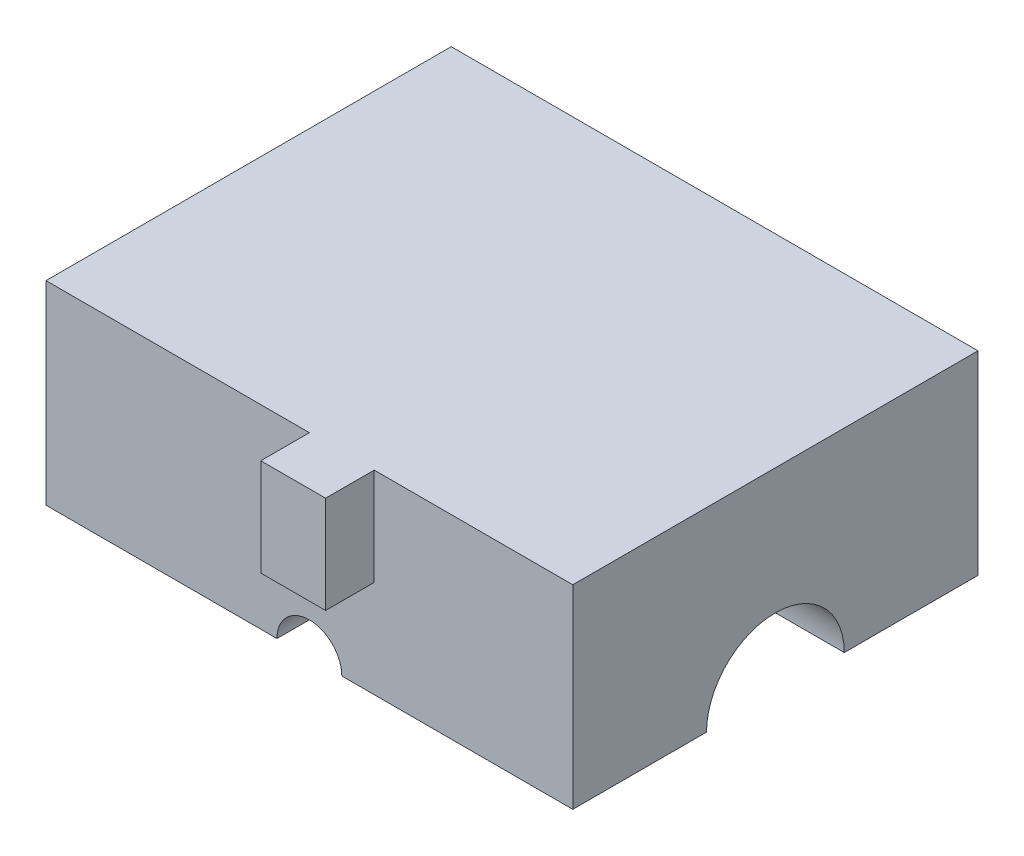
ISO-10303-21;
HEADER;
FILE_DESCRIPTION(('STEP AP214'),'2;1');
FILE_NAME('part.step','',(''),(''),'','','');
FILE_SCHEMA(('AUTOMOTIVE_DESIGN { 1 0 10303 214 1 1 1 1 }'));
ENDSEC;
DATA;
#1=APPLICATION_CONTEXT('core data for automotive mechanical design processes');
#2=APPLICATION_PROTOCOL_DEFINITION('international standard','automotive_design',2000,#1);
#3=PRODUCT_CONTEXT('',#1,'mechanical');
#4=PRODUCT('Part','Part','',(#3));
#5=PRODUCT_RELATED_PRODUCT_CATEGORY('part','',(#4));
#6=PRODUCT_DEFINITION_FORMATION('','',#4);
#7=PRODUCT_DEFINITION_CONTEXT('part definition',#1,'design');
#8=PRODUCT_DEFINITION('design','',#6,#7);
#9=PRODUCT_DEFINITION_SHAPE('','',#8);
#10=(LENGTH_UNIT() NAMED_UNIT(*) SI_UNIT(.MILLI.,.METRE.));
#11=(NAMED_UNIT(*) PLANE_ANGLE_UNIT() SI_UNIT($,.RADIAN.));
#12=(NAMED_UNIT(*) SI_UNIT($,.STERADIAN.) SOLID_ANGLE_UNIT());
#13=UNCERTAINTY_MEASURE_WITH_UNIT(LENGTH_MEASURE(1.E-05),#10,'distance_accuracy_value','');
#14=(GEOMETRIC_REPRESENTATION_CONTEXT(3) GLOBAL_UNCERTAINTY_ASSIGNED_CONTEXT((#13)) GLOBAL_UNIT_ASSIGNED_CONTEXT((#10,
#11,#12)) REPRESENTATION_CONTEXT('',''));
#15=CARTESIAN_POINT('',(0.,0.,0.));
#16=DIRECTION('',(0.,0.,1.));
#17=DIRECTION('',(1.,0.,0.));
#18=AXIS2_PLACEMENT_3D('',#15,#16,#17);
#19=CARTESIAN_POINT('',(-206.375,152.4,158.75));
#20=DIRECTION('',(0.,0.,-1.));
#21=DIRECTION('',(-1.,0.,0.));
#22=AXIS2_PLACEMENT_3D('',#19,#20,#21);
#23=PLANE('',#22);
#24=DIRECTION('',(0.,-1.,0.));
#25=VECTOR('',#24,1.);
#26=CARTESIAN_POINT('',(0.,152.4,158.75));
#27=LINE('',#26,#25);
#28=CARTESIAN_POINT('',(0.,152.4,158.75));
#29=VERTEX_POINT('',#28);
#30=CARTESIAN_POINT('',(0.,76.2,158.75));
#31=VERTEX_POINT('',#30);
#32=EDGE_CURVE('E194',#29,#31,#27,.T.);
#33=ORIENTED_EDGE('',*,*,#32,.F.);
#34=DIRECTION('',(1.,0.,0.));
#35=VECTOR('',#34,1.);
#36=CARTESIAN_POINT('',(-206.375,152.4,158.75));
#37=LINE('',#36,#35);
#38=CARTESIAN_POINT('',(-206.375,152.4,158.75));
#39=VERTEX_POINT('',#38);
#40=EDGE_CURVE('E246',#39,#29,#37,.T.);
#41=ORIENTED_EDGE('',*,*,#40,.F.);
#42=DIRECTION('',(0.,-1.,0.));
#43=VECTOR('',#42,1.);
#44=CARTESIAN_POINT('',(-206.375,152.4,158.75));
#45=LINE('',#44,#43);
#46=CARTESIAN_POINT('',(-206.375,0.,158.75));
#47=VERTEX_POINT('',#46);
#48=EDGE_CURVE('E412',#39,#47,#45,.T.);
#49=ORIENTED_EDGE('',*,*,#48,.T.);
#50=DIRECTION('',(1.,0.,0.));
#51=VECTOR('',#50,1.);
#52=CARTESIAN_POINT('',(-206.375,0.,158.75));
#53=LINE('',#52,#51);
#54=CARTESIAN_POINT('',(-25.4000000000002,0.,158.75));
#55=VERTEX_POINT('',#54);
#56=EDGE_CURVE('E434',#47,#55,#53,.T.);
#57=ORIENTED_EDGE('',*,*,#56,.T.);
#58=CARTESIAN_POINT('',(0.,0.,158.75));
#59=DIRECTION('',(0.,0.,1.));
#60=DIRECTION('',(1.,0.,0.));
#61=AXIS2_PLACEMENT_3D('',#58,#59,#60);
#62=CIRCLE('',#61,25.4000000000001);
#63=CARTESIAN_POINT('',(25.4,0.,158.75));
#64=VERTEX_POINT('',#63);
#65=EDGE_CURVE('E231',#64,#55,#62,.T.);
#66=ORIENTED_EDGE('',*,*,#65,.F.);
#67=CARTESIAN_POINT('',(206.375,0.,158.75));
#68=VERTEX_POINT('',#67);
#69=EDGE_CURVE('E437',#64,#68,#53,.T.);
#70=ORIENTED_EDGE('',*,*,#69,.T.);
#71=DIRECTION('',(0.,-1.,0.));
#72=VECTOR('',#71,1.);
#73=CARTESIAN_POINT('',(206.375,152.4,158.75));
#74=LINE('',#73,#72);
#75=CARTESIAN_POINT('',(206.375,152.4,158.75));
#76=VERTEX_POINT('',#75);
#77=EDGE_CURVE('E416',#76,#68,#74,.T.);
#78=ORIENTED_EDGE('',*,*,#77,.F.);
#79=CARTESIAN_POINT('',(50.8,152.4,158.75));
#80=VERTEX_POINT('',#79);
#81=EDGE_CURVE('E58',#80,#76,#37,.T.);
#82=ORIENTED_EDGE('',*,*,#81,.F.);
#83=DIRECTION('',(0.,1.,0.));
#84=VECTOR('',#83,1.);
#85=CARTESIAN_POINT('',(50.8,152.4,158.75));
#86=LINE('',#85,#84);
#87=CARTESIAN_POINT('',(50.8,76.2,158.75));
#88=VERTEX_POINT('',#87);
#89=EDGE_CURVE('E191',#88,#80,#86,.T.);
#90=ORIENTED_EDGE('',*,*,#89,.F.);
#91=DIRECTION('',(1.,0.,0.));
#92=VECTOR('',#91,1.);
#93=CARTESIAN_POINT('',(0.,76.2,158.75));
#94=LINE('',#93,#92);
#95=EDGE_CURVE('E52',#31,#88,#94,.T.);
#96=ORIENTED_EDGE('',*,*,#95,.F.);
#97=EDGE_LOOP('',(#33,#41,#49,#57,#66,#70,#78,#82,#90,#96));
#98=FACE_BOUND('',#97,.T.);
#99=ADVANCED_FACE('F35',(#98),#23,.F.);
#100=CARTESIAN_POINT('',(-206.375,0.,158.75));
#101=DIRECTION('',(0.,1.,0.));
#102=DIRECTION('',(0.,0.,1.));
#103=AXIS2_PLACEMENT_3D('',#100,#101,#102);
#104=PLANE('',#103);
#105=DIRECTION('',(1.,0.,0.));
#106=VECTOR('',#105,1.);
#107=CARTESIAN_POINT('',(-206.375,0.,53.975));
#108=LINE('',#107,#106);
#109=CARTESIAN_POINT('',(-206.375,0.,53.975));
#110=VERTEX_POINT('',#109);
#111=CARTESIAN_POINT('',(-101.6,0.,53.975));
#112=VERTEX_POINT('',#111);
#113=EDGE_CURVE('E213',#110,#112,#108,.T.);
#114=ORIENTED_EDGE('',*,*,#113,.T.);
#115=CARTESIAN_POINT('',(-101.6,0.,79.375));
#116=DIRECTION('',(0.,1.,0.));
#117=DIRECTION('',(0.,0.,1.));
#118=AXIS2_PLACEMENT_3D('',#115,#116,#117);
#119=CIRCLE('',#118,25.4);
#120=CARTESIAN_POINT('',(-76.2000000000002,0.,79.375));
#121=VERTEX_POINT('',#120);
#122=EDGE_CURVE('E11',#112,#121,#119,.F.);
#123=ORIENTED_EDGE('',*,*,#122,.T.);
#124=DIRECTION('',(0.,0.,1.));
#125=VECTOR('',#124,1.);
#126=CARTESIAN_POINT('',(-76.2000000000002,0.,190.334685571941));
#127=LINE('',#126,#125);
#128=CARTESIAN_POINT('',(-76.2000000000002,0.,95.25));
#129=VERTEX_POINT('',#128);
#130=EDGE_CURVE('E399',#121,#129,#127,.T.);
#131=ORIENTED_EDGE('',*,*,#130,.T.);
#132=DIRECTION('',(1.,0.,0.));
#133=VECTOR('',#132,1.);
#134=CARTESIAN_POINT('',(-206.375,0.,95.25));
#135=LINE('',#134,#133);
#136=CARTESIAN_POINT('',(-25.4000000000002,0.,95.25));
#137=VERTEX_POINT('',#136);
#138=EDGE_CURVE('E336',#129,#137,#135,.T.);
#139=ORIENTED_EDGE('',*,*,#138,.T.);
#140=DIRECTION('',(0.,0.,1.));
#141=VECTOR('',#140,1.);
#142=CARTESIAN_POINT('',(-25.4000000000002,0.,190.334685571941));
#143=LINE('',#142,#141);
#144=EDGE_CURVE('E332',#137,#55,#143,.T.);
#145=ORIENTED_EDGE('',*,*,#144,.T.);
#146=ORIENTED_EDGE('',*,*,#56,.F.);
#147=DIRECTION('',(0.,0.,1.));
#148=VECTOR('',#147,1.);
#149=CARTESIAN_POINT('',(-206.375,0.,-158.75));
#150=LINE('',#149,#148);
#151=EDGE_CURVE('E233',#110,#47,#150,.T.);
#152=ORIENTED_EDGE('',*,*,#151,.F.);
#153=EDGE_LOOP('',(#114,#123,#131,#139,#145,#146,#152));
#154=FACE_BOUND('',#153,.T.);
#155=ADVANCED_FACE('F324',(#154),#104,.F.);
#156=DIRECTION('',(0.,0.,1.));
#157=VECTOR('',#156,1.);
#158=CARTESIAN_POINT('',(76.2,0.,190.334685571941));
#159=LINE('',#158,#157);
#160=CARTESIAN_POINT('',(76.2,0.,95.25));
#161=VERTEX_POINT('',#160);
#162=CARTESIAN_POINT('',(76.2,0.,79.375));
#163=VERTEX_POINT('',#162);
#164=EDGE_CURVE('E390',#161,#163,#159,.F.);
#165=ORIENTED_EDGE('',*,*,#164,.T.);
#166=CARTESIAN_POINT('',(101.6,0.,79.375));
#167=DIRECTION('',(0.,1.,0.));
#168=DIRECTION('',(0.,0.,1.));
#169=AXIS2_PLACEMENT_3D('',#166,#167,#168);
#170=CIRCLE('',#169,25.4);
#171=CARTESIAN_POINT('',(101.6,0.,53.975));
#172=VERTEX_POINT('',#171);
#173=EDGE_CURVE('E313',#163,#172,#170,.F.);
#174=ORIENTED_EDGE('',*,*,#173,.T.);
#175=DIRECTION('',(1.,0.,0.));
#176=VECTOR('',#175,1.);
#177=CARTESIAN_POINT('',(-206.375,0.,53.975));
#178=LINE('',#177,#176);
#179=CARTESIAN_POINT('',(206.375,0.,53.975));
#180=VERTEX_POINT('',#179);
#181=EDGE_CURVE('E209',#172,#180,#178,.T.);
#182=ORIENTED_EDGE('',*,*,#181,.T.);
#183=DIRECTION('',(0.,0.,-1.));
#184=VECTOR('',#183,1.);
#185=CARTESIAN_POINT('',(206.375,0.,-158.75));
#186=LINE('',#185,#184);
#187=EDGE_CURVE('E430',#68,#180,#186,.T.);
#188=ORIENTED_EDGE('',*,*,#187,.F.);
#189=ORIENTED_EDGE('',*,*,#69,.F.);
#190=DIRECTION('',(0.,0.,1.));
#191=VECTOR('',#190,1.);
#192=CARTESIAN_POINT('',(25.4,0.,190.334685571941));
#193=LINE('',#192,#191);
#194=CARTESIAN_POINT('',(25.4,0.,95.25));
#195=VERTEX_POINT('',#194);
#196=EDGE_CURVE('E392',#64,#195,#193,.F.);
#197=ORIENTED_EDGE('',*,*,#196,.T.);
#198=EDGE_CURVE('E383',#195,#161,#135,.T.);
#199=ORIENTED_EDGE('',*,*,#198,.T.);
#200=EDGE_LOOP('',(#165,#174,#182,#188,#189,#197,#199));
#201=FACE_BOUND('',#200,.T.);
#202=ADVANCED_FACE('F389',(#201),#104,.F.);
#203=CARTESIAN_POINT('',(-76.2000000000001,0.,-95.25));
#204=VERTEX_POINT('',#203);
#205=CARTESIAN_POINT('',(-76.2000000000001,0.,-79.375));
#206=VERTEX_POINT('',#205);
#207=EDGE_CURVE('E398',#204,#206,#127,.T.);
#208=ORIENTED_EDGE('',*,*,#207,.T.);
#209=CARTESIAN_POINT('',(-101.6,0.,-79.375));
#210=DIRECTION('',(0.,1.,0.));
#211=DIRECTION('',(0.,0.,1.));
#212=AXIS2_PLACEMENT_3D('',#209,#210,#211);
#213=CIRCLE('',#212,25.4);
#214=CARTESIAN_POINT('',(-101.6,0.,-53.975));
#215=VERTEX_POINT('',#214);
#216=EDGE_CURVE('E315',#206,#215,#213,.F.);
#217=ORIENTED_EDGE('',*,*,#216,.T.);
#218=DIRECTION('',(1.,0.,0.));
#219=VECTOR('',#218,1.);
#220=CARTESIAN_POINT('',(-206.375,0.,-53.975));
#221=LINE('',#220,#219);
#222=CARTESIAN_POINT('',(-206.375,0.,-53.975));
#223=VERTEX_POINT('',#222);
#224=EDGE_CURVE('E211',#215,#223,#221,.F.);
#225=ORIENTED_EDGE('',*,*,#224,.T.);
#226=CARTESIAN_POINT('',(-206.375,0.,-158.75));
#227=VERTEX_POINT('',#226);
#228=EDGE_CURVE('E438',#227,#223,#150,.T.);
#229=ORIENTED_EDGE('',*,*,#228,.F.);
#230=DIRECTION('',(-1.,0.,0.));
#231=VECTOR('',#230,1.);
#232=CARTESIAN_POINT('',(-206.375,0.,-158.75));
#233=LINE('',#232,#231);
#234=CARTESIAN_POINT('',(-25.4,0.,-158.75));
#235=VERTEX_POINT('',#234);
#236=EDGE_CURVE('E429',#235,#227,#233,.T.);
#237=ORIENTED_EDGE('',*,*,#236,.F.);
#238=DIRECTION('',(0.,0.,1.));
#239=VECTOR('',#238,1.);
#240=CARTESIAN_POINT('',(-25.4000000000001,0.,190.334685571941));
#241=LINE('',#240,#239);
#242=CARTESIAN_POINT('',(-25.4000000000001,0.,-95.25));
#243=VERTEX_POINT('',#242);
#244=EDGE_CURVE('E394',#235,#243,#241,.T.);
#245=ORIENTED_EDGE('',*,*,#244,.T.);
#246=DIRECTION('',(-1.,0.,0.));
#247=VECTOR('',#246,1.);
#248=CARTESIAN_POINT('',(-206.375,0.,-95.25));
#249=LINE('',#248,#247);
#250=EDGE_CURVE('E401',#243,#204,#249,.T.);
#251=ORIENTED_EDGE('',*,*,#250,.T.);
#252=EDGE_LOOP('',(#208,#217,#225,#229,#237,#245,#251));
#253=FACE_BOUND('',#252,.T.);
#254=ADVANCED_FACE('F351',(#253),#104,.F.);
#255=CARTESIAN_POINT('',(-206.375,152.4,-158.75));
#256=DIRECTION('',(1.,0.,0.));
#257=DIRECTION('',(0.,0.,-1.));
#258=AXIS2_PLACEMENT_3D('',#255,#256,#257);
#259=PLANE('',#258);
#260=ORIENTED_EDGE('',*,*,#228,.T.);
#261=CARTESIAN_POINT('',(-206.375,0.,0.));
#262=DIRECTION('',(1.,0.,0.));
#263=DIRECTION('',(0.,0.,-1.));
#264=AXIS2_PLACEMENT_3D('',#261,#262,#263);
#265=CIRCLE('',#264,53.975);
#266=EDGE_CURVE('E198',#223,#110,#265,.T.);
#267=ORIENTED_EDGE('',*,*,#266,.T.);
#268=ORIENTED_EDGE('',*,*,#151,.T.);
#269=ORIENTED_EDGE('',*,*,#48,.F.);
#270=DIRECTION('',(0.,0.,1.));
#271=VECTOR('',#270,1.);
#272=CARTESIAN_POINT('',(-206.375,152.4,-158.75));
#273=LINE('',#272,#271);
#274=CARTESIAN_POINT('',(-206.375,152.4,-158.75));
#275=VERTEX_POINT('',#274);
#276=EDGE_CURVE('E234',#275,#39,#273,.T.);
#277=ORIENTED_EDGE('',*,*,#276,.F.);
#278=DIRECTION('',(0.,-1.,0.));
#279=VECTOR('',#278,1.);
#280=CARTESIAN_POINT('',(-206.375,152.4,-158.75));
#281=LINE('',#280,#279);
#282=EDGE_CURVE('E424',#275,#227,#281,.T.);
#283=ORIENTED_EDGE('',*,*,#282,.T.);
#284=EDGE_LOOP('',(#260,#267,#268,#269,#277,#283));
#285=FACE_BOUND('',#284,.T.);
#286=ADVANCED_FACE('F347',(#285),#259,.F.);
#287=CARTESIAN_POINT('',(206.375,152.4,-158.75));
#288=DIRECTION('',(-1.,0.,0.));
#289=DIRECTION('',(0.,0.,1.));
#290=AXIS2_PLACEMENT_3D('',#287,#288,#289);
#291=PLANE('',#290);
#292=ORIENTED_EDGE('',*,*,#187,.T.);
#293=CARTESIAN_POINT('',(206.375,0.,0.));
#294=DIRECTION('',(1.,0.,0.));
#295=DIRECTION('',(0.,0.,-1.));
#296=AXIS2_PLACEMENT_3D('',#293,#294,#295);
#297=CIRCLE('',#296,53.975);
#298=CARTESIAN_POINT('',(206.375,0.,-53.975));
#299=VERTEX_POINT('',#298);
#300=EDGE_CURVE('E195',#299,#180,#297,.T.);
#301=ORIENTED_EDGE('',*,*,#300,.F.);
#302=CARTESIAN_POINT('',(206.375,0.,-158.75));
#303=VERTEX_POINT('',#302);
#304=EDGE_CURVE('E433',#299,#303,#186,.T.);
#305=ORIENTED_EDGE('',*,*,#304,.T.);
#306=DIRECTION('',(0.,-1.,0.));
#307=VECTOR('',#306,1.);
#308=CARTESIAN_POINT('',(206.375,152.4,-158.75));
#309=LINE('',#308,#307);
#310=CARTESIAN_POINT('',(206.375,152.4,-158.75));
#311=VERTEX_POINT('',#310);
#312=EDGE_CURVE('E421',#311,#303,#309,.T.);
#313=ORIENTED_EDGE('',*,*,#312,.F.);
#314=DIRECTION('',(0.,0.,-1.));
#315=VECTOR('',#314,1.);
#316=CARTESIAN_POINT('',(206.375,152.4,-158.75));
#317=LINE('',#316,#315);
#318=EDGE_CURVE('E240',#76,#311,#317,.T.);
#319=ORIENTED_EDGE('',*,*,#318,.F.);
#320=ORIENTED_EDGE('',*,*,#77,.T.);
#321=EDGE_LOOP('',(#292,#301,#305,#313,#319,#320));
#322=FACE_BOUND('',#321,.T.);
#323=ADVANCED_FACE('F350',(#322),#291,.F.);
#324=CARTESIAN_POINT('',(-206.375,152.4,-158.75));
#325=DIRECTION('',(0.,0.,1.));
#326=DIRECTION('',(1.,0.,0.));
#327=AXIS2_PLACEMENT_3D('',#324,#325,#326);
#328=PLANE('',#327);
#329=CARTESIAN_POINT('',(25.4,0.,-158.75));
#330=VERTEX_POINT('',#329);
#331=EDGE_CURVE('E237',#303,#330,#233,.T.);
#332=ORIENTED_EDGE('',*,*,#331,.T.);
#333=CARTESIAN_POINT('',(0.,0.,-158.75));
#334=DIRECTION('',(0.,0.,1.));
#335=DIRECTION('',(1.,0.,0.));
#336=AXIS2_PLACEMENT_3D('',#333,#334,#335);
#337=CIRCLE('',#336,25.4);
#338=EDGE_CURVE('E216',#330,#235,#337,.T.);
#339=ORIENTED_EDGE('',*,*,#338,.T.);
#340=ORIENTED_EDGE('',*,*,#236,.T.);
#341=ORIENTED_EDGE('',*,*,#282,.F.);
#342=DIRECTION('',(-1.,0.,0.));
#343=VECTOR('',#342,1.);
#344=CARTESIAN_POINT('',(-206.375,152.4,-158.75));
#345=LINE('',#344,#343);
#346=EDGE_CURVE('E427',#311,#275,#345,.T.);
#347=ORIENTED_EDGE('',*,*,#346,.F.);
#348=ORIENTED_EDGE('',*,*,#312,.T.);
#349=EDGE_LOOP('',(#332,#339,#340,#341,#347,#348));
#350=FACE_BOUND('',#349,.T.);
#351=ADVANCED_FACE('F357',(#350),#328,.F.);
#352=CARTESIAN_POINT('',(-206.375,152.4,158.75));
#353=DIRECTION('',(0.,1.,0.));
#354=DIRECTION('',(0.,0.,1.));
#355=AXIS2_PLACEMENT_3D('',#352,#353,#354);
#356=PLANE('',#355);
#357=ORIENTED_EDGE('',*,*,#276,.T.);
#358=ORIENTED_EDGE('',*,*,#40,.T.);
#359=DIRECTION('',(0.,0.,-1.));
#360=VECTOR('',#359,1.);
#361=CARTESIAN_POINT('',(0.,152.4,196.85));
#362=LINE('',#361,#360);
#363=CARTESIAN_POINT('',(0.,152.4,196.85));
#364=VERTEX_POINT('',#363);
#365=EDGE_CURVE('E450',#364,#29,#362,.T.);
#366=ORIENTED_EDGE('',*,*,#365,.F.);
#367=DIRECTION('',(-1.,0.,0.));
#368=VECTOR('',#367,1.);
#369=CARTESIAN_POINT('',(0.,152.4,196.85));
#370=LINE('',#369,#368);
#371=CARTESIAN_POINT('',(50.8,152.4,196.85));
#372=VERTEX_POINT('',#371);
#373=EDGE_CURVE('E187',#372,#364,#370,.T.);
#374=ORIENTED_EDGE('',*,*,#373,.F.);
#375=DIRECTION('',(0.,0.,-1.));
#376=VECTOR('',#375,1.);
#377=CARTESIAN_POINT('',(50.8,152.4,196.85));
#378=LINE('',#377,#376);
#379=EDGE_CURVE('E200',#372,#80,#378,.T.);
#380=ORIENTED_EDGE('',*,*,#379,.T.);
#381=ORIENTED_EDGE('',*,*,#81,.T.);
#382=ORIENTED_EDGE('',*,*,#318,.T.);
#383=ORIENTED_EDGE('',*,*,#346,.T.);
#384=EDGE_LOOP('',(#357,#358,#366,#374,#380,#381,#382,#383));
#385=FACE_BOUND('',#384,.T.);
#386=ADVANCED_FACE('F361',(#385),#356,.T.);
#387=DIRECTION('',(1.,0.,0.));
#388=VECTOR('',#387,1.);
#389=CARTESIAN_POINT('',(-206.375,0.,-53.975));
#390=LINE('',#389,#388);
#391=CARTESIAN_POINT('',(101.6,0.,-53.975));
#392=VERTEX_POINT('',#391);
#393=EDGE_CURVE('E206',#299,#392,#390,.F.);
#394=ORIENTED_EDGE('',*,*,#393,.T.);
#395=CARTESIAN_POINT('',(101.6,0.,-79.375));
#396=DIRECTION('',(0.,1.,0.));
#397=DIRECTION('',(0.,0.,1.));
#398=AXIS2_PLACEMENT_3D('',#395,#396,#397);
#399=CIRCLE('',#398,25.4);
#400=CARTESIAN_POINT('',(76.2000000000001,0.,-79.375));
#401=VERTEX_POINT('',#400);
#402=EDGE_CURVE('E312',#392,#401,#399,.F.);
#403=ORIENTED_EDGE('',*,*,#402,.T.);
#404=CARTESIAN_POINT('',(76.2,0.,-95.25));
#405=VERTEX_POINT('',#404);
#406=EDGE_CURVE('E396',#401,#405,#159,.F.);
#407=ORIENTED_EDGE('',*,*,#406,.T.);
#408=CARTESIAN_POINT('',(25.4,0.,-95.25));
#409=VERTEX_POINT('',#408);
#410=EDGE_CURVE('E406',#405,#409,#249,.T.);
#411=ORIENTED_EDGE('',*,*,#410,.T.);
#412=DIRECTION('',(0.,0.,1.));
#413=VECTOR('',#412,1.);
#414=CARTESIAN_POINT('',(25.4,0.,190.334685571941));
#415=LINE('',#414,#413);
#416=EDGE_CURVE('E409',#409,#330,#415,.F.);
#417=ORIENTED_EDGE('',*,*,#416,.T.);
#418=ORIENTED_EDGE('',*,*,#331,.F.);
#419=ORIENTED_EDGE('',*,*,#304,.F.);
#420=EDGE_LOOP('',(#394,#403,#407,#411,#417,#418,#419));
#421=FACE_BOUND('',#420,.T.);
#422=ADVANCED_FACE('F363',(#421),#104,.F.);
#423=CARTESIAN_POINT('',(0.,0.,190.334685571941));
#424=DIRECTION('',(0.,0.,1.));
#425=DIRECTION('',(1.,0.,0.));
#426=AXIS2_PLACEMENT_3D('',#423,#424,#425);
#427=CYLINDRICAL_SURFACE('',#426,25.4000000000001);
#428=CARTESIAN_POINT('',(0.,0.,95.25));
#429=DIRECTION('',(0.,0.,1.));
#430=DIRECTION('',(1.,0.,0.));
#431=AXIS2_PLACEMENT_3D('',#428,#429,#430);
#432=CIRCLE('',#431,25.4000000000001);
#433=EDGE_CURVE('E228',#195,#137,#432,.T.);
#434=ORIENTED_EDGE('',*,*,#433,.F.);
#435=ORIENTED_EDGE('',*,*,#196,.F.);
#436=ORIENTED_EDGE('',*,*,#65,.T.);
#437=ORIENTED_EDGE('',*,*,#144,.F.);
#438=EDGE_LOOP('',(#434,#435,#436,#437));
#439=FACE_BOUND('',#438,.T.);
#440=ADVANCED_FACE('F366',(#439),#427,.F.);
#441=CARTESIAN_POINT('',(25.4,0.,95.25));
#442=DIRECTION('',(0.,0.,1.));
#443=DIRECTION('',(1.,0.,0.));
#444=AXIS2_PLACEMENT_3D('',#441,#442,#443);
#445=PLANE('',#444);
#446=CARTESIAN_POINT('',(0.,0.,95.25));
#447=DIRECTION('',(0.,0.,1.));
#448=DIRECTION('',(1.,0.,0.));
#449=AXIS2_PLACEMENT_3D('',#446,#447,#448);
#450=CIRCLE('',#449,76.2000000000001);
#451=EDGE_CURVE('E225',#161,#129,#450,.T.);
#452=ORIENTED_EDGE('',*,*,#451,.F.);
#453=ORIENTED_EDGE('',*,*,#198,.F.);
#454=ORIENTED_EDGE('',*,*,#433,.T.);
#455=ORIENTED_EDGE('',*,*,#138,.F.);
#456=EDGE_LOOP('',(#452,#453,#454,#455));
#457=FACE_BOUND('',#456,.T.);
#458=ADVANCED_FACE('F372',(#457),#445,.F.);
#459=CARTESIAN_POINT('',(0.,0.,190.334685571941));
#460=DIRECTION('',(0.,0.,1.));
#461=DIRECTION('',(1.,0.,0.));
#462=AXIS2_PLACEMENT_3D('',#459,#460,#461);
#463=CYLINDRICAL_SURFACE('',#462,76.2000000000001);
#464=ORIENTED_EDGE('',*,*,#406,.F.);
#465=CARTESIAN_POINT('',(92.491618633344,-28.591234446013,-45.7803662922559));
#466=CARTESIAN_POINT('',(73.5262170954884,-22.3888757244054,-49.6539284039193));
#467=CARTESIAN_POINT('',(69.368713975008,-31.534449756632,-67.3240680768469));
#468=CARTESIAN_POINT('',(92.8574069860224,-28.0440709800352,-46.1220805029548));
#469=CARTESIAN_POINT('',(73.6870678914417,-21.8231532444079,-49.9038442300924));
#470=CARTESIAN_POINT('',(69.6430552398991,-30.930960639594,-67.8265889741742));
#471=CARTESIAN_POINT('',(93.2156983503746,-27.4891648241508,-46.4550049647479));
#472=CARTESIAN_POINT('',(73.8389313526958,-21.2603682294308,-50.1397328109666));
#473=CARTESIAN_POINT('',(69.9117737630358,-30.3189317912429,-68.3161837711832));
#474=CARTESIAN_POINT('',(93.915924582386,-26.3640691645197,-47.1026333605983));
#475=CARTESIAN_POINT('',(74.1261849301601,-20.1383269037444,-50.5862541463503));
#476=CARTESIAN_POINT('',(70.4369434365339,-29.0780174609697,-69.2685784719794));
#477=CARTESIAN_POINT('',(94.2578576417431,-25.7938779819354,-47.4173352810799));
#478=CARTESIAN_POINT('',(74.2614351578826,-19.5791937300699,-50.7966718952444));
#479=CARTESIAN_POINT('',(70.6933932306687,-28.4491301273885,-69.7313754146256));
#480=CARTESIAN_POINT('',(95.2574242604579,-24.0600520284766,-48.3334640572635));
#481=CARTESIAN_POINT('',(74.6440601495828,-17.9037596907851,-51.3932360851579));
#482=CARTESIAN_POINT('',(71.4430681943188,-26.5368220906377,-71.0786236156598));
#483=CARTESIAN_POINT('',(95.888307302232,-22.8739344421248,-48.9064318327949));
#484=CARTESIAN_POINT('',(74.8646967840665,-16.8023870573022,-51.7391004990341));
#485=CARTESIAN_POINT('',(71.9162304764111,-25.2286041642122,-71.9212232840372));
#486=CARTESIAN_POINT('',(97.0697278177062,-20.4407139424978,-49.9725031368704));
#487=CARTESIAN_POINT('',(75.2459072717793,-14.6307172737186,-52.3424484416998));
#488=CARTESIAN_POINT('',(72.8022958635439,-22.5449050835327,-73.4889752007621));
#489=CARTESIAN_POINT('',(97.6198461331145,-19.1933348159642,-50.4651913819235));
#490=CARTESIAN_POINT('',(75.405124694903,-13.5625889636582,-52.5979045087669));
#491=CARTESIAN_POINT('',(73.2148845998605,-21.1691192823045,-74.2135167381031));
#492=CARTESIAN_POINT('',(98.6245555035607,-16.649663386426,-51.3605518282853));
#493=CARTESIAN_POINT('',(75.6701999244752,-11.4736303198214,-53.0301550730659));
#494=CARTESIAN_POINT('',(73.9684166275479,-18.3635993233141,-75.5302232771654));
#495=CARTESIAN_POINT('',(99.0791743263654,-15.3533854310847,-51.7632501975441));
#496=CARTESIAN_POINT('',(75.7752299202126,-10.4551883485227,-53.2056922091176));
#497=CARTESIAN_POINT('',(74.3093807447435,-16.9338809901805,-76.1224267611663));
#498=CARTESIAN_POINT('',(99.8852311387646,-12.7118012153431,-52.4746885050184));
#499=CARTESIAN_POINT('',(75.9437391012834,-8.46246198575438,-53.4939712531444));
#500=CARTESIAN_POINT('',(74.9139233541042,-14.0203689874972,-77.1686595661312));
#501=CARTESIAN_POINT('',(100.236020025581,-11.3662432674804,-52.7828377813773));
#502=CARTESIAN_POINT('',(76.0063574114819,-7.49129795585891,-53.6053712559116));
#503=CARTESIAN_POINT('',(75.1770150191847,-12.5362977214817,-77.6218202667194));
#504=CARTESIAN_POINT('',(100.821944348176,-8.64396228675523,-53.2963504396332));
#505=CARTESIAN_POINT('',(76.1014822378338,-5.59395783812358,-53.7794483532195));
#506=CARTESIAN_POINT('',(75.6164582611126,-9.53378193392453,-78.376985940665));
#507=CARTESIAN_POINT('',(101.05706976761,-7.26723656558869,-53.5017049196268));
#508=CARTESIAN_POINT('',(76.133642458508,-4.67066250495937,-53.8415379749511));
#509=CARTESIAN_POINT('',(75.7928023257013,-8.01533444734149,-78.6789778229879));
#510=CARTESIAN_POINT('',(101.404833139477,-4.49927706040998,-53.8051060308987));
#511=CARTESIAN_POINT('',(76.1783722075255,-2.85671139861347,-53.9298681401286));
#512=CARTESIAN_POINT('',(76.0536248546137,-4.9624379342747,-79.125155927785));
#513=CARTESIAN_POINT('',(101.517853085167,-3.10810234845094,-53.9034873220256));
#514=CARTESIAN_POINT('',(76.1908522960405,-1.9687813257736,-53.9559354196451));
#515=CARTESIAN_POINT('',(76.1383898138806,-3.42805406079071,-79.2698342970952));
#516=CARTESIAN_POINT('',(101.619588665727,-0.320322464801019,-53.9920566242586));
#517=CARTESIAN_POINT('',(76.2022235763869,-0.200324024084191,-53.9796030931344));
#518=CARTESIAN_POINT('',(76.2146914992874,-0.353296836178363,-79.4000832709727));
#519=CARTESIAN_POINT('',(101.60832146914,1.07628193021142,-53.9822595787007));
#520=CARTESIAN_POINT('',(76.2010814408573,0.677426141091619,-53.9771339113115));
#521=CARTESIAN_POINT('',(76.2062411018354,1.18707565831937,-79.3856758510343));
#522=CARTESIAN_POINT('',(101.470989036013,3.68845900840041,-53.8626727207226));
#523=CARTESIAN_POINT('',(76.1854742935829,2.34017367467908,-53.944857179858));
#524=CARTESIAN_POINT('',(76.1032417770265,4.06815331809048,-79.2098128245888));
#525=CARTESIAN_POINT('',(101.359343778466,4.90498886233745,-53.7654429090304));
#526=CARTESIAN_POINT('',(76.1727183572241,3.12099612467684,-53.9185589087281));
#527=CARTESIAN_POINT('',(76.0195078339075,5.40991418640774,-79.0668278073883));
#528=CARTESIAN_POINT('',(101.043402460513,7.32307348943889,-53.4897527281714));
#529=CARTESIAN_POINT('',(76.1316310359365,4.71006684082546,-53.8377374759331));
#530=CARTESIAN_POINT('',(75.7825518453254,8.0769192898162,-78.6614010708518));
#531=CARTESIAN_POINT('',(100.839114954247,8.52462963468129,-53.3112998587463));
#532=CARTESIAN_POINT('',(76.1034082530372,5.51641435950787,-53.7834182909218));
#533=CARTESIAN_POINT('',(75.6293362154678,9.40216503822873,-78.3989703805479));
#534=CARTESIAN_POINT('',(100.341787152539,10.905823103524,-52.8756108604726));
#535=CARTESIAN_POINT('',(76.0241081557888,7.16756674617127,-53.6375128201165));
#536=CARTESIAN_POINT('',(75.2563403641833,12.0284813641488,-77.7582512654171));
#537=CARTESIAN_POINT('',(100.048665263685,12.0854392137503,-52.6183023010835));
#538=CARTESIAN_POINT('',(75.9732281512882,8.01049429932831,-53.5462651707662));
#539=CARTESIAN_POINT('',(75.0364989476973,13.3295285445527,-77.3798563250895));
#540=CARTESIAN_POINT('',(99.3793515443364,14.4145552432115,-52.0284979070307));
#541=CARTESIAN_POINT('',(75.8400372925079,9.73880139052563,-53.3156800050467));
#542=CARTESIAN_POINT('',(74.5345136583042,15.8984065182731,-76.5124969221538));
#543=CARTESIAN_POINT('',(99.0031559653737,15.5640538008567,-51.6959986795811));
#544=CARTESIAN_POINT('',(75.7580895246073,10.6223172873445,-53.1769217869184));
#545=CARTESIAN_POINT('',(74.2523669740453,17.1662358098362,-76.0235274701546));
#546=CARTESIAN_POINT('',(98.1684156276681,17.8433433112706,-50.9546156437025));
#547=CARTESIAN_POINT('',(75.5530126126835,12.4437048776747,-52.8380620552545));
#548=CARTESIAN_POINT('',(73.6263117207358,19.6801580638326,-74.9332582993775));
#549=CARTESIAN_POINT('',(97.7087548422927,18.9726060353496,-50.5446931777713));
#550=CARTESIAN_POINT('',(75.4298284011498,13.380527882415,-52.6379026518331));
#551=CARTESIAN_POINT('',(73.2815661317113,20.9256684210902,-74.3304311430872));
#552=CARTESIAN_POINT('',(96.7186764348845,21.1889444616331,-49.6563665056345));
#553=CARTESIAN_POINT('',(75.1355209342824,15.2905676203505,-52.1670550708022));
#554=CARTESIAN_POINT('',(72.5390073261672,23.3701593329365,-73.0240683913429));
#555=CARTESIAN_POINT('',(96.1882590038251,22.2760202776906,-49.1779624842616));
#556=CARTESIAN_POINT('',(74.9650830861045,16.2622633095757,-51.8973977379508));
#557=CARTESIAN_POINT('',(72.1411942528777,24.5691400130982,-72.3205330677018));
#558=CARTESIAN_POINT('',(95.0650533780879,24.4039391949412,-48.157456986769));
#559=CARTESIAN_POINT('',(74.5716833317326,18.2320280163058,-51.2801021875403));
#560=CARTESIAN_POINT('',(71.2987900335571,26.9161094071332,-70.8197896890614));
#561=CARTESIAN_POINT('',(94.4722789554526,25.4447924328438,-47.6153695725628));
#562=CARTESIAN_POINT('',(74.3495087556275,19.2289233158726,-50.9336474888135));
#563=CARTESIAN_POINT('',(70.854209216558,28.064109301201,-70.0226023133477));
#564=CARTESIAN_POINT('',(93.2325619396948,27.4779641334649,-46.4717407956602));
#565=CARTESIAN_POINT('',(73.8505860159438,21.2377584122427,-50.1576905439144));
#566=CARTESIAN_POINT('',(69.9244214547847,30.3065780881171,-68.3407952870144));
#567=CARTESIAN_POINT('',(92.5856120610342,28.4702760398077,-45.8701914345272));
#568=CARTESIAN_POINT('',(73.5746315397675,22.2489317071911,-49.7294009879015));
#569=CARTESIAN_POINT('',(69.4392090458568,31.4010397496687,-67.4561638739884));
#570=CARTESIAN_POINT('',(91.5267202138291,29.9991341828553,-44.875407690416));
#571=CARTESIAN_POINT('',(73.0945180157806,23.8536938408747,-48.9827771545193));
#572=CARTESIAN_POINT('',(68.6450401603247,33.0872803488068,-65.9932466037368));
#573=CARTESIAN_POINT('',(91.1298137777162,30.5525271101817,-44.5004254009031));
#574=CARTESIAN_POINT('',(72.9096114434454,24.4423165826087,-48.6949486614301));
#575=CARTESIAN_POINT('',(68.3473603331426,33.6976401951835,-65.4418020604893));
#576=CARTESIAN_POINT('',(90.322352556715,31.6418332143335,-43.7325845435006));
#577=CARTESIAN_POINT('',(72.5222809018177,25.6178073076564,-48.090526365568));
#578=CARTESIAN_POINT('',(67.741764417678,34.8990807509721,-64.3126243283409));
#579=CARTESIAN_POINT('',(89.9118004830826,32.1777498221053,-43.3397295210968));
#580=CARTESIAN_POINT('',(72.3199999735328,26.2046451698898,-47.7741662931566));
#581=CARTESIAN_POINT('',(67.4338503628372,35.4901652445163,-63.7348963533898));
#582=CARTESIAN_POINT('',(88.6619076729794,33.7592674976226,-42.1351290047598));
#583=CARTESIAN_POINT('',(71.6899553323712,27.9532572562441,-46.7852016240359));
#584=CARTESIAN_POINT('',(66.4964307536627,37.2344862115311,-61.9634250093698));
#585=CARTESIAN_POINT('',(87.8043460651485,34.7786138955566,-41.2973627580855));
#586=CARTESIAN_POINT('',(71.235229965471,29.1157249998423,-46.0669090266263));
#587=CARTESIAN_POINT('',(65.8532595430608,38.3587653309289,-60.7314158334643));
#588=CARTESIAN_POINT('',(86.0531485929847,36.7469512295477,-39.5561840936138));
#589=CARTESIAN_POINT('',(70.2649303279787,31.4093272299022,-44.5146833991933));
#590=CARTESIAN_POINT('',(64.5398614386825,40.5297256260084,-58.1708589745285));
#591=CARTESIAN_POINT('',(85.1594641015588,37.6958420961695,-38.652681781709));
#592=CARTESIAN_POINT('',(69.7500201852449,32.5410823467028,-43.6820416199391));
#593=CARTESIAN_POINT('',(63.8695980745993,41.5762964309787,-56.8421790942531));
#594=CARTESIAN_POINT('',(83.3505859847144,39.5211536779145,-36.7842989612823));
#595=CARTESIAN_POINT('',(68.670507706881,34.7566984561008,-41.9048955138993));
#596=CARTESIAN_POINT('',(62.5129394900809,43.589507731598,-54.0945572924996));
#597=CARTESIAN_POINT('',(82.4353914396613,40.3975712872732,-35.8194158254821));
#598=CARTESIAN_POINT('',(68.106356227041,35.8416247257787,-40.9615325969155));
#599=CARTESIAN_POINT('',(61.8265435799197,44.5561448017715,-52.6756115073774));
#600=CARTESIAN_POINT('',(80.9598674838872,41.7463032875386,-34.2223501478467));
#601=CARTESIAN_POINT('',(67.1685845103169,37.5392568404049,-39.3556387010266));
#602=CARTESIAN_POINT('',(60.7199006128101,46.043716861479,-50.3269855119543));
#603=CARTESIAN_POINT('',(80.4016698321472,42.2418785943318,-33.6087251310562));
#604=CARTESIAN_POINT('',(66.8088507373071,38.167553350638,-38.7314269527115));
#605=CARTESIAN_POINT('',(60.30125237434,46.5903072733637,-49.4245957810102));
#606=CARTESIAN_POINT('',(79.2861656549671,43.2058380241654,-32.3601328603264));
#607=CARTESIAN_POINT('',(66.0792917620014,39.3992289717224,-37.4442542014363));
#608=CARTESIAN_POINT('',(59.4646242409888,47.6534978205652,-47.588430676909));
#609=CARTESIAN_POINT('',(78.7288590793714,43.6742237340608,-31.7251668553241));
#610=CARTESIAN_POINT('',(65.7094513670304,40.0029449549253,-36.7814217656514));
#611=CARTESIAN_POINT('',(59.046644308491,48.1700997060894,-46.6546571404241));
#612=CARTESIAN_POINT('',(77.6185992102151,44.5836788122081,-30.4338641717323));
#613=CARTESIAN_POINT('',(64.9630740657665,41.1832011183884,-35.4174996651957));
#614=CARTESIAN_POINT('',(58.2139494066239,49.1731751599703,-44.7556826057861));
#615=CARTESIAN_POINT('',(77.0656474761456,45.0247387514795,-29.7775202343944));
#616=CARTESIAN_POINT('',(64.5864748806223,41.7600921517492,-34.7164700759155));
#617=CARTESIAN_POINT('',(57.7992356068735,49.6596383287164,-43.790470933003));
#618=CARTESIAN_POINT('',(75.9682584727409,45.8789869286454,-28.4437401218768));
#619=CARTESIAN_POINT('',(63.8305756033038,42.8841052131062,-33.2770434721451));
#620=CARTESIAN_POINT('',(56.9761938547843,50.6018238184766,-41.8290295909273));
#621=CARTESIAN_POINT('',(75.4238210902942,46.2921755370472,-27.7663042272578));
#622=CARTESIAN_POINT('',(63.4511750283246,43.4316019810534,-32.5386700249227));
#623=CARTESIAN_POINT('',(56.5678658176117,51.0575465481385,-40.8328003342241));
#624=CARTESIAN_POINT('',(74.3476928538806,47.0902554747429,-26.3901734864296));
#625=CARTESIAN_POINT('',(62.6938232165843,44.4945948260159,-31.0250275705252));
#626=CARTESIAN_POINT('',(55.7607696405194,51.9377817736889,-38.8090786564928));
#627=CARTESIAN_POINT('',(73.8160045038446,47.4751412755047,-25.6914745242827));
#628=CARTESIAN_POINT('',(62.3157317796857,45.0104697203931,-30.2497200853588));
#629=CARTESIAN_POINT('',(55.3620033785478,52.3622881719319,-37.7815801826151));
#630=CARTESIAN_POINT('',(72.7702739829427,48.2158710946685,-24.272839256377));
#631=CARTESIAN_POINT('',(61.5657040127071,46.0077424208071,-28.6629291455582));
#632=CARTESIAN_POINT('',(54.5777054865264,53.1792695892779,-35.6953518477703));
#633=CARTESIAN_POINT('',(72.2562323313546,48.5717142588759,-23.5529023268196));
#634=CARTESIAN_POINT('',(61.1935909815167,46.4895283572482,-27.8513584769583));
#635=CARTESIAN_POINT('',(54.1921742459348,53.5717436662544,-34.6366210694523));
#636=CARTESIAN_POINT('',(71.251332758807,49.253367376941,-22.0919867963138));
#637=CARTESIAN_POINT('',(60.4607611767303,47.4159679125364,-26.1930053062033));
#638=CARTESIAN_POINT('',(53.4384995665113,54.3235669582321,-32.488215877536));
#639=CARTESIAN_POINT('',(70.7604660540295,49.5791887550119,-21.3510163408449));
#640=CARTESIAN_POINT('',(60.0998311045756,47.8610228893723,-25.3460936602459));
#641=CARTESIAN_POINT('',(53.0703495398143,54.6829287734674,-31.3985534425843));
#642=CARTESIAN_POINT('',(69.8077201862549,50.1998345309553,-19.8478794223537));
#643=CARTESIAN_POINT('',(59.3948751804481,48.7115207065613,-23.6177047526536));
#644=CARTESIAN_POINT('',(52.3557901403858,55.3674645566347,-29.188057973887));
#645=CARTESIAN_POINT('',(69.3458382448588,50.4946619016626,-19.0857150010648));
#646=CARTESIAN_POINT('',(59.0506095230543,49.1173499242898,-22.7360234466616));
#647=CARTESIAN_POINT('',(52.0093786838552,55.6926418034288,-28.0672279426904));
#648=CARTESIAN_POINT('',(68.2456478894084,51.1850208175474,-17.1716727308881));
#649=CARTESIAN_POINT('',(58.2271161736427,50.0691223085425,-20.5127914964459));
#650=CARTESIAN_POINT('',(51.1842359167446,56.4540670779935,-25.2524598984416));
#651=CARTESIAN_POINT('',(67.6282154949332,51.5615475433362,-16.0072393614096));
#652=CARTESIAN_POINT('',(57.7598014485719,50.5921144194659,-19.1481500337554));
#653=CARTESIAN_POINT('',(50.7211616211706,56.8693539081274,-23.5400578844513));
#654=CARTESIAN_POINT('',(66.4940788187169,52.2391776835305,-13.6341496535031));
#655=CARTESIAN_POINT('',(56.8968938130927,51.5354652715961,-16.3510152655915));
#656=CARTESIAN_POINT('',(49.8705591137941,57.6167400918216,-20.0502200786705));
#657=CARTESIAN_POINT('',(65.9773625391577,52.5402900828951,-12.4254986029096));
#658=CARTESIAN_POINT('',(56.5004059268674,51.9569372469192,-14.917292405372));
#659=CARTESIAN_POINT('',(49.483021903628,57.9488493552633,-18.272792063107));
#660=CARTESIAN_POINT('',(65.2975935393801,52.9303519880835,-10.5862887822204));
#661=CARTESIAN_POINT('',(55.9765656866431,52.5041298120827,-12.7245781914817));
#662=CARTESIAN_POINT('',(48.9731951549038,58.3790646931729,-15.5680717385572));
#663=CARTESIAN_POINT('',(65.0872151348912,53.0499263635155,-9.97010817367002));
#664=CARTESIAN_POINT('',(55.8141393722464,52.6719961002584,-11.9890245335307));
#665=CARTESIAN_POINT('',(48.8154113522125,58.510948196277,-14.6619237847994));
#666=CARTESIAN_POINT('',(64.7005765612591,53.2681750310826,-8.72919170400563));
#667=CARTESIAN_POINT('',(55.5151610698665,52.9786089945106,-10.5052112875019));
#668=CARTESIAN_POINT('',(48.5254324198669,58.7516636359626,-12.8370466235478));
#669=CARTESIAN_POINT('',(64.5243109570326,53.3668526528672,-8.10445722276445));
#670=CARTESIAN_POINT('',(55.3785097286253,53.1174624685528,-9.75673039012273));
#671=CARTESIAN_POINT('',(48.3932332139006,58.860499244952,-11.9183194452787));
#672=CARTESIAN_POINT('',(64.2086424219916,53.5426139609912,-6.84774824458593));
#673=CARTESIAN_POINT('',(55.1335132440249,53.3648969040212,-8.24913949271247));
#674=CARTESIAN_POINT('',(48.1564818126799,59.0543536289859,-10.0702180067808));
#675=CARTESIAN_POINT('',(64.0692353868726,53.6197000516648,-6.21577456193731));
#676=CARTESIAN_POINT('',(55.0250823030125,53.4735671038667,-7.48978533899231));
#677=CARTESIAN_POINT('',(48.0519265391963,59.1393750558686,-9.14084494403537));
#678=CARTESIAN_POINT('',(63.8296064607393,53.7516889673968,-4.94609446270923));
#679=CARTESIAN_POINT('',(54.8385747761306,53.6596741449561,-5.96280059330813));
#680=CARTESIAN_POINT('',(47.8722048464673,59.2849510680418,-7.27366832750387));
#681=CARTESIAN_POINT('',(63.7293830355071,53.8065926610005,-4.30838827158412));
#682=CARTESIAN_POINT('',(54.7604311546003,53.7371789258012,-5.19490616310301));
#683=CARTESIAN_POINT('',(47.7970372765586,59.3455066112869,-6.33586510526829));
#684=CARTESIAN_POINT('',(63.5781679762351,53.8892380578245,-3.09532311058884));
#685=CARTESIAN_POINT('',(54.6424971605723,53.8538463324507,-3.7333683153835));
#686=CARTESIAN_POINT('',(47.6836259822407,59.4366596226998,-4.55194575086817));
#687=CARTESIAN_POINT('',(63.5231530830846,53.9192036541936,-2.52034586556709));
#688=CARTESIAN_POINT('',(54.5995422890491,53.8961790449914,-3.04010550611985));
#689=CARTESIAN_POINT('',(47.642364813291,59.469709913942,-3.70639097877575));
#690=CARTESIAN_POINT('',(63.4468691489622,53.9607195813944,-1.36869806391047));
#691=CARTESIAN_POINT('',(54.5399859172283,53.9548185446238,-1.65127970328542));
#692=CARTESIAN_POINT('',(47.5851518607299,59.5154995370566,-2.01279127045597));
#693=CARTESIAN_POINT('',(63.4255991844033,53.9722704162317,-0.792027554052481));
#694=CARTESIAN_POINT('',(54.5233659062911,53.9711435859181,-0.955509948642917));
#695=CARTESIAN_POINT('',(47.5691993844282,59.5282394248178,-1.16474640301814));
#696=CARTESIAN_POINT('',(63.4171318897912,53.9768709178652,0.36146370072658));
#697=CARTESIAN_POINT('',(54.5167525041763,53.9776431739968,0.436053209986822));
#698=CARTESIAN_POINT('',(47.5628489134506,59.5333135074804,0.53156426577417));
#699=CARTESIAN_POINT('',(63.4299323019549,53.9699218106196,0.93828443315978));
#700=CARTESIAN_POINT('',(54.526755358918,53.9678214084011,1.13205581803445));
#701=CARTESIAN_POINT('',(47.5724492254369,59.525649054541,1.37983004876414));
#702=CARTESIAN_POINT('',(63.4894034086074,53.9375772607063,2.0906005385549));
#703=CARTESIAN_POINT('',(54.5731934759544,53.9221317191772,2.52189224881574));
#704=CARTESIAN_POINT('',(47.617052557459,59.489974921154,3.07441255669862));
#705=CARTESIAN_POINT('',(63.536074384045,53.912181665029,2.66609590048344));
#706=CARTESIAN_POINT('',(54.609642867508,53.8862498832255,3.21593380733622));
#707=CARTESIAN_POINT('',(47.6520557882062,59.461965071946,3.92072926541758));
#708=CARTESIAN_POINT('',(63.6626815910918,53.8430748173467,3.81520036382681));
#709=CARTESIAN_POINT('',(54.7084136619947,53.7886801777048,4.60076855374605));
#710=CARTESIAN_POINT('',(47.7470111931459,59.385744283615,5.61058877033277));
#711=CARTESIAN_POINT('',(63.7426704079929,53.7993346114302,4.3888050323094));
#712=CARTESIAN_POINT('',(54.7708051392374,53.7269225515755,5.29175762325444));
#713=CARTESIAN_POINT('',(47.8070028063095,59.3375014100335,6.45412504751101));
#714=CARTESIAN_POINT('',(63.9347431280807,53.6938430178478,5.53184329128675));
#715=CARTESIAN_POINT('',(54.9204099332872,53.5781152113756,6.66734071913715));
#716=CARTESIAN_POINT('',(47.9510573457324,59.2211503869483,8.13506366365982));
#717=CARTESIAN_POINT('',(64.0468270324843,53.6320916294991,6.10127688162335));
#718=CARTESIAN_POINT('',(55.0076663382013,53.4910221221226,7.35212971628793));
#719=CARTESIAN_POINT('',(48.0351202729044,59.1530422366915,8.97246600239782));
#720=CARTESIAN_POINT('',(64.3015363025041,53.490977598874,7.23478472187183));
#721=CARTESIAN_POINT('',(55.2056109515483,53.2922172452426,8.71350975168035));
#722=CARTESIAN_POINT('',(48.2261522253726,58.9974017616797,10.639389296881));
#723=CARTESIAN_POINT('',(64.4441623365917,53.4116145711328,7.79885885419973));
#724=CARTESIAN_POINT('',(55.316354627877,53.1804484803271,9.39028431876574));
#725=CARTESIAN_POINT('',(48.3331217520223,58.9098690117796,11.4689100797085));
#726=CARTESIAN_POINT('',(64.7580908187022,53.2357530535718,8.92063512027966));
#727=CARTESIAN_POINT('',(55.5596057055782,52.933099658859,10.7340766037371));
#728=CARTESIAN_POINT('',(48.5685681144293,58.7159041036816,13.118581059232));
#729=CARTESIAN_POINT('',(64.9293969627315,53.1392523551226,9.47833642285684));
#730=CARTESIAN_POINT('',(55.6921803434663,52.7974486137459,11.4012631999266));
#731=CARTESIAN_POINT('',(48.6970477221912,58.6094695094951,13.9387300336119));
#732=CARTESIAN_POINT('',(65.4784635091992,52.8275399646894,11.1260866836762));
#733=CARTESIAN_POINT('',(56.1164532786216,52.35954308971,13.3704222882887));
#734=CARTESIAN_POINT('',(49.108847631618,58.2656690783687,16.3618921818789));
#735=CARTESIAN_POINT('',(65.8948478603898,52.5882236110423,12.2057888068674));
#736=CARTESIAN_POINT('',(56.4371388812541,52.0239194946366,14.6556898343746));
#737=CARTESIAN_POINT('',(49.421135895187,58.0017172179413,17.9496894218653));
#738=CARTESIAN_POINT('',(66.8143039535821,52.0489978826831,14.3320026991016));
#739=CARTESIAN_POINT('',(57.1405563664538,51.270922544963,17.1740554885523));
#740=CARTESIAN_POINT('',(50.1107279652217,57.4069829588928,21.076474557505));
#741=CARTESIAN_POINT('',(67.317373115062,51.7490903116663,15.3785154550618));
#742=CARTESIAN_POINT('',(57.5238913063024,50.8528368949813,18.4081185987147));
#743=CARTESIAN_POINT('',(50.4880298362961,57.0762025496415,22.6154639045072));
#744=CARTESIAN_POINT('',(68.3939838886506,51.0921537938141,17.4373497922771));
#745=CARTESIAN_POINT('',(58.3378000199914,49.9415961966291,20.8210494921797));
#746=CARTESIAN_POINT('',(51.2954879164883,56.351640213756,25.6431614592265));
#747=CARTESIAN_POINT('',(68.9675946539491,50.7350686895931,18.4496365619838));
#748=CARTESIAN_POINT('',(58.7690196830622,49.447577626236,22.0005963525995));
#749=CARTESIAN_POINT('',(51.7256959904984,55.957796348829,27.13181847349));
#750=CARTESIAN_POINT('',(70.1696265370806,49.9671083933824,20.4383311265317));
#751=CARTESIAN_POINT('',(59.6643528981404,48.3912415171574,24.3008249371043));
#752=CARTESIAN_POINT('',(52.6272199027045,55.1107813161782,30.0563693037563));
#753=CARTESIAN_POINT('',(70.7980627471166,49.556218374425,21.4147289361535));
#754=CARTESIAN_POINT('',(60.1290297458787,47.8280679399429,25.4220230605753));
#755=CARTESIAN_POINT('',(53.0985470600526,54.6575937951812,31.4922484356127));
#756=CARTESIAN_POINT('',(71.9552894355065,48.7778932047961,23.1235366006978));
#757=CARTESIAN_POINT('',(60.9749609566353,46.7691589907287,27.3657089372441));
#758=CARTESIAN_POINT('',(53.966467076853,53.7991469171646,34.0052008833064));
#759=CARTESIAN_POINT('',(72.4761662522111,48.4203333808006,23.8629720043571));
#760=CARTESIAN_POINT('',(61.3532367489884,46.2841568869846,28.2016228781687));
#761=CARTESIAN_POINT('',(54.357124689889,53.4047794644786,35.0926058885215));
#762=CARTESIAN_POINT('',(73.5372356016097,47.674822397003,25.3195811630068));
#763=CARTESIAN_POINT('',(62.1167126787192,45.2786151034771,29.835530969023));
#764=CARTESIAN_POINT('',(55.1529267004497,52.5825247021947,37.2346781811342));
#765=CARTESIAN_POINT('',(74.077424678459,47.2868766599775,26.0367588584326));
#766=CARTESIAN_POINT('',(62.5021071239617,44.7576665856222,30.6336356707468));
#767=CARTESIAN_POINT('',(55.5580685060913,52.1546433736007,38.2893512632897));
#768=CARTESIAN_POINT('',(75.1722467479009,46.4810935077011,27.4494101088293));
#769=CARTESIAN_POINT('',(63.2751142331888,43.6824372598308,32.1919106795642));
#770=CARTESIAN_POINT('',(56.3791850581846,51.2659119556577,40.3667795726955));
#771=CARTESIAN_POINT('',(75.7268866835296,46.0632415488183,28.1448728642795));
#772=CARTESIAN_POINT('',(63.6628824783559,43.1277309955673,32.9521015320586));
#773=CARTESIAN_POINT('',(56.7951650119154,50.8050458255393,41.389518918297));
#774=CARTESIAN_POINT('',(76.8456835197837,45.1983594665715,29.5138010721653));
#775=CARTESIAN_POINT('',(64.4359821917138,41.9876704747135,34.4336219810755));
#776=CARTESIAN_POINT('',(57.6342626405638,49.8511317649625,43.4026486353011));
#777=CARTESIAN_POINT('',(77.4098408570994,44.7513280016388,30.1872655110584));
#778=CARTESIAN_POINT('',(64.8214267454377,41.4019137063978,35.1549328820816));
#779=CARTESIAN_POINT('',(58.0573806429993,49.3580823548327,44.3930375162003));
#780=CARTESIAN_POINT('',(78.5442744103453,43.8277854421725,31.5131653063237));
#781=CARTESIAN_POINT('',(65.5863821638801,40.2012997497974,36.5591753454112));
#782=CARTESIAN_POINT('',(58.908205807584,48.3394692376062,46.3428901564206));
#783=CARTESIAN_POINT('',(79.1145588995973,43.3512287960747,32.165565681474));
#784=CARTESIAN_POINT('',(65.9659470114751,39.5860179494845,37.2419628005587));
#785=CARTESIAN_POINT('',(59.3359191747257,47.8138552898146,47.3023024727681));
#786=CARTESIAN_POINT('',(80.2564219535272,42.3695897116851,33.4480287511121));
#787=CARTESIAN_POINT('',(66.7148114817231,38.329798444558,38.5672754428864));
#788=CARTESIAN_POINT('',(60.1923164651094,46.7311651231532,49.1882775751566));
#789=CARTESIAN_POINT('',(80.8280006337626,41.8645046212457,34.078089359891));
#790=CARTESIAN_POINT('',(67.0841313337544,37.6884961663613,39.2096660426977));
#791=CARTESIAN_POINT('',(60.6210004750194,46.1740859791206,50.1148372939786));
#792=CARTESIAN_POINT('',(82.5387923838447,40.3070594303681,35.9339711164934));
#793=CARTESIAN_POINT('',(68.1755068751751,35.7227530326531,41.0823114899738));
#794=CARTESIAN_POINT('',(61.9040942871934,44.4563155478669,52.8440751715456));
#795=CARTESIAN_POINT('',(83.6745369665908,39.2121267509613,37.1260414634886));
#796=CARTESIAN_POINT('',(68.8725325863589,34.3694517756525,42.2427347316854));
#797=CARTESIAN_POINT('',(62.7559027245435,43.2486692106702,54.5971197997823));
#798=CARTESIAN_POINT('',(85.9262658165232,36.8926299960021,39.4328846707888));
#799=CARTESIAN_POINT('',(70.1985014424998,31.5745620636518,44.4114610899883));
#800=CARTESIAN_POINT('',(64.4446993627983,40.6904007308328,57.9895362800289));
#801=CARTESIAN_POINT('',(87.0416545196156,35.666291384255,40.5461390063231));
#802=CARTESIAN_POINT('',(70.8249831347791,30.1303208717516,45.4143592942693));
#803=CARTESIAN_POINT('',(65.2812408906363,39.3378213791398,59.6266750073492));
#804=CARTESIAN_POINT('',(89.2072892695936,33.0996640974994,42.667116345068));
#805=CARTESIAN_POINT('',(71.9784056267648,27.2028774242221,47.2414033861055));
#806=CARTESIAN_POINT('',(66.9054669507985,36.5069824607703,62.745759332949));
#807=CARTESIAN_POINT('',(90.2575260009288,31.7593591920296,43.6748242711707));
#808=CARTESIAN_POINT('',(72.5035504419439,25.7188546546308,48.0623156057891));
#809=CARTESIAN_POINT('',(67.6931444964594,35.02870499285,64.2276827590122));
#810=CARTESIAN_POINT('',(91.7621797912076,29.6682908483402,45.0976967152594));
#811=CARTESIAN_POINT('',(73.2041021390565,23.5018509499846,49.1534069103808));
#812=CARTESIAN_POINT('',(68.8216348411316,32.7223796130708,66.3201422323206));
#813=CARTESIAN_POINT('',(92.2514957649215,28.9585788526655,45.5567931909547));
#814=CARTESIAN_POINT('',(73.4240776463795,22.7601858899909,49.4952421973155));
#815=CARTESIAN_POINT('',(69.1886218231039,31.9396090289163,66.9952841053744));
#816=CARTESIAN_POINT('',(93.2038367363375,27.5123798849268,46.4444748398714));
#817=CARTESIAN_POINT('',(73.8356564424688,21.2803194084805,50.1347036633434));
#818=CARTESIAN_POINT('',(69.9028775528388,30.3445366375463,68.3006982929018));
#819=CARTESIAN_POINT('',(93.666863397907,26.7758946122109,46.8730619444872));
#820=CARTESIAN_POINT('',(74.0269544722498,20.5423247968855,50.4318544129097));
#821=CARTESIAN_POINT('',(70.2501475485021,29.5322367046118,68.930973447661));
#822=CARTESIAN_POINT('',(94.5630433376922,25.2773934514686,47.6978516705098));
#823=CARTESIAN_POINT('',(74.3810672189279,19.074804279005,50.9829770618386));
#824=CARTESIAN_POINT('',(70.9222825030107,27.8794780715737,70.1438995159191));
#825=CARTESIAN_POINT('',(94.9962122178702,24.5153912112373,48.0940712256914));
#826=CARTESIAN_POINT('',(74.5435837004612,18.3455946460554,51.23649446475));
#827=CARTESIAN_POINT('',(71.2471591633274,27.0390344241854,70.7265753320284));
#828=CARTESIAN_POINT('',(95.829735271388,22.9664226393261,48.8527175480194));
#829=CARTESIAN_POINT('',(74.8410684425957,16.8993840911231,51.7025145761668));
#830=CARTESIAN_POINT('',(71.8723014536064,25.3306132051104,71.8422316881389));
#831=CARTESIAN_POINT('',(96.2300815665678,22.1794503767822,49.2151362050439));
#832=CARTESIAN_POINT('',(74.9757232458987,16.1828257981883,51.9145452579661));
#833=CARTESIAN_POINT('',(72.1725611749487,24.4626290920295,72.37520030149));
#834=CARTESIAN_POINT('',(97.1503524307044,20.256582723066,50.0446790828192));
#835=CARTESIAN_POINT('',(75.2689257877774,14.4744817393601,52.3794198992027));
#836=CARTESIAN_POINT('',(72.8627643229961,22.3418191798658,73.595116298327));
#837=CARTESIAN_POINT('',(97.6525641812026,19.1091275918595,50.4943249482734));
#838=CARTESIAN_POINT('',(75.4135017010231,13.4947632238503,52.6116055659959));
#839=CARTESIAN_POINT('',(73.2394231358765,21.0762436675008,74.2563602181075));
#840=CARTESIAN_POINT('',(98.5764349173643,16.7728423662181,51.3176916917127));
#841=CARTESIAN_POINT('',(75.6575280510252,11.5752930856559,53.0094506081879));
#842=CARTESIAN_POINT('',(73.9323261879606,18.4994584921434,75.4671936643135));
#843=CARTESIAN_POINT('',(98.9981138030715,15.5840225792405,51.6914313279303));
#844=CARTESIAN_POINT('',(75.7563348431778,10.6373919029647,53.1741324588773));
#845=CARTESIAN_POINT('',(74.248585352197,17.1882601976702,76.0168107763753));
#846=CARTESIAN_POINT('',(99.5640575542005,13.7753323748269,52.1913017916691));
#847=CARTESIAN_POINT('',(75.8768925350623,9.26606624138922,53.3793672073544));
#848=CARTESIAN_POINT('',(74.6730431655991,15.1933812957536,76.7519143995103));
#849=CARTESIAN_POINT('',(99.7415492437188,13.1684519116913,52.3477492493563));
#850=CARTESIAN_POINT('',(75.912503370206,8.81394100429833,53.4408819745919));
#851=CARTESIAN_POINT('',(74.8061619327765,14.524027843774,76.9819841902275));
#852=CARTESIAN_POINT('',(100.073580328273,11.9469777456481,52.6399533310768));
#853=CARTESIAN_POINT('',(75.9757468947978,7.92028159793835,53.5515912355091));
#854=CARTESIAN_POINT('',(75.0551852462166,13.1768136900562,77.411696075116));
#855=CARTESIAN_POINT('',(100.228123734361,11.3323854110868,52.7757135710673));
#856=CARTESIAN_POINT('',(76.0033335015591,7.4790119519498,53.6007112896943));
#857=CARTESIAN_POINT('',(75.1710928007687,12.4989544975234,77.6113434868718));
#858=CARTESIAN_POINT('',(100.656138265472,9.47824122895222,53.1512269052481));
#859=CARTESIAN_POINT('',(76.0760784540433,6.16786095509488,53.7321350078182));
#860=CARTESIAN_POINT('',(75.4921036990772,10.4539425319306,78.1635689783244));
#861=CARTESIAN_POINT('',(100.894036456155,8.22818636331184,53.3592502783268));
#862=CARTESIAN_POINT('',(76.1107657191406,5.3166745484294,53.7977061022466));
#863=CARTESIAN_POINT('',(75.670527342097,9.07520554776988,78.4694857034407));
#864=CARTESIAN_POINT('',(101.270230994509,5.70516166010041,53.6877690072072));
#865=CARTESIAN_POINT('',(76.1619116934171,3.64027606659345,53.8967687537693));
#866=CARTESIAN_POINT('',(75.9526732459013,6.29245771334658,78.9526014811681));
#867=CARTESIAN_POINT('',(101.408158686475,4.43212457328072,53.8079404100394));
#868=CARTESIAN_POINT('',(76.1781536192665,2.81737943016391,53.9298674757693));
#869=CARTESIAN_POINT('',(76.0561190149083,4.8883726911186,79.1293241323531));
#870=CARTESIAN_POINT('',(101.579883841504,1.87740304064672,53.9575102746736));
#871=CARTESIAN_POINT('',(76.1979797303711,1.18478754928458,53.9706170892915));
#872=CARTESIAN_POINT('',(76.1849128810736,2.07066511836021,79.349279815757));
#873=CARTESIAN_POINT('',(101.613679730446,0.595718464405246,53.9869073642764));
#874=CARTESIAN_POINT('',(76.2015105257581,0.377251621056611,53.9781594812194));
#875=CARTESIAN_POINT('',(76.2102597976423,0.657042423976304,79.3925108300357));
#876=CARTESIAN_POINT('',(101.576302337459,-1.96776859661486,53.9543728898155));
#877=CARTESIAN_POINT('',(76.1973871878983,-1.24463493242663,53.9695327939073));
#878=CARTESIAN_POINT('',(76.1822267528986,-2.17033301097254,79.344666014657));
#879=CARTESIAN_POINT('',(101.504964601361,-3.24956812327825,53.892298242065));
#880=CARTESIAN_POINT('',(76.1897262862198,-2.05684074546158,53.9533492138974));
#881=CARTESIAN_POINT('',(76.1287234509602,-3.58408248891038,79.2533797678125));
#882=CARTESIAN_POINT('',(101.258693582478,-5.80079300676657,53.677648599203));
#883=CARTESIAN_POINT('',(76.15990295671,-3.70507571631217,53.8931489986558));
#884=CARTESIAN_POINT('',(75.944020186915,-6.39793346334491,78.9377185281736));
#885=CARTESIAN_POINT('',(101.083769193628,-7.07021941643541,53.5250813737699));
#886=CARTESIAN_POINT('',(76.1378244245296,-4.53891998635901,53.8492971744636));
#887=CARTESIAN_POINT('',(75.8128268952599,-7.79803612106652,78.7133549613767));
#888=CARTESIAN_POINT('',(100.648239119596,-9.50909532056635,53.1441971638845));
#889=CARTESIAN_POINT('',(76.073898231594,-6.19208392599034,53.7285856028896));
#890=CARTESIAN_POINT('',(75.4861793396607,-10.4879727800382,78.1532311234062));
#891=CARTESIAN_POINT('',(100.393604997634,-10.6798706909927,52.9211515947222));
#892=CARTESIAN_POINT('',(76.033536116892,-7.00695731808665,53.6542517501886));
#893=CARTESIAN_POINT('',(75.2952037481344,-11.7792691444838,77.8252229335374));
#894=CARTESIAN_POINT('',(99.8015192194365,-12.9949935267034,52.4007516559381));
#895=CARTESIAN_POINT('',(75.9257512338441,-8.67670814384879,53.4633061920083));
#896=CARTESIAN_POINT('',(74.8511394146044,-14.332713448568,77.0599289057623));
#897=CARTESIAN_POINT('',(99.464056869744,-14.1393375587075,52.1033876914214));
#898=CARTESIAN_POINT('',(75.8586137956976,-9.52978285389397,53.347160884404));
#899=CARTESIAN_POINT('',(74.5980426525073,-15.5948576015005,76.6226289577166));
#900=CARTESIAN_POINT('',(98.7130170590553,-16.3932483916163,51.4386989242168));
#901=CARTESIAN_POINT('',(75.6892447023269,-11.2754799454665,53.0623292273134));
#902=CARTESIAN_POINT('',(74.0347627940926,-18.080788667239,75.645145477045));
#903=CARTESIAN_POINT('',(98.2995852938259,-17.5028770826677,51.0715079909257));
#904=CARTESIAN_POINT('',(75.5875143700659,-12.1663082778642,52.8944181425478));
#905=CARTESIAN_POINT('',(73.7246889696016,-19.3046438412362,75.1051588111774));
#906=CARTESIAN_POINT('',(97.6273947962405,-19.1386538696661,50.4712795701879));
#907=CARTESIAN_POINT('',(75.4028582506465,-13.5333324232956,52.5952455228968));
#908=CARTESIAN_POINT('',(73.2205460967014,-21.1088094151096,74.2224699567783));
#909=CARTESIAN_POINT('',(97.3946959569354,-19.6790568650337,50.262997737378));
#910=CARTESIAN_POINT('',(75.3363106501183,-13.9920855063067,52.4881888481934));
#911=CARTESIAN_POINT('',(73.0460219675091,-21.7048421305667,73.9161731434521));
#912=CARTESIAN_POINT('',(96.9128297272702,-20.7499338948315,49.8304546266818));
#913=CARTESIAN_POINT('',(75.1920633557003,-14.9176926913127,52.2576418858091));
#914=CARTESIAN_POINT('',(72.6846222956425,-22.885956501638,73.2800803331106));
#915=CARTESIAN_POINT('',(96.6636635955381,-21.2804086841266,49.6061945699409));
#916=CARTESIAN_POINT('',(75.1144425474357,-15.3843756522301,52.1342703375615));
#917=CARTESIAN_POINT('',(72.497747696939,-23.4710389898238,72.9502861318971));
#918=CARTESIAN_POINT('',(96.4066914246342,-21.8057440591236,49.374185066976));
#919=CARTESIAN_POINT('',(75.03068730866,-15.8560323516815,52.0018312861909));
#920=CARTESIAN_POINT('',(72.3050185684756,-24.0504530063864,72.6090956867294));
#921=(BOUNDED_SURFACE() B_SPLINE_SURFACE(3,2,((#465,#466,#467),(#468,#469,#470),(#471,#472,
#473),(#474,#475,#476),(#477,#478,#479),(#480,#481,#482),(#483,#484,#485),(#486,#487,#488),
(#489,#490,#491),(#492,#493,#494),(#495,#496,#497),(#498,#499,#500),(#501,#502,#503),(#504,#505,
#506),(#507,#508,#509),(#510,#511,#512),(#513,#514,#515),(#516,#517,#518),(#519,#520,#521),
(#522,#523,#524),(#525,#526,#527),(#528,#529,#530),(#531,#532,#533),(#534,#535,#536),(#537,#538,
#539),(#540,#541,#542),(#543,#544,#545),(#546,#547,#548),(#549,#550,#551),(#552,#553,#554),
(#555,#556,#557),(#558,#559,#560),(#561,#562,#563),(#564,#565,#566),(#567,#568,#569),(#570,#571,
#572),(#573,#574,#575),(#576,#577,#578),(#579,#580,#581),(#582,#583,#584),(#585,#586,#587),
(#588,#589,#590),(#591,#592,#593),(#594,#595,#596),(#597,#598,#599),(#600,#601,#602),(#603,#604,
#605),(#606,#607,#608),(#609,#610,#611),(#612,#613,#614),(#615,#616,#617),(#618,#619,#620),
(#621,#622,#623),(#624,#625,#626),(#627,#628,#629),(#630,#631,#632),(#633,#634,#635),(#636,#637,
#638),(#639,#640,#641),(#642,#643,#644),(#645,#646,#647),(#648,#649,#650),(#651,#652,#653),
(#654,#655,#656),(#657,#658,#659),(#660,#661,#662),(#663,#664,#665),(#666,#667,#668),(#669,#670,
#671),(#672,#673,#674),(#675,#676,#677),(#678,#679,#680),(#681,#682,#683),(#684,#685,#686),
(#687,#688,#689),(#690,#691,#692),(#693,#694,#695),(#696,#697,#698),(#699,#700,#701),(#702,#703,
#704),(#705,#706,#707),(#708,#709,#710),(#711,#712,#713),(#714,#715,#716),(#717,#718,#719),
(#720,#721,#722),(#723,#724,#725),(#726,#727,#728),(#729,#730,#731),(#732,#733,#734),(#735,#736,
#737),(#738,#739,#740),(#741,#742,#743),(#744,#745,#746),(#747,#748,#749),(#750,#751,#752),
(#753,#754,#755),(#756,#757,#758),(#759,#760,#761),(#762,#763,#764),(#765,#766,#767),(#768,#769,
#770),(#771,#772,#773),(#774,#775,#776),(#777,#778,#779),(#780,#781,#782),(#783,#784,#785),
(#786,#787,#788),(#789,#790,#791),(#792,#793,#794),(#795,#796,#797),(#798,#799,#800),(#801,#802,
#803),(#804,#805,#806),(#807,#808,#809),(#810,#811,#812),(#813,#814,#815),(#816,#817,#818),
(#819,#820,#821),(#822,#823,#824),(#825,#826,#827),(#828,#829,#830),(#831,#832,#833),(#834,#835,
#836),(#837,#838,#839),(#840,#841,#842),(#843,#844,#845),(#846,#847,#848),(#849,#850,#851),
(#852,#853,#854),(#855,#856,#857),(#858,#859,#860),(#861,#862,#863),(#864,#865,#866),(#867,#868,
#869),(#870,#871,#872),(#873,#874,#875),(#876,#877,#878),(#879,#880,#881),(#882,#883,#884),
(#885,#886,#887),(#888,#889,#890),(#891,#892,#893),(#894,#895,#896),(#897,#898,#899),(#900,#901,
#902),(#903,#904,#905),(#906,#907,#908),(#909,#910,#911),(#912,#913,#914),(#915,#916,#917),
(#918,#919,#920)),.UNSPECIFIED.,.F.,.F.,.F.) B_SPLINE_SURFACE_WITH_KNOTS((4,2,2,2,2,2,2,2,2,2,2,
2,2,2,2,2,2,2,2,2,2,2,2,2,2,2,2,2,2,2,2,2,2,2,2,2,2,2,2,2,2,2,2,2,2,2,2,2,2,2,2,2,2,2,2,2,2,2,2,
2,2,2,2,2,2,2,2,2,2,2,2,2,2,2,2,4),(3,3),(0.,3.04992346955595,6.10018331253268,12.2049887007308,
18.3404349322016,24.474094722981,30.6453268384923,36.8170932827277,42.9694956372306,
49.1210481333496,54.5091920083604,59.8968384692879,65.2894484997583,70.6823019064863,
76.1534316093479,81.6245465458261,87.0944556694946,92.565101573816,95.7448891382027,
98.9240486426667,105.282495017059,111.649806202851,118.017390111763,121.878277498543,
125.738939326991,129.600925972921,133.462861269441,137.325548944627,141.188350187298,
145.049675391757,148.910629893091,154.612381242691,160.313452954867,163.152626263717,
165.991346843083,168.82975118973,171.668044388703,174.212436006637,176.756757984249,
179.300911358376,181.845085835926,184.393291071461,186.94149640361,189.489757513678,
192.03834727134,197.068230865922,202.097964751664,207.132669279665,212.16876414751,
216.113647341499,220.057828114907,224.003940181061,227.950233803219,231.902775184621,
235.855684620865,243.758232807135,251.78561623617,259.814144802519,263.820446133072,
267.826493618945,271.830431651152,275.835327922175,281.471462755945,287.106203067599,
289.921214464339,292.735733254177,298.364137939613,304.01319402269,309.662335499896,
315.320322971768,320.97782472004,326.285251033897,331.593362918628,336.891399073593,
339.539629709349,342.18765816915),(0.,1.),
.UNSPECIFIED.) GEOMETRIC_REPRESENTATION_ITEM() RATIONAL_B_SPLINE_SURFACE(((1.,0.780773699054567,
1.),(1.,0.778087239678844,1.),(1.,0.775425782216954,1.),(1.,0.770169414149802,1.),(1.,
0.76757451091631,1.),(1.,0.759911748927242,1.),(1.,0.754969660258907,1.),(1.,0.745550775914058,
1.),(1.,0.741076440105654,1.),(1.,0.732782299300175,1.),(1.,0.728962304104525,1.),(1.,
0.722110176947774,1.),(1.,0.719083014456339,1.),(1.,0.713986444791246,1.),(1.,0.711917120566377,
1.),(1.,0.708844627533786,1.),(1.,0.707838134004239,1.),(1.,0.706932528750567,1.),(1.,
0.70703326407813,1.),(1.,0.708254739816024,1.),(1.,0.709247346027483,1.),(1.,0.712036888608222,
1.),(1.,0.713833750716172,1.),(1.,0.718165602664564,1.),(1.,0.72070127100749,1.),(1.,
0.726419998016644,1.),(1.,0.729603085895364,1.),(1.,0.736563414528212,1.),(1.,0.740348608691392,
1.),(1.,0.748365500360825,1.),(1.,0.752597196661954,1.),(1.,0.761394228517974,1.),(1.,
0.765959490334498,1.),(1.,0.775320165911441,1.),(1.,0.780115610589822,1.),(1.,0.787803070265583,
1.),(1.,0.790651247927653,1.),(1.,0.796375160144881,1.),(1.,0.799250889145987,1.),(1.,
0.807896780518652,1.),(1.,0.813685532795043,1.),(1.,0.825203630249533,1.),(1.,0.830932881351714,
1.),(1.,0.842227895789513,1.),(1.,0.847793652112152,1.),(1.,0.856533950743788,1.),(1.,
0.859787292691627,1.),(1.,0.866186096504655,1.),(1.,0.869331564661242,1.),(1.,0.8754997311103,
1.),(1.,0.878522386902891,1.),(1.,0.884428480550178,1.),(1.,0.887311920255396,1.),(1.,
0.892925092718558,1.),(1.,0.895654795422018,1.),(1.,0.900944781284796,1.),(1.,0.903505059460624,
1.),(1.,0.90843956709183,1.),(1.,0.910813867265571,1.),(1.,0.915360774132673,1.),(1.,
0.917533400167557,1.),(1.,0.922644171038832,1.),(1.,0.925453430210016,1.),(1.,0.930534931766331,
1.),(1.,0.932807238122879,1.),(1.,0.935761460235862,1.),(1.,0.936669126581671,1.),(1.,
0.938328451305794,1.),(1.,0.93908013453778,1.),(1.,0.940420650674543,1.),(1.,0.941009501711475,
1.),(1.,0.942018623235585,1.),(1.,0.942438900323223,1.),(1.,0.943071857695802,1.),(1.,
0.943301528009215,1.),(1.,0.943619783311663,1.),(1.,0.943708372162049,1.),(1.,0.943743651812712,
1.),(1.,0.943690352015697,1.),(1.,0.94344236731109,1.),(1.,0.943247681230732,1.),(1.,
0.942718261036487,1.),(1.,0.94238330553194,1.),(1.,0.941576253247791,1.),(1.,0.94110415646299,
1.),(1.,0.940026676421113,1.),(1.,0.939421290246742,1.),(1.,0.938081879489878,1.),(1.,
0.937347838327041,1.),(1.,0.93498105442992,1.),(1.,0.93316912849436,1.),(1.,0.929106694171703,
1.),(1.,0.926856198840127,1.),(1.,0.921956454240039,1.),(1.,0.919306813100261,1.),(1.,
0.913649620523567,1.),(1.,0.910641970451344,1.),(1.,0.9049931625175,1.),(1.,0.902413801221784,
1.),(1.,0.897075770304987,1.),(1.,0.894317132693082,1.),(1.,0.888635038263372,1.),(1.,
0.885711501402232,1.),(1.,0.879716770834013,1.),(1.,0.876645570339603,1.),(1.,0.870366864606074,
1.),(1.,0.867159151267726,1.),(1.,0.86062904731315,1.),(1.,0.857306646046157,1.),(1.,
0.847195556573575,1.),(1.,0.840260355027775,1.),(1.,0.826053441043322,1.),(1.,0.818778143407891,
1.),(1.,0.804196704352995,1.),(1.,0.796890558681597,1.),(1.,0.786110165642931,1.),(1.,
0.782549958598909,1.),(1.,0.775521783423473,1.),(1.,0.77205380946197,1.),(1.,0.765250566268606,
1.),(1.,0.761915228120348,1.),(1.,0.755415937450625,1.),(1.,0.752252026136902,1.),(1.,
0.744894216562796,1.),(1.,0.740805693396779,1.),(1.,0.733180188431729,1.),(1.,0.729643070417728,
1.),(1.,0.724843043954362,1.),(1.,0.723327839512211,1.),(1.,0.720478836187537,1.),(1.,
0.719145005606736,1.),(1.,0.715434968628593,1.),(1.,0.713349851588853,1.),(1.,0.710037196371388,
1.),(1.,0.708812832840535,1.),(1.,0.707286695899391,1.),(1.,0.706984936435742,1.),(1.,
0.707317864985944,1.),(1.,0.707954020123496,1.),(1.,0.710137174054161,1.),(1.,0.711684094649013,
1.),(1.,0.715500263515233,1.),(1.,0.717718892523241,1.),(1.,0.722820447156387,1.),(1.,
0.725703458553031,1.),(1.,0.732033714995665,1.),(1.,0.735479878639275,1.),(1.,0.740997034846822,
1.),(1.,0.742893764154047,1.),(1.,0.746790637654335,1.),(1.,0.74879077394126,1.),(1.,
0.750836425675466,1.))) REPRESENTATION_ITEM('') SURFACE());
#922=CARTESIAN_POINT('',(69.368713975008,-31.534449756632,-67.3240680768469));
#923=CARTESIAN_POINT('',(69.6430552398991,-30.930960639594,-67.8265889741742));
#924=CARTESIAN_POINT('',(69.9117737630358,-30.3189317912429,-68.3161837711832));
#925=CARTESIAN_POINT('',(70.4369434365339,-29.0780174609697,-69.2685784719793));
#926=CARTESIAN_POINT('',(70.6933932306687,-28.4491301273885,-69.7313754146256));
#927=CARTESIAN_POINT('',(71.4430681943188,-26.5368220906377,-71.0786236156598));
#928=CARTESIAN_POINT('',(71.9162304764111,-25.2286041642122,-71.9212232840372));
#929=CARTESIAN_POINT('',(72.8022958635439,-22.5449050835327,-73.4889752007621));
#930=CARTESIAN_POINT('',(73.2148845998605,-21.1691192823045,-74.2135167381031));
#931=CARTESIAN_POINT('',(73.9684166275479,-18.3635993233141,-75.5302232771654));
#932=CARTESIAN_POINT('',(74.3093807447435,-16.9338809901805,-76.1224267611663));
#933=CARTESIAN_POINT('',(74.9139233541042,-14.0203689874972,-77.1686595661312));
#934=CARTESIAN_POINT('',(75.1770150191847,-12.5362977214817,-77.6218202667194));
#935=CARTESIAN_POINT('',(75.6164582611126,-9.53378193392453,-78.376985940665));
#936=CARTESIAN_POINT('',(75.7928023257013,-8.01533444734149,-78.6789778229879));
#937=CARTESIAN_POINT('',(76.0536248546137,-4.9624379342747,-79.1251559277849));
#938=CARTESIAN_POINT('',(76.1383898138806,-3.42805406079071,-79.2698342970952));
#939=CARTESIAN_POINT('',(76.2146914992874,-0.353296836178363,-79.4000832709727));
#940=CARTESIAN_POINT('',(76.2062411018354,1.18707565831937,-79.3856758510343));
#941=CARTESIAN_POINT('',(76.1032417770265,4.06815331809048,-79.2098128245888));
#942=CARTESIAN_POINT('',(76.0195078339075,5.40991418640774,-79.0668278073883));
#943=CARTESIAN_POINT('',(75.7825518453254,8.0769192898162,-78.6614010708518));
#944=CARTESIAN_POINT('',(75.6293362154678,9.40216503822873,-78.3989703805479));
#945=CARTESIAN_POINT('',(75.2563403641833,12.0284813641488,-77.7582512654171));
#946=CARTESIAN_POINT('',(75.0364989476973,13.3295285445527,-77.3798563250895));
#947=CARTESIAN_POINT('',(74.5345136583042,15.8984065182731,-76.5124969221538));
#948=CARTESIAN_POINT('',(74.2523669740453,17.1662358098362,-76.0235274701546));
#949=CARTESIAN_POINT('',(73.6263117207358,19.6801580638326,-74.9332582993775));
#950=CARTESIAN_POINT('',(73.2815661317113,20.9256684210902,-74.3304311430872));
#951=CARTESIAN_POINT('',(72.5390073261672,23.3701593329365,-73.0240683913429));
#952=CARTESIAN_POINT('',(72.1411942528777,24.5691400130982,-72.3205330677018));
#953=CARTESIAN_POINT('',(71.2987900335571,26.9161094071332,-70.8197896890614));
#954=CARTESIAN_POINT('',(70.854209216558,28.064109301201,-70.0226023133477));
#955=CARTESIAN_POINT('',(69.9244214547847,30.3065780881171,-68.3407952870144));
#956=CARTESIAN_POINT('',(69.4392090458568,31.4010397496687,-67.4561638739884));
#957=CARTESIAN_POINT('',(68.6450401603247,33.0872803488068,-65.9932466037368));
#958=CARTESIAN_POINT('',(68.3473603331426,33.6976401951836,-65.4418020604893));
#959=CARTESIAN_POINT('',(67.741764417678,34.8990807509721,-64.3126243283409));
#960=CARTESIAN_POINT('',(67.4338503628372,35.4901652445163,-63.7348963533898));
#961=CARTESIAN_POINT('',(66.4964307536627,37.2344862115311,-61.9634250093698));
#962=CARTESIAN_POINT('',(65.8532595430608,38.3587653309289,-60.7314158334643));
#963=CARTESIAN_POINT('',(64.5398614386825,40.5297256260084,-58.1708589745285));
#964=CARTESIAN_POINT('',(63.8695980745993,41.5762964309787,-56.8421790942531));
#965=CARTESIAN_POINT('',(62.5129394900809,43.589507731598,-54.0945572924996));
#966=CARTESIAN_POINT('',(61.8265435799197,44.5561448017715,-52.6756115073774));
#967=CARTESIAN_POINT('',(60.7199006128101,46.043716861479,-50.3269855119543));
#968=CARTESIAN_POINT('',(60.30125237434,46.5903072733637,-49.4245957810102));
#969=CARTESIAN_POINT('',(59.4646242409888,47.6534978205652,-47.588430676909));
#970=CARTESIAN_POINT('',(59.046644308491,48.1700997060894,-46.6546571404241));
#971=CARTESIAN_POINT('',(58.2139494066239,49.1731751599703,-44.7556826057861));
#972=CARTESIAN_POINT('',(57.7992356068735,49.6596383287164,-43.790470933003));
#973=CARTESIAN_POINT('',(56.9761938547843,50.6018238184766,-41.8290295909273));
#974=CARTESIAN_POINT('',(56.5678658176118,51.0575465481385,-40.8328003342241));
#975=CARTESIAN_POINT('',(55.7607696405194,51.9377817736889,-38.8090786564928));
#976=CARTESIAN_POINT('',(55.3620033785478,52.3622881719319,-37.7815801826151));
#977=CARTESIAN_POINT('',(54.5777054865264,53.1792695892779,-35.6953518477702));
#978=CARTESIAN_POINT('',(54.1921742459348,53.5717436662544,-34.6366210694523));
#979=CARTESIAN_POINT('',(53.4384995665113,54.3235669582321,-32.488215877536));
#980=CARTESIAN_POINT('',(53.0703495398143,54.6829287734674,-31.3985534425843));
#981=CARTESIAN_POINT('',(52.3557901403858,55.3674645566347,-29.188057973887));
#982=CARTESIAN_POINT('',(52.0093786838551,55.6926418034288,-28.0672279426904));
#983=CARTESIAN_POINT('',(51.1842359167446,56.4540670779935,-25.2524598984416));
#984=CARTESIAN_POINT('',(50.7211616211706,56.8693539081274,-23.5400578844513));
#985=CARTESIAN_POINT('',(49.8705591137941,57.6167400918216,-20.0502200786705));
#986=CARTESIAN_POINT('',(49.483021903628,57.9488493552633,-18.272792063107));
#987=CARTESIAN_POINT('',(48.9731951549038,58.3790646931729,-15.5680717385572));
#988=CARTESIAN_POINT('',(48.8154113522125,58.510948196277,-14.6619237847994));
#989=CARTESIAN_POINT('',(48.5254324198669,58.7516636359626,-12.8370466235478));
#990=CARTESIAN_POINT('',(48.3932332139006,58.860499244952,-11.9183194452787));
#991=CARTESIAN_POINT('',(48.1564818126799,59.0543536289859,-10.0702180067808));
#992=CARTESIAN_POINT('',(48.0519265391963,59.1393750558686,-9.14084494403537));
#993=CARTESIAN_POINT('',(47.8722048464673,59.2849510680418,-7.27366832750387));
#994=CARTESIAN_POINT('',(47.7970372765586,59.3455066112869,-6.3358651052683));
#995=CARTESIAN_POINT('',(47.6836259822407,59.4366596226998,-4.55194575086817));
#996=CARTESIAN_POINT('',(47.642364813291,59.469709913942,-3.70639097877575));
#997=CARTESIAN_POINT('',(47.5851518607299,59.5154995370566,-2.01279127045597));
#998=CARTESIAN_POINT('',(47.5691993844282,59.5282394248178,-1.16474640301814));
#999=CARTESIAN_POINT('',(47.5628489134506,59.5333135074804,0.531564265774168));
#1000=CARTESIAN_POINT('',(47.5724492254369,59.525649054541,1.37983004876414));
#1001=CARTESIAN_POINT('',(47.617052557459,59.489974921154,3.07441255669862));
#1002=CARTESIAN_POINT('',(47.6520557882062,59.461965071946,3.92072926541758));
#1003=CARTESIAN_POINT('',(47.7470111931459,59.385744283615,5.61058877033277));
#1004=CARTESIAN_POINT('',(47.8070028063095,59.3375014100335,6.45412504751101));
#1005=CARTESIAN_POINT('',(47.9510573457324,59.2211503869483,8.13506366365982));
#1006=CARTESIAN_POINT('',(48.0351202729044,59.1530422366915,8.97246600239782));
#1007=CARTESIAN_POINT('',(48.2261522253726,58.9974017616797,10.639389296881));
#1008=CARTESIAN_POINT('',(48.3331217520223,58.9098690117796,11.4689100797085));
#1009=CARTESIAN_POINT('',(48.5685681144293,58.7159041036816,13.118581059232));
#1010=CARTESIAN_POINT('',(48.6970477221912,58.6094695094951,13.9387300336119));
#1011=CARTESIAN_POINT('',(49.108847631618,58.2656690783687,16.3618921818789));
#1012=CARTESIAN_POINT('',(49.421135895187,58.0017172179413,17.9496894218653));
#1013=CARTESIAN_POINT('',(50.1107279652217,57.4069829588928,21.076474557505));
#1014=CARTESIAN_POINT('',(50.4880298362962,57.0762025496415,22.6154639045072));
#1015=CARTESIAN_POINT('',(51.2954879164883,56.351640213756,25.6431614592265));
#1016=CARTESIAN_POINT('',(51.7256959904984,55.957796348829,27.13181847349));
#1017=CARTESIAN_POINT('',(52.6272199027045,55.1107813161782,30.0563693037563));
#1018=CARTESIAN_POINT('',(53.0985470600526,54.6575937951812,31.4922484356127));
#1019=CARTESIAN_POINT('',(53.966467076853,53.7991469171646,34.0052008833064));
#1020=CARTESIAN_POINT('',(54.357124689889,53.4047794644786,35.0926058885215));
#1021=CARTESIAN_POINT('',(55.1529267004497,52.5825247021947,37.2346781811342));
#1022=CARTESIAN_POINT('',(55.5580685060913,52.1546433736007,38.2893512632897));
#1023=CARTESIAN_POINT('',(56.3791850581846,51.2659119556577,40.3667795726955));
#1024=CARTESIAN_POINT('',(56.7951650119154,50.8050458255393,41.389518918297));
#1025=CARTESIAN_POINT('',(57.6342626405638,49.8511317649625,43.4026486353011));
#1026=CARTESIAN_POINT('',(58.0573806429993,49.3580823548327,44.3930375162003));
#1027=CARTESIAN_POINT('',(58.908205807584,48.3394692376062,46.3428901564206));
#1028=CARTESIAN_POINT('',(59.3359191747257,47.8138552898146,47.3023024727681));
#1029=CARTESIAN_POINT('',(60.1923164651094,46.7311651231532,49.1882775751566));
#1030=CARTESIAN_POINT('',(60.6210004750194,46.1740859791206,50.1148372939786));
#1031=CARTESIAN_POINT('',(61.9040942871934,44.4563155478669,52.8440751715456));
#1032=CARTESIAN_POINT('',(62.7559027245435,43.2486692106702,54.5971197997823));
#1033=CARTESIAN_POINT('',(64.4446993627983,40.6904007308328,57.9895362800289));
#1034=CARTESIAN_POINT('',(65.2812408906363,39.3378213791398,59.6266750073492));
#1035=CARTESIAN_POINT('',(66.9054669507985,36.5069824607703,62.745759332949));
#1036=CARTESIAN_POINT('',(67.6931444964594,35.0287049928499,64.2276827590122));
#1037=CARTESIAN_POINT('',(68.8216348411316,32.7223796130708,66.3201422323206));
#1038=CARTESIAN_POINT('',(69.1886218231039,31.9396090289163,66.9952841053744));
#1039=CARTESIAN_POINT('',(69.9028775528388,30.3445366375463,68.3006982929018));
#1040=CARTESIAN_POINT('',(70.2501475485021,29.5322367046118,68.930973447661));
#1041=CARTESIAN_POINT('',(70.9222825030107,27.8794780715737,70.1438995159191));
#1042=CARTESIAN_POINT('',(71.2471591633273,27.0390344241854,70.7265753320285));
#1043=CARTESIAN_POINT('',(71.8723014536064,25.3306132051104,71.8422316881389));
#1044=CARTESIAN_POINT('',(72.1725611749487,24.4626290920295,72.37520030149));
#1045=CARTESIAN_POINT('',(72.8627643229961,22.3418191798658,73.595116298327));
#1046=CARTESIAN_POINT('',(73.2394231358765,21.0762436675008,74.2563602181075));
#1047=CARTESIAN_POINT('',(73.9323261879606,18.4994584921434,75.4671936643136));
#1048=CARTESIAN_POINT('',(74.248585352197,17.1882601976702,76.0168107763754));
#1049=CARTESIAN_POINT('',(74.6730431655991,15.1933812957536,76.7519143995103));
#1050=CARTESIAN_POINT('',(74.8061619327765,14.524027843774,76.9819841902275));
#1051=CARTESIAN_POINT('',(75.0551852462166,13.1768136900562,77.411696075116));
#1052=CARTESIAN_POINT('',(75.1710928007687,12.4989544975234,77.6113434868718));
#1053=CARTESIAN_POINT('',(75.4921036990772,10.4539425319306,78.1635689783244));
#1054=CARTESIAN_POINT('',(75.670527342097,9.07520554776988,78.4694857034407));
#1055=CARTESIAN_POINT('',(75.9526732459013,6.29245771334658,78.9526014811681));
#1056=CARTESIAN_POINT('',(76.0561190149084,4.88837269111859,79.1293241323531));
#1057=CARTESIAN_POINT('',(76.1849128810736,2.0706651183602,79.349279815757));
#1058=CARTESIAN_POINT('',(76.2102597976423,0.657042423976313,79.3925108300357));
#1059=CARTESIAN_POINT('',(76.1822267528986,-2.17033301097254,79.344666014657));
#1060=CARTESIAN_POINT('',(76.1287234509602,-3.58408248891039,79.2533797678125));
#1061=CARTESIAN_POINT('',(75.944020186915,-6.39793346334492,78.9377185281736));
#1062=CARTESIAN_POINT('',(75.8128268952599,-7.79803612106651,78.7133549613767));
#1063=CARTESIAN_POINT('',(75.4861793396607,-10.4879727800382,78.1532311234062));
#1064=CARTESIAN_POINT('',(75.2952037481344,-11.7792691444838,77.8252229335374));
#1065=CARTESIAN_POINT('',(74.8511394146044,-14.332713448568,77.0599289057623));
#1066=CARTESIAN_POINT('',(74.5980426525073,-15.5948576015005,76.6226289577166));
#1067=CARTESIAN_POINT('',(74.0347627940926,-18.080788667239,75.645145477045));
#1068=CARTESIAN_POINT('',(73.7246889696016,-19.3046438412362,75.1051588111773));
#1069=CARTESIAN_POINT('',(73.2205460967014,-21.1088094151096,74.2224699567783));
#1070=CARTESIAN_POINT('',(73.0460219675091,-21.7048421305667,73.9161731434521));
#1071=CARTESIAN_POINT('',(72.6846222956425,-22.885956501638,73.2800803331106));
#1072=CARTESIAN_POINT('',(72.497747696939,-23.4710389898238,72.9502861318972));
#1073=CARTESIAN_POINT('',(72.3050185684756,-24.0504530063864,72.6090956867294));
#1074=B_SPLINE_CURVE_WITH_KNOTS('',3,(#922,#923,#924,#925,#926,#927,#928,#929,#930,#931,#932,
#933,#934,#935,#936,#937,#938,#939,#940,#941,#942,#943,#944,#945,#946,#947,#948,#949,#950,#951,
#952,#953,#954,#955,#956,#957,#958,#959,#960,#961,#962,#963,#964,#965,#966,#967,#968,#969,#970,
#971,#972,#973,#974,#975,#976,#977,#978,#979,#980,#981,#982,#983,#984,#985,#986,#987,#988,#989,
#990,#991,#992,#993,#994,#995,#996,#997,#998,#999,#1000,#1001,#1002,#1003,#1004,#1005,#1006,
#1007,#1008,#1009,#1010,#1011,#1012,#1013,#1014,#1015,#1016,#1017,#1018,#1019,#1020,#1021,#1022,
#1023,#1024,#1025,#1026,#1027,#1028,#1029,#1030,#1031,#1032,#1033,#1034,#1035,#1036,#1037,#1038,
#1039,#1040,#1041,#1042,#1043,#1044,#1045,#1046,#1047,#1048,#1049,#1050,#1051,#1052,#1053,#1054,
#1055,#1056,#1057,#1058,#1059,#1060,#1061,#1062,#1063,#1064,#1065,#1066,#1067,#1068,#1069,#1070,
#1071,#1072,#1073),.UNSPECIFIED.,.F.,.F.,(4,2,2,2,2,2,2,2,2,2,2,2,2,2,2,2,2,2,2,2,2,2,2,2,2,2,2,
2,2,2,2,2,2,2,2,2,2,2,2,2,2,2,2,2,2,2,2,2,2,2,2,2,2,2,2,2,2,2,2,2,2,2,2,2,2,2,2,2,2,2,2,2,2,2,2,
4),(0.,3.04992346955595,6.10018331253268,12.2049887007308,18.3404349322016,24.474094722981,
30.6453268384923,36.8170932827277,42.9694956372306,49.1210481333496,54.5091920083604,
59.8968384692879,65.2894484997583,70.6823019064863,76.1534316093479,81.6245465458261,
87.0944556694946,92.565101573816,95.7448891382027,98.9240486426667,105.282495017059,
111.649806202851,118.017390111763,121.878277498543,125.738939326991,129.600925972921,
133.462861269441,137.325548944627,141.188350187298,145.049675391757,148.910629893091,
154.612381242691,160.313452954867,163.152626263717,165.991346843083,168.82975118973,
171.668044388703,174.212436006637,176.756757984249,179.300911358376,181.845085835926,
184.393291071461,186.94149640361,189.489757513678,192.03834727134,197.068230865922,
202.097964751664,207.132669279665,212.16876414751,216.113647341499,220.057828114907,
224.003940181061,227.950233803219,231.902775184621,235.855684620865,243.758232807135,
251.78561623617,259.814144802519,263.820446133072,267.826493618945,271.830431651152,
275.835327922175,281.471462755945,287.106203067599,289.921214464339,292.735733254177,
298.364137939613,304.01319402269,309.662335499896,315.320322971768,320.97782472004,
326.285251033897,331.593362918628,336.891399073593,339.539629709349,342.18765816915),.UNSPECIFIED.);
#1075=EDGE_CURVE('E331',#401,#163,#1074,.T.);
#1076=ORIENTED_EDGE('',*,*,#1075,.T.);
#1077=ORIENTED_EDGE('',*,*,#164,.F.);
#1078=ORIENTED_EDGE('',*,*,#451,.T.);
#1079=ORIENTED_EDGE('',*,*,#130,.F.);
#1080=CARTESIAN_POINT('',(-92.491618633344,-28.591234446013,45.7803662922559));
#1081=CARTESIAN_POINT('',(-73.5262170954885,-22.3888757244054,49.6539284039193));
#1082=CARTESIAN_POINT('',(-69.368713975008,-31.534449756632,67.3240680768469));
#1083=CARTESIAN_POINT('',(-92.8574069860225,-28.0440709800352,46.1220805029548));
#1084=CARTESIAN_POINT('',(-73.6870678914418,-21.8231532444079,49.9038442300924));
#1085=CARTESIAN_POINT('',(-69.6430552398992,-30.930960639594,67.8265889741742));
#1086=CARTESIAN_POINT('',(-93.2156983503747,-27.4891648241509,46.4550049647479));
#1087=CARTESIAN_POINT('',(-73.8389313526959,-21.2603682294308,50.1397328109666));
#1088=CARTESIAN_POINT('',(-69.9117737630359,-30.3189317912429,68.3161837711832));
#1089=CARTESIAN_POINT('',(-93.915924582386,-26.3640691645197,47.1026333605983));
#1090=CARTESIAN_POINT('',(-74.1261849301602,-20.1383269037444,50.5862541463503));
#1091=CARTESIAN_POINT('',(-70.436943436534,-29.0780174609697,69.2685784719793));
#1092=CARTESIAN_POINT('',(-94.2578576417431,-25.7938779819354,47.4173352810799));
#1093=CARTESIAN_POINT('',(-74.2614351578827,-19.5791937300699,50.7966718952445));
#1094=CARTESIAN_POINT('',(-70.6933932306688,-28.4491301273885,69.7313754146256));
#1095=CARTESIAN_POINT('',(-95.2574242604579,-24.0600520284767,48.3334640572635));
#1096=CARTESIAN_POINT('',(-74.6440601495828,-17.9037596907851,51.3932360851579));
#1097=CARTESIAN_POINT('',(-71.4430681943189,-26.5368220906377,71.0786236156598));
#1098=CARTESIAN_POINT('',(-95.8883073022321,-22.8739344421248,48.9064318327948));
#1099=CARTESIAN_POINT('',(-74.8646967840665,-16.8023870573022,51.7391004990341));
#1100=CARTESIAN_POINT('',(-71.9162304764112,-25.2286041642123,71.9212232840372));
#1101=CARTESIAN_POINT('',(-97.0697278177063,-20.4407139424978,49.9725031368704));
#1102=CARTESIAN_POINT('',(-75.2459072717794,-14.6307172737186,52.3424484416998));
#1103=CARTESIAN_POINT('',(-72.802295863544,-22.5449050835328,73.4889752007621));
#1104=CARTESIAN_POINT('',(-97.6198461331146,-19.1933348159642,50.4651913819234));
#1105=CARTESIAN_POINT('',(-75.405124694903,-13.5625889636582,52.5979045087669));
#1106=CARTESIAN_POINT('',(-73.2148845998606,-21.1691192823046,74.2135167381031));
#1107=CARTESIAN_POINT('',(-98.6245555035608,-16.6496633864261,51.3605518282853));
#1108=CARTESIAN_POINT('',(-75.6701999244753,-11.4736303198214,53.030155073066));
#1109=CARTESIAN_POINT('',(-73.968416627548,-18.3635993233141,75.5302232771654));
#1110=CARTESIAN_POINT('',(-99.0791743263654,-15.3533854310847,51.7632501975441));
#1111=CARTESIAN_POINT('',(-75.7752299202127,-10.4551883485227,53.2056922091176));
#1112=CARTESIAN_POINT('',(-74.3093807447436,-16.9338809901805,76.1224267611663));
#1113=CARTESIAN_POINT('',(-99.8852311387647,-12.7118012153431,52.4746885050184));
#1114=CARTESIAN_POINT('',(-75.9437391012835,-8.46246198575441,53.4939712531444));
#1115=CARTESIAN_POINT('',(-74.9139233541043,-14.0203689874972,77.1686595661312));
#1116=CARTESIAN_POINT('',(-100.236020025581,-11.3662432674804,52.7828377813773));
#1117=CARTESIAN_POINT('',(-76.0063574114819,-7.49129795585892,53.6053712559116));
#1118=CARTESIAN_POINT('',(-75.1770150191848,-12.5362977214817,77.6218202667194));
#1119=CARTESIAN_POINT('',(-100.821944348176,-8.64396228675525,53.2963504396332));
#1120=CARTESIAN_POINT('',(-76.1014822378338,-5.59395783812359,53.7794483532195));
#1121=CARTESIAN_POINT('',(-75.6164582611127,-9.53378193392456,78.376985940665));
#1122=CARTESIAN_POINT('',(-101.05706976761,-7.26723656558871,53.5017049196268));
#1123=CARTESIAN_POINT('',(-76.133642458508,-4.67066250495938,53.8415379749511));
#1124=CARTESIAN_POINT('',(-75.7928023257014,-8.01533444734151,78.6789778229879));
#1125=CARTESIAN_POINT('',(-101.404833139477,-4.49927706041,53.8051060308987));
#1126=CARTESIAN_POINT('',(-76.1783722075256,-2.85671139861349,53.9298681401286));
#1127=CARTESIAN_POINT('',(-76.0536248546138,-4.96243793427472,79.1251559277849));
#1128=CARTESIAN_POINT('',(-101.517853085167,-3.10810234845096,53.9034873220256));
#1129=CARTESIAN_POINT('',(-76.1908522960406,-1.96878132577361,53.9559354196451));
#1130=CARTESIAN_POINT('',(-76.1383898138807,-3.42805406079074,79.2698342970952));
#1131=CARTESIAN_POINT('',(-101.619588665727,-0.320322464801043,53.9920566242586));
#1132=CARTESIAN_POINT('',(-76.202223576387,-0.200324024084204,53.9796030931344));
#1133=CARTESIAN_POINT('',(-76.2146914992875,-0.35329683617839,79.4000832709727));
#1134=CARTESIAN_POINT('',(-101.60832146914,1.07628193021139,53.9822595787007));
#1135=CARTESIAN_POINT('',(-76.2010814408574,0.677426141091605,53.9771339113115));
#1136=CARTESIAN_POINT('',(-76.2062411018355,1.18707565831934,79.3856758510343));
#1137=CARTESIAN_POINT('',(-101.470989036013,3.68845900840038,53.8626727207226));
#1138=CARTESIAN_POINT('',(-76.185474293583,2.34017367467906,53.944857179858));
#1139=CARTESIAN_POINT('',(-76.1032417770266,4.06815331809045,79.2098128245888));
#1140=CARTESIAN_POINT('',(-101.359343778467,4.90498886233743,53.7654429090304));
#1141=CARTESIAN_POINT('',(-76.1727183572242,3.12099612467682,53.9185589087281));
#1142=CARTESIAN_POINT('',(-76.0195078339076,5.40991418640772,79.0668278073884));
#1143=CARTESIAN_POINT('',(-101.043402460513,7.32307348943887,53.4897527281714));
#1144=CARTESIAN_POINT('',(-76.1316310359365,4.71006684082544,53.8377374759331));
#1145=CARTESIAN_POINT('',(-75.7825518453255,8.07691928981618,78.6614010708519));
#1146=CARTESIAN_POINT('',(-100.839114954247,8.52462963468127,53.3112998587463));
#1147=CARTESIAN_POINT('',(-76.1034082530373,5.51641435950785,53.7834182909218));
#1148=CARTESIAN_POINT('',(-75.6293362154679,9.4021650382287,78.3989703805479));
#1149=CARTESIAN_POINT('',(-100.341787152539,10.9058231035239,52.8756108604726));
#1150=CARTESIAN_POINT('',(-76.0241081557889,7.16756674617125,53.6375128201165));
#1151=CARTESIAN_POINT('',(-75.2563403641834,12.0284813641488,77.7582512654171));
#1152=CARTESIAN_POINT('',(-100.048665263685,12.0854392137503,52.6183023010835));
#1153=CARTESIAN_POINT('',(-75.9732281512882,8.01049429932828,53.5462651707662));
#1154=CARTESIAN_POINT('',(-75.0364989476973,13.3295285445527,77.3798563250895));
#1155=CARTESIAN_POINT('',(-99.3793515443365,14.4145552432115,52.0284979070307));
#1156=CARTESIAN_POINT('',(-75.840037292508,9.73880139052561,53.3156800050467));
#1157=CARTESIAN_POINT('',(-74.5345136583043,15.8984065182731,76.5124969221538));
#1158=CARTESIAN_POINT('',(-99.0031559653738,15.5640538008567,51.6959986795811));
#1159=CARTESIAN_POINT('',(-75.7580895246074,10.6223172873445,53.1769217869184));
#1160=CARTESIAN_POINT('',(-74.2523669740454,17.1662358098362,76.0235274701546));
#1161=CARTESIAN_POINT('',(-98.1684156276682,17.8433433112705,50.9546156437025));
#1162=CARTESIAN_POINT('',(-75.5530126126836,12.4437048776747,52.8380620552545));
#1163=CARTESIAN_POINT('',(-73.6263117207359,19.6801580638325,74.9332582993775));
#1164=CARTESIAN_POINT('',(-97.7087548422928,18.9726060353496,50.5446931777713));
#1165=CARTESIAN_POINT('',(-75.4298284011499,13.380527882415,52.6379026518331));
#1166=CARTESIAN_POINT('',(-73.2815661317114,20.9256684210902,74.3304311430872));
#1167=CARTESIAN_POINT('',(-96.7186764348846,21.1889444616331,49.6563665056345));
#1168=CARTESIAN_POINT('',(-75.1355209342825,15.2905676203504,52.1670550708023));
#1169=CARTESIAN_POINT('',(-72.5390073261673,23.3701593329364,73.024068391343));
#1170=CARTESIAN_POINT('',(-96.1882590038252,22.2760202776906,49.1779624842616));
#1171=CARTESIAN_POINT('',(-74.9650830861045,16.2622633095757,51.8973977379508));
#1172=CARTESIAN_POINT('',(-72.1411942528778,24.5691400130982,72.3205330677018));
#1173=CARTESIAN_POINT('',(-95.065053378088,24.4039391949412,48.157456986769));
#1174=CARTESIAN_POINT('',(-74.5716833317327,18.2320280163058,51.2801021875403));
#1175=CARTESIAN_POINT('',(-71.2987900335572,26.9161094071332,70.8197896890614));
#1176=CARTESIAN_POINT('',(-94.4722789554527,25.4447924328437,47.6153695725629));
#1177=CARTESIAN_POINT('',(-74.3495087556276,19.2289233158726,50.9336474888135));
#1178=CARTESIAN_POINT('',(-70.8542092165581,28.0641093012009,70.0226023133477));
#1179=CARTESIAN_POINT('',(-93.2325619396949,27.4779641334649,46.4717407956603));
#1180=CARTESIAN_POINT('',(-73.8505860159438,21.2377584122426,50.1576905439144));
#1181=CARTESIAN_POINT('',(-69.9244214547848,30.306578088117,68.3407952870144));
#1182=CARTESIAN_POINT('',(-92.5856120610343,28.4702760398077,45.8701914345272));
#1183=CARTESIAN_POINT('',(-73.5746315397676,22.2489317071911,49.7294009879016));
#1184=CARTESIAN_POINT('',(-69.4392090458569,31.4010397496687,67.4561638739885));
#1185=CARTESIAN_POINT('',(-91.5267202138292,29.9991341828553,44.875407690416));
#1186=CARTESIAN_POINT('',(-73.0945180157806,23.8536938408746,48.9827771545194));
#1187=CARTESIAN_POINT('',(-68.6450401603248,33.0872803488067,65.9932466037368));
#1188=CARTESIAN_POINT('',(-91.1298137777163,30.5525271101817,44.5004254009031));
#1189=CARTESIAN_POINT('',(-72.9096114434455,24.4423165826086,48.6949486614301));
#1190=CARTESIAN_POINT('',(-68.3473603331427,33.6976401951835,65.4418020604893));
#1191=CARTESIAN_POINT('',(-90.3223525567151,31.6418332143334,43.7325845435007));
#1192=CARTESIAN_POINT('',(-72.5222809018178,25.6178073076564,48.090526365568));
#1193=CARTESIAN_POINT('',(-67.7417644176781,34.8990807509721,64.312624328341));
#1194=CARTESIAN_POINT('',(-89.9118004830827,32.1777498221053,43.3397295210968));
#1195=CARTESIAN_POINT('',(-72.3199999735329,26.2046451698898,47.7741662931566));
#1196=CARTESIAN_POINT('',(-67.4338503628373,35.4901652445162,63.7348963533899));
#1197=CARTESIAN_POINT('',(-88.6619076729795,33.7592674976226,42.1351290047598));
#1198=CARTESIAN_POINT('',(-71.6899553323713,27.953257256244,46.785201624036));
#1199=CARTESIAN_POINT('',(-66.4964307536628,37.2344862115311,61.9634250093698));
#1200=CARTESIAN_POINT('',(-87.8043460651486,34.7786138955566,41.2973627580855));
#1201=CARTESIAN_POINT('',(-71.235229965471,29.1157249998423,46.0669090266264));
#1202=CARTESIAN_POINT('',(-65.8532595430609,38.3587653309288,60.7314158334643));
#1203=CARTESIAN_POINT('',(-86.0531485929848,36.7469512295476,39.5561840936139));
#1204=CARTESIAN_POINT('',(-70.2649303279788,31.4093272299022,44.5146833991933));
#1205=CARTESIAN_POINT('',(-64.5398614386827,40.5297256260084,58.1708589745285));
#1206=CARTESIAN_POINT('',(-85.159464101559,37.6958420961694,38.652681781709));
#1207=CARTESIAN_POINT('',(-69.750020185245,32.5410823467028,43.6820416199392));
#1208=CARTESIAN_POINT('',(-63.8695980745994,41.5762964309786,56.8421790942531));
#1209=CARTESIAN_POINT('',(-83.3505859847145,39.5211536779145,36.7842989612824));
#1210=CARTESIAN_POINT('',(-68.6705077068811,34.7566984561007,41.9048955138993));
#1211=CARTESIAN_POINT('',(-62.512939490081,43.5895077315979,54.0945572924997));
#1212=CARTESIAN_POINT('',(-82.4353914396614,40.3975712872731,35.8194158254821));
#1213=CARTESIAN_POINT('',(-68.1063562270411,35.8416247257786,40.9615325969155));
#1214=CARTESIAN_POINT('',(-61.8265435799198,44.5561448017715,52.6756115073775));
#1215=CARTESIAN_POINT('',(-80.9598674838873,41.7463032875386,34.2223501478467));
#1216=CARTESIAN_POINT('',(-67.168584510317,37.5392568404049,39.3556387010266));
#1217=CARTESIAN_POINT('',(-60.7199006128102,46.043716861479,50.3269855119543));
#1218=CARTESIAN_POINT('',(-80.4016698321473,42.2418785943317,33.6087251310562));
#1219=CARTESIAN_POINT('',(-66.8088507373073,38.1675533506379,38.7314269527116));
#1220=CARTESIAN_POINT('',(-60.3012523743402,46.5903072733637,49.4245957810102));
#1221=CARTESIAN_POINT('',(-79.2861656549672,43.2058380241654,32.3601328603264));
#1222=CARTESIAN_POINT('',(-66.0792917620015,39.3992289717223,37.4442542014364));
#1223=CARTESIAN_POINT('',(-59.4646242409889,47.6534978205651,47.5884306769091));
#1224=CARTESIAN_POINT('',(-78.7288590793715,43.6742237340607,31.7251668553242));
#1225=CARTESIAN_POINT('',(-65.7094513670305,40.0029449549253,36.7814217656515));
#1226=CARTESIAN_POINT('',(-59.0466443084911,48.1700997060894,46.6546571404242));
#1227=CARTESIAN_POINT('',(-77.6185992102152,44.583678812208,30.4338641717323));
#1228=CARTESIAN_POINT('',(-64.9630740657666,41.1832011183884,35.4174996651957));
#1229=CARTESIAN_POINT('',(-58.213949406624,49.1731751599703,44.7556826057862));
#1230=CARTESIAN_POINT('',(-77.0656474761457,45.0247387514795,29.7775202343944));
#1231=CARTESIAN_POINT('',(-64.5864748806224,41.7600921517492,34.7164700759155));
#1232=CARTESIAN_POINT('',(-57.7992356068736,49.6596383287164,43.7904709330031));
#1233=CARTESIAN_POINT('',(-75.968258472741,45.8789869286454,28.4437401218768));
#1234=CARTESIAN_POINT('',(-63.8305756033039,42.8841052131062,33.2770434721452));
#1235=CARTESIAN_POINT('',(-56.9761938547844,50.6018238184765,41.8290295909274));
#1236=CARTESIAN_POINT('',(-75.4238210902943,46.2921755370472,27.7663042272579));
#1237=CARTESIAN_POINT('',(-63.4511750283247,43.4316019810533,32.5386700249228));
#1238=CARTESIAN_POINT('',(-56.5678658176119,51.0575465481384,40.8328003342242));
#1239=CARTESIAN_POINT('',(-74.3476928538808,47.0902554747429,26.3901734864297));
#1240=CARTESIAN_POINT('',(-62.6938232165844,44.4945948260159,31.0250275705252));
#1241=CARTESIAN_POINT('',(-55.7607696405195,51.9377817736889,38.8090786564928));
#1242=CARTESIAN_POINT('',(-73.8160045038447,47.4751412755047,25.6914745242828));
#1243=CARTESIAN_POINT('',(-62.3157317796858,45.010469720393,30.2497200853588));
#1244=CARTESIAN_POINT('',(-55.3620033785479,52.3622881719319,37.7815801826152));
#1245=CARTESIAN_POINT('',(-72.7702739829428,48.2158710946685,24.272839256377));
#1246=CARTESIAN_POINT('',(-61.5657040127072,46.0077424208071,28.6629291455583));
#1247=CARTESIAN_POINT('',(-54.5777054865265,53.1792695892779,35.6953518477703));
#1248=CARTESIAN_POINT('',(-72.2562323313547,48.5717142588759,23.5529023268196));
#1249=CARTESIAN_POINT('',(-61.1935909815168,46.4895283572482,27.8513584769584));
#1250=CARTESIAN_POINT('',(-54.1921742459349,53.5717436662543,34.6366210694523));
#1251=CARTESIAN_POINT('',(-71.2513327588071,49.253367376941,22.0919867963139));
#1252=CARTESIAN_POINT('',(-60.4607611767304,47.4159679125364,26.1930053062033));
#1253=CARTESIAN_POINT('',(-53.4384995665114,54.3235669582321,32.4882158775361));
#1254=CARTESIAN_POINT('',(-70.7604660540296,49.5791887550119,21.351016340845));
#1255=CARTESIAN_POINT('',(-60.0998311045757,47.8610228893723,25.346093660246));
#1256=CARTESIAN_POINT('',(-53.0703495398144,54.6829287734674,31.3985534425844));
#1257=CARTESIAN_POINT('',(-69.807720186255,50.1998345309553,19.8478794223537));
#1258=CARTESIAN_POINT('',(-59.3948751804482,48.7115207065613,23.6177047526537));
#1259=CARTESIAN_POINT('',(-52.3557901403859,55.3674645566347,29.188057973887));
#1260=CARTESIAN_POINT('',(-69.3458382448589,50.4946619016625,19.0857150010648));
#1261=CARTESIAN_POINT('',(-59.0506095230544,49.1173499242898,22.7360234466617));
#1262=CARTESIAN_POINT('',(-52.0093786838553,55.6926418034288,28.0672279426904));
#1263=CARTESIAN_POINT('',(-68.2456478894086,51.1850208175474,17.1716727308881));
#1264=CARTESIAN_POINT('',(-58.2271161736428,50.0691223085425,20.5127914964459));
#1265=CARTESIAN_POINT('',(-51.1842359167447,56.4540670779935,25.2524598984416));
#1266=CARTESIAN_POINT('',(-67.6282154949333,51.5615475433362,16.0072393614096));
#1267=CARTESIAN_POINT('',(-57.759801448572,50.5921144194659,19.1481500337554));
#1268=CARTESIAN_POINT('',(-50.7211616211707,56.8693539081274,23.5400578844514));
#1269=CARTESIAN_POINT('',(-66.494078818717,52.2391776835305,13.6341496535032));
#1270=CARTESIAN_POINT('',(-56.8968938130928,51.535465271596,16.3510152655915));
#1271=CARTESIAN_POINT('',(-49.8705591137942,57.6167400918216,20.0502200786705));
#1272=CARTESIAN_POINT('',(-65.9773625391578,52.5402900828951,12.4254986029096));
#1273=CARTESIAN_POINT('',(-56.5004059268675,51.9569372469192,14.917292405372));
#1274=CARTESIAN_POINT('',(-49.4830219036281,57.9488493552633,18.272792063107));
#1275=CARTESIAN_POINT('',(-65.2975935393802,52.9303519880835,10.5862887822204));
#1276=CARTESIAN_POINT('',(-55.9765656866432,52.5041298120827,12.7245781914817));
#1277=CARTESIAN_POINT('',(-48.9731951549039,58.3790646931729,15.5680717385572));
#1278=CARTESIAN_POINT('',(-65.0872151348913,53.0499263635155,9.97010817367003));
#1279=CARTESIAN_POINT('',(-55.8141393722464,52.6719961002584,11.9890245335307));
#1280=CARTESIAN_POINT('',(-48.8154113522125,58.510948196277,14.6619237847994));
#1281=CARTESIAN_POINT('',(-64.7005765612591,53.2681750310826,8.72919170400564));
#1282=CARTESIAN_POINT('',(-55.5151610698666,52.9786089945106,10.5052112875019));
#1283=CARTESIAN_POINT('',(-48.5254324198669,58.7516636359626,12.8370466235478));
#1284=CARTESIAN_POINT('',(-64.5243109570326,53.3668526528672,8.10445722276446));
#1285=CARTESIAN_POINT('',(-55.3785097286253,53.1174624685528,9.75673039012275));
#1286=CARTESIAN_POINT('',(-48.3932332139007,58.860499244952,11.9183194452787));
#1287=CARTESIAN_POINT('',(-64.2086424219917,53.5426139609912,6.84774824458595));
#1288=CARTESIAN_POINT('',(-55.133513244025,53.3648969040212,8.24913949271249));
#1289=CARTESIAN_POINT('',(-48.1564818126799,59.0543536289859,10.0702180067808));
#1290=CARTESIAN_POINT('',(-64.0692353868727,53.6197000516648,6.21577456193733));
#1291=CARTESIAN_POINT('',(-55.0250823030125,53.4735671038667,7.48978533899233));
#1292=CARTESIAN_POINT('',(-48.0519265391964,59.1393750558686,9.1408449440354));
#1293=CARTESIAN_POINT('',(-63.8296064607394,53.7516889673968,4.94609446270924));
#1294=CARTESIAN_POINT('',(-54.8385747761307,53.6596741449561,5.96280059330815));
#1295=CARTESIAN_POINT('',(-47.8722048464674,59.2849510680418,7.27366832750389));
#1296=CARTESIAN_POINT('',(-63.7293830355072,53.8065926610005,4.30838827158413));
#1297=CARTESIAN_POINT('',(-54.7604311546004,53.7371789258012,5.19490616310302));
#1298=CARTESIAN_POINT('',(-47.7970372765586,59.3455066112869,6.33586510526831));
#1299=CARTESIAN_POINT('',(-63.5781679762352,53.8892380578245,3.09532311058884));
#1300=CARTESIAN_POINT('',(-54.6424971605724,53.8538463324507,3.7333683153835));
#1301=CARTESIAN_POINT('',(-47.6836259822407,59.4366596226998,4.55194575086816));
#1302=CARTESIAN_POINT('',(-63.5231530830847,53.9192036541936,2.52034586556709));
#1303=CARTESIAN_POINT('',(-54.5995422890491,53.8961790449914,3.04010550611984));
#1304=CARTESIAN_POINT('',(-47.6423648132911,59.469709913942,3.70639097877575));
#1305=CARTESIAN_POINT('',(-63.4468691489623,53.9607195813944,1.36869806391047));
#1306=CARTESIAN_POINT('',(-54.5399859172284,53.9548185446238,1.65127970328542));
#1307=CARTESIAN_POINT('',(-47.58515186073,59.5154995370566,2.01279127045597));
#1308=CARTESIAN_POINT('',(-63.4255991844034,53.9722704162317,0.79202755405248));
#1309=CARTESIAN_POINT('',(-54.5233659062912,53.9711435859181,0.955509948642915));
#1310=CARTESIAN_POINT('',(-47.5691993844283,59.5282394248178,1.16474640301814));
#1311=CARTESIAN_POINT('',(-63.4171318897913,53.9768709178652,-0.361463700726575));
#1312=CARTESIAN_POINT('',(-54.5167525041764,53.9776431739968,-0.436053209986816));
#1313=CARTESIAN_POINT('',(-47.5628489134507,59.5333135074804,-0.531564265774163));
#1314=CARTESIAN_POINT('',(-63.4299323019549,53.9699218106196,-0.938284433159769));
#1315=CARTESIAN_POINT('',(-54.5267553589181,53.9678214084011,-1.13205581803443));
#1316=CARTESIAN_POINT('',(-47.572449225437,59.525649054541,-1.37983004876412));
#1317=CARTESIAN_POINT('',(-63.4894034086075,53.9375772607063,-2.09060053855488));
#1318=CARTESIAN_POINT('',(-54.5731934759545,53.9221317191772,-2.52189224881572));
#1319=CARTESIAN_POINT('',(-47.6170525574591,59.489974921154,-3.0744125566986));
#1320=CARTESIAN_POINT('',(-63.5360743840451,53.912181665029,-2.66609590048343));
#1321=CARTESIAN_POINT('',(-54.6096428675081,53.8862498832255,-3.2159338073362));
#1322=CARTESIAN_POINT('',(-47.6520557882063,59.461965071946,-3.92072926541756));
#1323=CARTESIAN_POINT('',(-63.6626815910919,53.8430748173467,-3.81520036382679));
#1324=CARTESIAN_POINT('',(-54.7084136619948,53.7886801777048,-4.60076855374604));
#1325=CARTESIAN_POINT('',(-47.747011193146,59.385744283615,-5.61058877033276));
#1326=CARTESIAN_POINT('',(-63.7426704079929,53.7993346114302,-4.38880503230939));
#1327=CARTESIAN_POINT('',(-54.7708051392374,53.7269225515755,-5.29175762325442));
#1328=CARTESIAN_POINT('',(-47.8070028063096,59.3375014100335,-6.454125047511));
#1329=CARTESIAN_POINT('',(-63.9347431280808,53.6938430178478,-5.53184329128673));
#1330=CARTESIAN_POINT('',(-54.9204099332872,53.5781152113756,-6.66734071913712));
#1331=CARTESIAN_POINT('',(-47.9510573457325,59.2211503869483,-8.13506366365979));
#1332=CARTESIAN_POINT('',(-64.0468270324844,53.6320916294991,-6.10127688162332));
#1333=CARTESIAN_POINT('',(-55.0076663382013,53.4910221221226,-7.3521297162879));
#1334=CARTESIAN_POINT('',(-48.0351202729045,59.1530422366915,-8.97246600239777));
#1335=CARTESIAN_POINT('',(-64.3015363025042,53.490977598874,-7.23478472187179));
#1336=CARTESIAN_POINT('',(-55.2056109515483,53.2922172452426,-8.71350975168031));
#1337=CARTESIAN_POINT('',(-48.2261522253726,58.9974017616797,-10.6393892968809));
#1338=CARTESIAN_POINT('',(-64.4441623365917,53.4116145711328,-7.7988588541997));
#1339=CARTESIAN_POINT('',(-55.3163546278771,53.1804484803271,-9.39028431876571));
#1340=CARTESIAN_POINT('',(-48.3331217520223,58.9098690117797,-11.4689100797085));
#1341=CARTESIAN_POINT('',(-64.7580908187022,53.2357530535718,-8.92063512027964));
#1342=CARTESIAN_POINT('',(-55.5596057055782,52.933099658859,-10.734076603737));
#1343=CARTESIAN_POINT('',(-48.5685681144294,58.7159041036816,-13.1185810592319));
#1344=CARTESIAN_POINT('',(-64.9293969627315,53.1392523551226,-9.47833642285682));
#1345=CARTESIAN_POINT('',(-55.6921803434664,52.7974486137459,-11.4012631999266));
#1346=CARTESIAN_POINT('',(-48.6970477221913,58.6094695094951,-13.9387300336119));
#1347=CARTESIAN_POINT('',(-65.4784635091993,52.8275399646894,-11.1260866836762));
#1348=CARTESIAN_POINT('',(-56.1164532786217,52.35954308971,-13.3704222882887));
#1349=CARTESIAN_POINT('',(-49.1088476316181,58.2656690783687,-16.3618921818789));
#1350=CARTESIAN_POINT('',(-65.8948478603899,52.5882236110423,-12.2057888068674));
#1351=CARTESIAN_POINT('',(-56.4371388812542,52.0239194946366,-14.6556898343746));
#1352=CARTESIAN_POINT('',(-49.4211358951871,58.0017172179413,-17.9496894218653));
#1353=CARTESIAN_POINT('',(-66.8143039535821,52.0489978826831,-14.3320026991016));
#1354=CARTESIAN_POINT('',(-57.1405563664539,51.270922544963,-17.1740554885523));
#1355=CARTESIAN_POINT('',(-50.1107279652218,57.4069829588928,-21.076474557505));
#1356=CARTESIAN_POINT('',(-67.3173731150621,51.7490903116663,-15.3785154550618));
#1357=CARTESIAN_POINT('',(-57.5238913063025,50.8528368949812,-18.4081185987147));
#1358=CARTESIAN_POINT('',(-50.4880298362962,57.0762025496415,-22.6154639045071));
#1359=CARTESIAN_POINT('',(-68.3939838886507,51.0921537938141,-17.4373497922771));
#1360=CARTESIAN_POINT('',(-58.3378000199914,49.9415961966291,-20.8210494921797));
#1361=CARTESIAN_POINT('',(-51.2954879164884,56.351640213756,-25.6431614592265));
#1362=CARTESIAN_POINT('',(-68.9675946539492,50.7350686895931,-18.4496365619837));
#1363=CARTESIAN_POINT('',(-58.7690196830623,49.447577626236,-22.0005963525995));
#1364=CARTESIAN_POINT('',(-51.7256959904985,55.957796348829,-27.13181847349));
#1365=CARTESIAN_POINT('',(-70.1696265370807,49.9671083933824,-20.4383311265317));
#1366=CARTESIAN_POINT('',(-59.6643528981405,48.3912415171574,-24.3008249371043));
#1367=CARTESIAN_POINT('',(-52.6272199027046,55.1107813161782,-30.0563693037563));
#1368=CARTESIAN_POINT('',(-70.7980627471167,49.556218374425,-21.4147289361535));
#1369=CARTESIAN_POINT('',(-60.1290297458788,47.8280679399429,-25.4220230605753));
#1370=CARTESIAN_POINT('',(-53.0985470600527,54.6575937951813,-31.4922484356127));
#1371=CARTESIAN_POINT('',(-71.9552894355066,48.7778932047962,-23.1235366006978));
#1372=CARTESIAN_POINT('',(-60.9749609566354,46.7691589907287,-27.3657089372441));
#1373=CARTESIAN_POINT('',(-53.9664670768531,53.7991469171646,-34.0052008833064));
#1374=CARTESIAN_POINT('',(-72.4761662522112,48.4203333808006,-23.8629720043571));
#1375=CARTESIAN_POINT('',(-61.3532367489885,46.2841568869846,-28.2016228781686));
#1376=CARTESIAN_POINT('',(-54.3571246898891,53.4047794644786,-35.0926058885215));
#1377=CARTESIAN_POINT('',(-73.5372356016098,47.674822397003,-25.3195811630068));
#1378=CARTESIAN_POINT('',(-62.1167126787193,45.2786151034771,-29.835530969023));
#1379=CARTESIAN_POINT('',(-55.1529267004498,52.5825247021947,-37.2346781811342));
#1380=CARTESIAN_POINT('',(-74.0774246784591,47.2868766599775,-26.0367588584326));
#1381=CARTESIAN_POINT('',(-62.5021071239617,44.7576665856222,-30.6336356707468));
#1382=CARTESIAN_POINT('',(-55.5580685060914,52.1546433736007,-38.2893512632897));
#1383=CARTESIAN_POINT('',(-75.172246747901,46.4810935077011,-27.4494101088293));
#1384=CARTESIAN_POINT('',(-63.2751142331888,43.6824372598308,-32.1919106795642));
#1385=CARTESIAN_POINT('',(-56.3791850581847,51.2659119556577,-40.3667795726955));
#1386=CARTESIAN_POINT('',(-75.7268866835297,46.0632415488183,-28.1448728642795));
#1387=CARTESIAN_POINT('',(-63.662882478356,43.1277309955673,-32.9521015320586));
#1388=CARTESIAN_POINT('',(-56.7951650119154,50.8050458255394,-41.389518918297));
#1389=CARTESIAN_POINT('',(-76.8456835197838,45.1983594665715,-29.5138010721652));
#1390=CARTESIAN_POINT('',(-64.4359821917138,41.9876704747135,-34.4336219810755));
#1391=CARTESIAN_POINT('',(-57.6342626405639,49.8511317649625,-43.4026486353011));
#1392=CARTESIAN_POINT('',(-77.4098408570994,44.7513280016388,-30.1872655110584));
#1393=CARTESIAN_POINT('',(-64.8214267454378,41.4019137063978,-35.1549328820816));
#1394=CARTESIAN_POINT('',(-58.0573806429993,49.3580823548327,-44.3930375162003));
#1395=CARTESIAN_POINT('',(-78.5442744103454,43.8277854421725,-31.5131653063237));
#1396=CARTESIAN_POINT('',(-65.5863821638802,40.2012997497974,-36.5591753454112));
#1397=CARTESIAN_POINT('',(-58.9082058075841,48.3394692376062,-46.3428901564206));
#1398=CARTESIAN_POINT('',(-79.1145588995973,43.3512287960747,-32.165565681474));
#1399=CARTESIAN_POINT('',(-65.9659470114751,39.5860179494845,-37.2419628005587));
#1400=CARTESIAN_POINT('',(-59.3359191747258,47.8138552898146,-47.3023024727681));
#1401=CARTESIAN_POINT('',(-80.2564219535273,42.3695897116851,-33.4480287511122));
#1402=CARTESIAN_POINT('',(-66.7148114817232,38.3297984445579,-38.5672754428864));
#1403=CARTESIAN_POINT('',(-60.1923164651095,46.7311651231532,-49.1882775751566));
#1404=CARTESIAN_POINT('',(-80.8280006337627,41.8645046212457,-34.078089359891));
#1405=CARTESIAN_POINT('',(-67.0841313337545,37.6884961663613,-39.2096660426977));
#1406=CARTESIAN_POINT('',(-60.6210004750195,46.1740859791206,-50.1148372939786));
#1407=CARTESIAN_POINT('',(-82.5387923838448,40.3070594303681,-35.9339711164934));
#1408=CARTESIAN_POINT('',(-68.1755068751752,35.7227530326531,-41.0823114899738));
#1409=CARTESIAN_POINT('',(-61.9040942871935,44.4563155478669,-52.8440751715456));
#1410=CARTESIAN_POINT('',(-83.6745369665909,39.2121267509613,-37.1260414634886));
#1411=CARTESIAN_POINT('',(-68.872532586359,34.3694517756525,-42.2427347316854));
#1412=CARTESIAN_POINT('',(-62.7559027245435,43.2486692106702,-54.5971197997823));
#1413=CARTESIAN_POINT('',(-85.9262658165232,36.8926299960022,-39.4328846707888));
#1414=CARTESIAN_POINT('',(-70.1985014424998,31.5745620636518,-44.4114610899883));
#1415=CARTESIAN_POINT('',(-64.4446993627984,40.6904007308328,-57.9895362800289));
#1416=CARTESIAN_POINT('',(-87.0416545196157,35.666291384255,-40.5461390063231));
#1417=CARTESIAN_POINT('',(-70.8249831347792,30.1303208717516,-45.4143592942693));
#1418=CARTESIAN_POINT('',(-65.2812408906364,39.3378213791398,-59.6266750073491));
#1419=CARTESIAN_POINT('',(-89.2072892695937,33.0996640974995,-42.6671163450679));
#1420=CARTESIAN_POINT('',(-71.9784056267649,27.2028774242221,-47.2414033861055));
#1421=CARTESIAN_POINT('',(-66.9054669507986,36.5069824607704,-62.745759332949));
#1422=CARTESIAN_POINT('',(-90.2575260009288,31.7593591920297,-43.6748242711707));
#1423=CARTESIAN_POINT('',(-72.503550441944,25.7188546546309,-48.062315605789));
#1424=CARTESIAN_POINT('',(-67.6931444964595,35.02870499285,-64.2276827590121));
#1425=CARTESIAN_POINT('',(-91.7621797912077,29.6682908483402,-45.0976967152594));
#1426=CARTESIAN_POINT('',(-73.2041021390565,23.5018509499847,-49.1534069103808));
#1427=CARTESIAN_POINT('',(-68.8216348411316,32.7223796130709,-66.3201422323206));
#1428=CARTESIAN_POINT('',(-92.2514957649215,28.9585788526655,-45.5567931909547));
#1429=CARTESIAN_POINT('',(-73.4240776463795,22.760185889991,-49.4952421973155));
#1430=CARTESIAN_POINT('',(-69.1886218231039,31.9396090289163,-66.9952841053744));
#1431=CARTESIAN_POINT('',(-93.2038367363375,27.5123798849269,-46.4444748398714));
#1432=CARTESIAN_POINT('',(-73.8356564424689,21.2803194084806,-50.1347036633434));
#1433=CARTESIAN_POINT('',(-69.9028775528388,30.3445366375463,-68.3006982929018));
#1434=CARTESIAN_POINT('',(-93.666863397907,26.775894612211,-46.8730619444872));
#1435=CARTESIAN_POINT('',(-74.0269544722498,20.5423247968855,-50.4318544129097));
#1436=CARTESIAN_POINT('',(-70.2501475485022,29.5322367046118,-68.930973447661));
#1437=CARTESIAN_POINT('',(-94.5630433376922,25.2773934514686,-47.6978516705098));
#1438=CARTESIAN_POINT('',(-74.3810672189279,19.074804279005,-50.9829770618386));
#1439=CARTESIAN_POINT('',(-70.9222825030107,27.8794780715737,-70.1438995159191));
#1440=CARTESIAN_POINT('',(-94.9962122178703,24.5153912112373,-48.0940712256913));
#1441=CARTESIAN_POINT('',(-74.5435837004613,18.3455946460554,-51.23649446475));
#1442=CARTESIAN_POINT('',(-71.2471591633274,27.0390344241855,-70.7265753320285));
#1443=CARTESIAN_POINT('',(-95.8297352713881,22.9664226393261,-48.8527175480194));
#1444=CARTESIAN_POINT('',(-74.8410684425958,16.8993840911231,-51.7025145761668));
#1445=CARTESIAN_POINT('',(-71.8723014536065,25.3306132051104,-71.8422316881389));
#1446=CARTESIAN_POINT('',(-96.2300815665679,22.1794503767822,-49.2151362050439));
#1447=CARTESIAN_POINT('',(-74.9757232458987,16.1828257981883,-51.9145452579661));
#1448=CARTESIAN_POINT('',(-72.1725611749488,24.4626290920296,-72.37520030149));
#1449=CARTESIAN_POINT('',(-97.1503524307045,20.256582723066,-50.0446790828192));
#1450=CARTESIAN_POINT('',(-75.2689257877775,14.4744817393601,-52.3794198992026));
#1451=CARTESIAN_POINT('',(-72.8627643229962,22.3418191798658,-73.595116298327));
#1452=CARTESIAN_POINT('',(-97.6525641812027,19.1091275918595,-50.4943249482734));
#1453=CARTESIAN_POINT('',(-75.4135017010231,13.4947632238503,-52.6116055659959));
#1454=CARTESIAN_POINT('',(-73.2394231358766,21.0762436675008,-74.2563602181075));
#1455=CARTESIAN_POINT('',(-98.5764349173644,16.7728423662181,-51.3176916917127));
#1456=CARTESIAN_POINT('',(-75.6575280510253,11.5752930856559,-53.0094506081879));
#1457=CARTESIAN_POINT('',(-73.9323261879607,18.4994584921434,-75.4671936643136));
#1458=CARTESIAN_POINT('',(-98.9981138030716,15.5840225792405,-51.6914313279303));
#1459=CARTESIAN_POINT('',(-75.7563348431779,10.6373919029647,-53.1741324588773));
#1460=CARTESIAN_POINT('',(-74.2485853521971,17.1882601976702,-76.0168107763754));
#1461=CARTESIAN_POINT('',(-99.5640575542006,13.7753323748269,-52.1913017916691));
#1462=CARTESIAN_POINT('',(-75.8768925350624,9.26606624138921,-53.3793672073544));
#1463=CARTESIAN_POINT('',(-74.6730431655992,15.1933812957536,-76.7519143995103));
#1464=CARTESIAN_POINT('',(-99.7415492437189,13.1684519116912,-52.3477492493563));
#1465=CARTESIAN_POINT('',(-75.9125033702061,8.81394100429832,-53.4408819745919));
#1466=CARTESIAN_POINT('',(-74.8061619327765,14.524027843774,-76.9819841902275));
#1467=CARTESIAN_POINT('',(-100.073580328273,11.9469777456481,-52.6399533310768));
#1468=CARTESIAN_POINT('',(-75.9757468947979,7.92028159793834,-53.5515912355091));
#1469=CARTESIAN_POINT('',(-75.0551852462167,13.1768136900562,-77.411696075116));
#1470=CARTESIAN_POINT('',(-100.228123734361,11.3323854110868,-52.7757135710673));
#1471=CARTESIAN_POINT('',(-76.0033335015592,7.47901195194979,-53.6007112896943));
#1472=CARTESIAN_POINT('',(-75.1710928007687,12.4989544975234,-77.6113434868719));
#1473=CARTESIAN_POINT('',(-100.656138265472,9.47824122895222,-53.1512269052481));
#1474=CARTESIAN_POINT('',(-76.0760784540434,6.16786095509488,-53.7321350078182));
#1475=CARTESIAN_POINT('',(-75.4921036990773,10.4539425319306,-78.1635689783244));
#1476=CARTESIAN_POINT('',(-100.894036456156,8.22818636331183,-53.3592502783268));
#1477=CARTESIAN_POINT('',(-76.1107657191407,5.31667454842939,-53.7977061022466));
#1478=CARTESIAN_POINT('',(-75.6705273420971,9.07520554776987,-78.4694857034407));
#1479=CARTESIAN_POINT('',(-101.270230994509,5.7051616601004,-53.6877690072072));
#1480=CARTESIAN_POINT('',(-76.1619116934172,3.64027606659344,-53.8967687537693));
#1481=CARTESIAN_POINT('',(-75.9526732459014,6.29245771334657,-78.9526014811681));
#1482=CARTESIAN_POINT('',(-101.408158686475,4.43212457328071,-53.8079404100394));
#1483=CARTESIAN_POINT('',(-76.1781536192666,2.8173794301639,-53.9298674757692));
#1484=CARTESIAN_POINT('',(-76.0561190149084,4.88837269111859,-79.1293241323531));
#1485=CARTESIAN_POINT('',(-101.579883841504,1.87740304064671,-53.9575102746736));
#1486=CARTESIAN_POINT('',(-76.1979797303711,1.18478754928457,-53.9706170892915));
#1487=CARTESIAN_POINT('',(-76.1849128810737,2.07066511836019,-79.349279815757));
#1488=CARTESIAN_POINT('',(-101.613679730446,0.595718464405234,-53.9869073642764));
#1489=CARTESIAN_POINT('',(-76.2015105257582,0.377251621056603,-53.9781594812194));
#1490=CARTESIAN_POINT('',(-76.2102597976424,0.657042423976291,-79.3925108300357));
#1491=CARTESIAN_POINT('',(-101.576302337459,-1.96776859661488,-53.9543728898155));
#1492=CARTESIAN_POINT('',(-76.1973871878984,-1.24463493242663,-53.9695327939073));
#1493=CARTESIAN_POINT('',(-76.1822267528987,-2.17033301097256,-79.344666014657));
#1494=CARTESIAN_POINT('',(-101.504964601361,-3.24956812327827,-53.892298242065));
#1495=CARTESIAN_POINT('',(-76.1897262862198,-2.05684074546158,-53.9533492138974));
#1496=CARTESIAN_POINT('',(-76.1287234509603,-3.58408248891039,-79.2533797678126));
#1497=CARTESIAN_POINT('',(-101.258693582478,-5.80079300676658,-53.677648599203));
#1498=CARTESIAN_POINT('',(-76.15990295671,-3.70507571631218,-53.8931489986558));
#1499=CARTESIAN_POINT('',(-75.9440201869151,-6.39793346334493,-78.9377185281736));
#1500=CARTESIAN_POINT('',(-101.083769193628,-7.07021941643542,-53.5250813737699));
#1501=CARTESIAN_POINT('',(-76.1378244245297,-4.53891998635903,-53.8492971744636));
#1502=CARTESIAN_POINT('',(-75.81282689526,-7.79803612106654,-78.7133549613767));
#1503=CARTESIAN_POINT('',(-100.648239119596,-9.50909532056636,-53.1441971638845));
#1504=CARTESIAN_POINT('',(-76.0738982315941,-6.19208392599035,-53.7285856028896));
#1505=CARTESIAN_POINT('',(-75.4861793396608,-10.4879727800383,-78.1532311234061));
#1506=CARTESIAN_POINT('',(-100.393604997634,-10.6798706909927,-52.9211515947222));
#1507=CARTESIAN_POINT('',(-76.0335361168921,-7.00695731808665,-53.6542517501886));
#1508=CARTESIAN_POINT('',(-75.2952037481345,-11.7792691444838,-77.8252229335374));
#1509=CARTESIAN_POINT('',(-99.8015192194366,-12.9949935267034,-52.4007516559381));
#1510=CARTESIAN_POINT('',(-75.9257512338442,-8.67670814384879,-53.4633061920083));
#1511=CARTESIAN_POINT('',(-74.8511394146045,-14.332713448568,-77.0599289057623));
#1512=CARTESIAN_POINT('',(-99.4640568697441,-14.1393375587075,-52.1033876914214));
#1513=CARTESIAN_POINT('',(-75.8586137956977,-9.52978285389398,-53.347160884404));
#1514=CARTESIAN_POINT('',(-74.5980426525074,-15.5948576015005,-76.6226289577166));
#1515=CARTESIAN_POINT('',(-98.7130170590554,-16.3932483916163,-51.4386989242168));
#1516=CARTESIAN_POINT('',(-75.689244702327,-11.2754799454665,-53.0623292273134));
#1517=CARTESIAN_POINT('',(-74.0347627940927,-18.0807886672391,-75.645145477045));
#1518=CARTESIAN_POINT('',(-98.299585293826,-17.5028770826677,-51.0715079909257));
#1519=CARTESIAN_POINT('',(-75.587514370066,-12.1663082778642,-52.8944181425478));
#1520=CARTESIAN_POINT('',(-73.7246889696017,-19.3046438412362,-75.1051588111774));
#1521=CARTESIAN_POINT('',(-97.6273947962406,-19.1386538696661,-50.4712795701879));
#1522=CARTESIAN_POINT('',(-75.4028582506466,-13.5333324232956,-52.5952455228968));
#1523=CARTESIAN_POINT('',(-73.2205460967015,-21.1088094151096,-74.2224699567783));
#1524=CARTESIAN_POINT('',(-97.3946959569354,-19.6790568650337,-50.262997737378));
#1525=CARTESIAN_POINT('',(-75.3363106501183,-13.9920855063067,-52.4881888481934));
#1526=CARTESIAN_POINT('',(-73.0460219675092,-21.7048421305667,-73.9161731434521));
#1527=CARTESIAN_POINT('',(-96.9128297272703,-20.7499338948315,-49.8304546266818));
#1528=CARTESIAN_POINT('',(-75.1920633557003,-14.9176926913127,-52.2576418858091));
#1529=CARTESIAN_POINT('',(-72.6846222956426,-22.8859565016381,-73.2800803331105));
#1530=CARTESIAN_POINT('',(-96.6636635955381,-21.2804086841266,-49.6061945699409));
#1531=CARTESIAN_POINT('',(-75.1144425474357,-15.38437565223,-52.1342703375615));
#1532=CARTESIAN_POINT('',(-72.4977476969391,-23.4710389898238,-72.9502861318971));
#1533=CARTESIAN_POINT('',(-96.4066914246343,-21.8057440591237,-49.374185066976));
#1534=CARTESIAN_POINT('',(-75.03068730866,-15.8560323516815,-52.0018312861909));
#1535=CARTESIAN_POINT('',(-72.3050185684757,-24.0504530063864,-72.6090956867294));
#1536=(BOUNDED_SURFACE() B_SPLINE_SURFACE(3,2,((#1080,#1081,#1082),(#1083,#1084,#1085),(#1086,
#1087,#1088),(#1089,#1090,#1091),(#1092,#1093,#1094),(#1095,#1096,#1097),(#1098,#1099,#1100),
(#1101,#1102,#1103),(#1104,#1105,#1106),(#1107,#1108,#1109),(#1110,#1111,#1112),(#1113,#1114,
#1115),(#1116,#1117,#1118),(#1119,#1120,#1121),(#1122,#1123,#1124),(#1125,#1126,#1127),(#1128,
#1129,#1130),(#1131,#1132,#1133),(#1134,#1135,#1136),(#1137,#1138,#1139),(#1140,#1141,#1142),
(#1143,#1144,#1145),(#1146,#1147,#1148),(#1149,#1150,#1151),(#1152,#1153,#1154),(#1155,#1156,
#1157),(#1158,#1159,#1160),(#1161,#1162,#1163),(#1164,#1165,#1166),(#1167,#1168,#1169),(#1170,
#1171,#1172),(#1173,#1174,#1175),(#1176,#1177,#1178),(#1179,#1180,#1181),(#1182,#1183,#1184),
(#1185,#1186,#1187),(#1188,#1189,#1190),(#1191,#1192,#1193),(#1194,#1195,#1196),(#1197,#1198,
#1199),(#1200,#1201,#1202),(#1203,#1204,#1205),(#1206,#1207,#1208),(#1209,#1210,#1211),(#1212,
#1213,#1214),(#1215,#1216,#1217),(#1218,#1219,#1220),(#1221,#1222,#1223),(#1224,#1225,#1226),
(#1227,#1228,#1229),(#1230,#1231,#1232),(#1233,#1234,#1235),(#1236,#1237,#1238),(#1239,#1240,
#1241),(#1242,#1243,#1244),(#1245,#1246,#1247),(#1248,#1249,#1250),(#1251,#1252,#1253),(#1254,
#1255,#1256),(#1257,#1258,#1259),(#1260,#1261,#1262),(#1263,#1264,#1265),(#1266,#1267,#1268),
(#1269,#1270,#1271),(#1272,#1273,#1274),(#1275,#1276,#1277),(#1278,#1279,#1280),(#1281,#1282,
#1283),(#1284,#1285,#1286),(#1287,#1288,#1289),(#1290,#1291,#1292),(#1293,#1294,#1295),(#1296,
#1297,#1298),(#1299,#1300,#1301),(#1302,#1303,#1304),(#1305,#1306,#1307),(#1308,#1309,#1310),
(#1311,#1312,#1313),(#1314,#1315,#1316),(#1317,#1318,#1319),(#1320,#1321,#1322),(#1323,#1324,
#1325),(#1326,#1327,#1328),(#1329,#1330,#1331),(#1332,#1333,#1334),(#1335,#1336,#1337),(#1338,
#1339,#1340),(#1341,#1342,#1343),(#1344,#1345,#1346),(#1347,#1348,#1349),(#1350,#1351,#1352),
(#1353,#1354,#1355),(#1356,#1357,#1358),(#1359,#1360,#1361),(#1362,#1363,#1364),(#1365,#1366,
#1367),(#1368,#1369,#1370),(#1371,#1372,#1373),(#1374,#1375,#1376),(#1377,#1378,#1379),(#1380,
#1381,#1382),(#1383,#1384,#1385),(#1386,#1387,#1388),(#1389,#1390,#1391),(#1392,#1393,#1394),
(#1395,#1396,#1397),(#1398,#1399,#1400),(#1401,#1402,#1403),(#1404,#1405,#1406),(#1407,#1408,
#1409),(#1410,#1411,#1412),(#1413,#1414,#1415),(#1416,#1417,#1418),(#1419,#1420,#1421),(#1422,
#1423,#1424),(#1425,#1426,#1427),(#1428,#1429,#1430),(#1431,#1432,#1433),(#1434,#1435,#1436),
(#1437,#1438,#1439),(#1440,#1441,#1442),(#1443,#1444,#1445),(#1446,#1447,#1448),(#1449,#1450,
#1451),(#1452,#1453,#1454),(#1455,#1456,#1457),(#1458,#1459,#1460),(#1461,#1462,#1463),(#1464,
#1465,#1466),(#1467,#1468,#1469),(#1470,#1471,#1472),(#1473,#1474,#1475),(#1476,#1477,#1478),
(#1479,#1480,#1481),(#1482,#1483,#1484),(#1485,#1486,#1487),(#1488,#1489,#1490),(#1491,#1492,
#1493),(#1494,#1495,#1496),(#1497,#1498,#1499),(#1500,#1501,#1502),(#1503,#1504,#1505),(#1506,
#1507,#1508),(#1509,#1510,#1511),(#1512,#1513,#1514),(#1515,#1516,#1517),(#1518,#1519,#1520),
(#1521,#1522,#1523),(#1524,#1525,#1526),(#1527,#1528,#1529),(#1530,#1531,#1532),(#1533,#1534,
#1535)),.UNSPECIFIED.,.F.,.F.,.F.) B_SPLINE_SURFACE_WITH_KNOTS((4,2,2,2,2,2,2,2,2,2,2,2,2,2,2,2,
2,2,2,2,2,2,2,2,2,2,2,2,2,2,2,2,2,2,2,2,2,2,2,2,2,2,2,2,2,2,2,2,2,2,2,2,2,2,2,2,2,2,2,2,2,2,2,2,
2,2,2,2,2,2,2,2,2,2,2,4),(3,3),(0.,3.04992346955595,6.10018331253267,12.2049887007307,
18.3404349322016,24.474094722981,30.6453268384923,36.8170932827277,42.9694956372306,
49.1210481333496,54.5091920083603,59.8968384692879,65.2894484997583,70.6823019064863,
76.1534316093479,81.624546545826,87.0944556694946,92.565101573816,95.7448891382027,
98.9240486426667,105.282495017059,111.649806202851,118.017390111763,121.878277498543,
125.738939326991,129.600925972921,133.462861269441,137.325548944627,141.188350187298,
145.049675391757,148.910629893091,154.612381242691,160.313452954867,163.152626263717,
165.991346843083,168.82975118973,171.668044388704,174.212436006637,176.756757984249,
179.300911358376,181.845085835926,184.393291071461,186.94149640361,189.489757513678,
192.03834727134,197.068230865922,202.097964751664,207.132669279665,212.16876414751,
216.113647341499,220.057828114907,224.003940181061,227.950233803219,231.902775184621,
235.855684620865,243.758232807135,251.78561623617,259.814144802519,263.820446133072,
267.826493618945,271.830431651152,275.835327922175,281.471462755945,287.106203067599,
289.921214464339,292.735733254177,298.364137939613,304.01319402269,309.662335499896,
315.320322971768,320.97782472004,326.285251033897,331.593362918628,336.891399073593,
339.539629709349,342.18765816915),(0.,1.),
.UNSPECIFIED.) GEOMETRIC_REPRESENTATION_ITEM() RATIONAL_B_SPLINE_SURFACE(((1.,0.780773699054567,
1.),(1.,0.778087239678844,1.),(1.,0.775425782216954,1.),(1.,0.770169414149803,1.),(1.,
0.76757451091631,1.),(1.,0.759911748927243,1.),(1.,0.754969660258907,1.),(1.,0.745550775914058,
1.),(1.,0.741076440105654,1.),(1.,0.732782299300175,1.),(1.,0.728962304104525,1.),(1.,
0.722110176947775,1.),(1.,0.719083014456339,1.),(1.,0.713986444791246,1.),(1.,0.711917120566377,
1.),(1.,0.708844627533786,1.),(1.,0.707838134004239,1.),(1.,0.706932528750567,1.),(1.,
0.70703326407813,1.),(1.,0.708254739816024,1.),(1.,0.709247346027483,1.),(1.,0.712036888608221,
1.),(1.,0.713833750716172,1.),(1.,0.718165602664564,1.),(1.,0.72070127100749,1.),(1.,
0.726419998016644,1.),(1.,0.729603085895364,1.),(1.,0.736563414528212,1.),(1.,0.740348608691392,
1.),(1.,0.748365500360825,1.),(1.,0.752597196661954,1.),(1.,0.761394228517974,1.),(1.,
0.765959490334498,1.),(1.,0.775320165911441,1.),(1.,0.780115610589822,1.),(1.,0.787803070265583,
1.),(1.,0.790651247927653,1.),(1.,0.79637516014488,1.),(1.,0.799250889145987,1.),(1.,
0.807896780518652,1.),(1.,0.813685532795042,1.),(1.,0.825203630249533,1.),(1.,0.830932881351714,
1.),(1.,0.842227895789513,1.),(1.,0.847793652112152,1.),(1.,0.856533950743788,1.),(1.,
0.859787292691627,1.),(1.,0.866186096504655,1.),(1.,0.869331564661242,1.),(1.,0.875499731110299,
1.),(1.,0.878522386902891,1.),(1.,0.884428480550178,1.),(1.,0.887311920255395,1.),(1.,
0.892925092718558,1.),(1.,0.895654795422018,1.),(1.,0.900944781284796,1.),(1.,0.903505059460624,
1.),(1.,0.90843956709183,1.),(1.,0.910813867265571,1.),(1.,0.915360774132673,1.),(1.,
0.917533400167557,1.),(1.,0.922644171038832,1.),(1.,0.925453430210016,1.),(1.,0.930534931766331,
1.),(1.,0.932807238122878,1.),(1.,0.935761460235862,1.),(1.,0.936669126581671,1.),(1.,
0.938328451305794,1.),(1.,0.93908013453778,1.),(1.,0.940420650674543,1.),(1.,0.941009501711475,
1.),(1.,0.942018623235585,1.),(1.,0.942438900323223,1.),(1.,0.943071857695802,1.),(1.,
0.943301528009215,1.),(1.,0.943619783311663,1.),(1.,0.943708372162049,1.),(1.,0.943743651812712,
1.),(1.,0.943690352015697,1.),(1.,0.94344236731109,1.),(1.,0.943247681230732,1.),(1.,
0.942718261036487,1.),(1.,0.94238330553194,1.),(1.,0.941576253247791,1.),(1.,0.94110415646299,
1.),(1.,0.940026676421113,1.),(1.,0.939421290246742,1.),(1.,0.938081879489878,1.),(1.,
0.937347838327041,1.),(1.,0.93498105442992,1.),(1.,0.93316912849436,1.),(1.,0.929106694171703,
1.),(1.,0.926856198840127,1.),(1.,0.921956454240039,1.),(1.,0.919306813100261,1.),(1.,
0.913649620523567,1.),(1.,0.910641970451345,1.),(1.,0.9049931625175,1.),(1.,0.902413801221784,
1.),(1.,0.897075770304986,1.),(1.,0.894317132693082,1.),(1.,0.888635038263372,1.),(1.,
0.885711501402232,1.),(1.,0.879716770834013,1.),(1.,0.876645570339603,1.),(1.,0.870366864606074,
1.),(1.,0.867159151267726,1.),(1.,0.86062904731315,1.),(1.,0.857306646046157,1.),(1.,
0.847195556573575,1.),(1.,0.840260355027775,1.),(1.,0.826053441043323,1.),(1.,0.818778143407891,
1.),(1.,0.804196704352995,1.),(1.,0.796890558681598,1.),(1.,0.786110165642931,1.),(1.,
0.782549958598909,1.),(1.,0.775521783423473,1.),(1.,0.77205380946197,1.),(1.,0.765250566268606,
1.),(1.,0.761915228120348,1.),(1.,0.755415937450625,1.),(1.,0.752252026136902,1.),(1.,
0.744894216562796,1.),(1.,0.740805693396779,1.),(1.,0.733180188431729,1.),(1.,0.729643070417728,
1.),(1.,0.724843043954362,1.),(1.,0.723327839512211,1.),(1.,0.720478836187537,1.),(1.,
0.719145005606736,1.),(1.,0.715434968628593,1.),(1.,0.713349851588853,1.),(1.,0.710037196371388,
1.),(1.,0.708812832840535,1.),(1.,0.707286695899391,1.),(1.,0.706984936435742,1.),(1.,
0.707317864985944,1.),(1.,0.707954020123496,1.),(1.,0.710137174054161,1.),(1.,0.711684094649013,
1.),(1.,0.715500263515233,1.),(1.,0.717718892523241,1.),(1.,0.722820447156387,1.),(1.,
0.725703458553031,1.),(1.,0.732033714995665,1.),(1.,0.735479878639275,1.),(1.,0.740997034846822,
1.),(1.,0.742893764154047,1.),(1.,0.746790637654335,1.),(1.,0.74879077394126,1.),(1.,
0.750836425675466,1.))) REPRESENTATION_ITEM('') SURFACE());
#1537=CARTESIAN_POINT('',(-69.368713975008,-31.534449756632,67.3240680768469));
#1538=CARTESIAN_POINT('',(-69.6430552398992,-30.930960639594,67.8265889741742));
#1539=CARTESIAN_POINT('',(-69.9117737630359,-30.3189317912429,68.3161837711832));
#1540=CARTESIAN_POINT('',(-70.436943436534,-29.0780174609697,69.2685784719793));
#1541=CARTESIAN_POINT('',(-70.6933932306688,-28.4491301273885,69.7313754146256));
#1542=CARTESIAN_POINT('',(-71.4430681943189,-26.5368220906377,71.0786236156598));
#1543=CARTESIAN_POINT('',(-71.9162304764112,-25.2286041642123,71.9212232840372));
#1544=CARTESIAN_POINT('',(-72.802295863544,-22.5449050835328,73.4889752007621));
#1545=CARTESIAN_POINT('',(-73.2148845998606,-21.1691192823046,74.2135167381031));
#1546=CARTESIAN_POINT('',(-73.968416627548,-18.3635993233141,75.5302232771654));
#1547=CARTESIAN_POINT('',(-74.3093807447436,-16.9338809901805,76.1224267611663));
#1548=CARTESIAN_POINT('',(-74.9139233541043,-14.0203689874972,77.1686595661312));
#1549=CARTESIAN_POINT('',(-75.1770150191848,-12.5362977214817,77.6218202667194));
#1550=CARTESIAN_POINT('',(-75.6164582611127,-9.53378193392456,78.376985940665));
#1551=CARTESIAN_POINT('',(-75.7928023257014,-8.01533444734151,78.6789778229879));
#1552=CARTESIAN_POINT('',(-76.0536248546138,-4.96243793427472,79.1251559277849));
#1553=CARTESIAN_POINT('',(-76.1383898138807,-3.42805406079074,79.2698342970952));
#1554=CARTESIAN_POINT('',(-76.2146914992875,-0.353296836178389,79.4000832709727));
#1555=CARTESIAN_POINT('',(-76.2062411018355,1.18707565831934,79.3856758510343));
#1556=CARTESIAN_POINT('',(-76.1032417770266,4.06815331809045,79.2098128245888));
#1557=CARTESIAN_POINT('',(-76.0195078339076,5.40991418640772,79.0668278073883));
#1558=CARTESIAN_POINT('',(-75.7825518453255,8.07691928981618,78.6614010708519));
#1559=CARTESIAN_POINT('',(-75.6293362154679,9.4021650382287,78.3989703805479));
#1560=CARTESIAN_POINT('',(-75.2563403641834,12.0284813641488,77.7582512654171));
#1561=CARTESIAN_POINT('',(-75.0364989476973,13.3295285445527,77.3798563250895));
#1562=CARTESIAN_POINT('',(-74.5345136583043,15.8984065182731,76.5124969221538));
#1563=CARTESIAN_POINT('',(-74.2523669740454,17.1662358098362,76.0235274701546));
#1564=CARTESIAN_POINT('',(-73.6263117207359,19.6801580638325,74.9332582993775));
#1565=CARTESIAN_POINT('',(-73.2815661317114,20.9256684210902,74.3304311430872));
#1566=CARTESIAN_POINT('',(-72.5390073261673,23.3701593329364,73.0240683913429));
#1567=CARTESIAN_POINT('',(-72.1411942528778,24.5691400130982,72.3205330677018));
#1568=CARTESIAN_POINT('',(-71.2987900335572,26.9161094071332,70.8197896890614));
#1569=CARTESIAN_POINT('',(-70.8542092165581,28.0641093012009,70.0226023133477));
#1570=CARTESIAN_POINT('',(-69.9244214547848,30.306578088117,68.3407952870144));
#1571=CARTESIAN_POINT('',(-69.4392090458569,31.4010397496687,67.4561638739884));
#1572=CARTESIAN_POINT('',(-68.6450401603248,33.0872803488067,65.9932466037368));
#1573=CARTESIAN_POINT('',(-68.3473603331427,33.6976401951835,65.4418020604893));
#1574=CARTESIAN_POINT('',(-67.7417644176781,34.8990807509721,64.3126243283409));
#1575=CARTESIAN_POINT('',(-67.4338503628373,35.4901652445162,63.7348963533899));
#1576=CARTESIAN_POINT('',(-66.4964307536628,37.2344862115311,61.9634250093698));
#1577=CARTESIAN_POINT('',(-65.8532595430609,38.3587653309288,60.7314158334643));
#1578=CARTESIAN_POINT('',(-64.5398614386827,40.5297256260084,58.1708589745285));
#1579=CARTESIAN_POINT('',(-63.8695980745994,41.5762964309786,56.8421790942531));
#1580=CARTESIAN_POINT('',(-62.512939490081,43.5895077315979,54.0945572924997));
#1581=CARTESIAN_POINT('',(-61.8265435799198,44.5561448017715,52.6756115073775));
#1582=CARTESIAN_POINT('',(-60.7199006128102,46.043716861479,50.3269855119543));
#1583=CARTESIAN_POINT('',(-60.3012523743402,46.5903072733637,49.4245957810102));
#1584=CARTESIAN_POINT('',(-59.4646242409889,47.6534978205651,47.5884306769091));
#1585=CARTESIAN_POINT('',(-59.0466443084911,48.1700997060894,46.6546571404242));
#1586=CARTESIAN_POINT('',(-58.213949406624,49.1731751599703,44.7556826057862));
#1587=CARTESIAN_POINT('',(-57.7992356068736,49.6596383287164,43.7904709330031));
#1588=CARTESIAN_POINT('',(-56.9761938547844,50.6018238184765,41.8290295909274));
#1589=CARTESIAN_POINT('',(-56.5678658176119,51.0575465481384,40.8328003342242));
#1590=CARTESIAN_POINT('',(-55.7607696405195,51.9377817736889,38.8090786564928));
#1591=CARTESIAN_POINT('',(-55.3620033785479,52.3622881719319,37.7815801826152));
#1592=CARTESIAN_POINT('',(-54.5777054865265,53.1792695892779,35.6953518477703));
#1593=CARTESIAN_POINT('',(-54.1921742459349,53.5717436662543,34.6366210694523));
#1594=CARTESIAN_POINT('',(-53.4384995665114,54.3235669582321,32.4882158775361));
#1595=CARTESIAN_POINT('',(-53.0703495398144,54.6829287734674,31.3985534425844));
#1596=CARTESIAN_POINT('',(-52.3557901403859,55.3674645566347,29.188057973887));
#1597=CARTESIAN_POINT('',(-52.0093786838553,55.6926418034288,28.0672279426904));
#1598=CARTESIAN_POINT('',(-51.1842359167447,56.4540670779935,25.2524598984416));
#1599=CARTESIAN_POINT('',(-50.7211616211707,56.8693539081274,23.5400578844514));
#1600=CARTESIAN_POINT('',(-49.8705591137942,57.6167400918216,20.0502200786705));
#1601=CARTESIAN_POINT('',(-49.4830219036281,57.9488493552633,18.272792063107));
#1602=CARTESIAN_POINT('',(-48.9731951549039,58.3790646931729,15.5680717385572));
#1603=CARTESIAN_POINT('',(-48.8154113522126,58.510948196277,14.6619237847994));
#1604=CARTESIAN_POINT('',(-48.5254324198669,58.7516636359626,12.8370466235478));
#1605=CARTESIAN_POINT('',(-48.3932332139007,58.860499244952,11.9183194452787));
#1606=CARTESIAN_POINT('',(-48.1564818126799,59.0543536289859,10.0702180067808));
#1607=CARTESIAN_POINT('',(-48.0519265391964,59.1393750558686,9.1408449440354));
#1608=CARTESIAN_POINT('',(-47.8722048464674,59.2849510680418,7.27366832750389));
#1609=CARTESIAN_POINT('',(-47.7970372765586,59.3455066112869,6.33586510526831));
#1610=CARTESIAN_POINT('',(-47.6836259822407,59.4366596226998,4.55194575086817));
#1611=CARTESIAN_POINT('',(-47.6423648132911,59.469709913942,3.70639097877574));
#1612=CARTESIAN_POINT('',(-47.58515186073,59.5154995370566,2.01279127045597));
#1613=CARTESIAN_POINT('',(-47.5691993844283,59.5282394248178,1.16474640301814));
#1614=CARTESIAN_POINT('',(-47.5628489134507,59.5333135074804,-0.531564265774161));
#1615=CARTESIAN_POINT('',(-47.572449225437,59.525649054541,-1.37983004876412));
#1616=CARTESIAN_POINT('',(-47.6170525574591,59.489974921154,-3.0744125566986));
#1617=CARTESIAN_POINT('',(-47.6520557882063,59.461965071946,-3.92072926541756));
#1618=CARTESIAN_POINT('',(-47.747011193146,59.385744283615,-5.61058877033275));
#1619=CARTESIAN_POINT('',(-47.8070028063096,59.3375014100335,-6.454125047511));
#1620=CARTESIAN_POINT('',(-47.9510573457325,59.2211503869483,-8.13506366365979));
#1621=CARTESIAN_POINT('',(-48.0351202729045,59.1530422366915,-8.97246600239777));
#1622=CARTESIAN_POINT('',(-48.2261522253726,58.9974017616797,-10.6393892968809));
#1623=CARTESIAN_POINT('',(-48.3331217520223,58.9098690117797,-11.4689100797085));
#1624=CARTESIAN_POINT('',(-48.5685681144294,58.7159041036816,-13.118581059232));
#1625=CARTESIAN_POINT('',(-48.6970477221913,58.6094695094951,-13.9387300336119));
#1626=CARTESIAN_POINT('',(-49.1088476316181,58.2656690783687,-16.3618921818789));
#1627=CARTESIAN_POINT('',(-49.4211358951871,58.0017172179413,-17.9496894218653));
#1628=CARTESIAN_POINT('',(-50.1107279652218,57.4069829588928,-21.076474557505));
#1629=CARTESIAN_POINT('',(-50.4880298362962,57.0762025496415,-22.6154639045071));
#1630=CARTESIAN_POINT('',(-51.2954879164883,56.3516402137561,-25.6431614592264));
#1631=CARTESIAN_POINT('',(-51.7256959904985,55.957796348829,-27.13181847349));
#1632=CARTESIAN_POINT('',(-52.6272199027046,55.1107813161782,-30.0563693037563));
#1633=CARTESIAN_POINT('',(-53.0985470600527,54.6575937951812,-31.4922484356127));
#1634=CARTESIAN_POINT('',(-53.9664670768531,53.7991469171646,-34.0052008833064));
#1635=CARTESIAN_POINT('',(-54.3571246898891,53.4047794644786,-35.0926058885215));
#1636=CARTESIAN_POINT('',(-55.1529267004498,52.5825247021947,-37.2346781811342));
#1637=CARTESIAN_POINT('',(-55.5580685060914,52.1546433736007,-38.2893512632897));
#1638=CARTESIAN_POINT('',(-56.3791850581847,51.2659119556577,-40.3667795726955));
#1639=CARTESIAN_POINT('',(-56.7951650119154,50.8050458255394,-41.389518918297));
#1640=CARTESIAN_POINT('',(-57.6342626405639,49.8511317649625,-43.4026486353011));
#1641=CARTESIAN_POINT('',(-58.0573806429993,49.3580823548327,-44.3930375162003));
#1642=CARTESIAN_POINT('',(-58.9082058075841,48.3394692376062,-46.3428901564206));
#1643=CARTESIAN_POINT('',(-59.3359191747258,47.8138552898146,-47.3023024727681));
#1644=CARTESIAN_POINT('',(-60.1923164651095,46.7311651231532,-49.1882775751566));
#1645=CARTESIAN_POINT('',(-60.6210004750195,46.1740859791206,-50.1148372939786));
#1646=CARTESIAN_POINT('',(-61.9040942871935,44.4563155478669,-52.8440751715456));
#1647=CARTESIAN_POINT('',(-62.7559027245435,43.2486692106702,-54.5971197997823));
#1648=CARTESIAN_POINT('',(-64.4446993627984,40.6904007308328,-57.9895362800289));
#1649=CARTESIAN_POINT('',(-65.2812408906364,39.3378213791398,-59.6266750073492));
#1650=CARTESIAN_POINT('',(-66.9054669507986,36.5069824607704,-62.745759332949));
#1651=CARTESIAN_POINT('',(-67.6931444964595,35.02870499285,-64.2276827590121));
#1652=CARTESIAN_POINT('',(-68.8216348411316,32.7223796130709,-66.3201422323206));
#1653=CARTESIAN_POINT('',(-69.1886218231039,31.9396090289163,-66.9952841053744));
#1654=CARTESIAN_POINT('',(-69.9028775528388,30.3445366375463,-68.3006982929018));
#1655=CARTESIAN_POINT('',(-70.2501475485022,29.5322367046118,-68.930973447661));
#1656=CARTESIAN_POINT('',(-70.9222825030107,27.8794780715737,-70.1438995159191));
#1657=CARTESIAN_POINT('',(-71.2471591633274,27.0390344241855,-70.7265753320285));
#1658=CARTESIAN_POINT('',(-71.8723014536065,25.3306132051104,-71.8422316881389));
#1659=CARTESIAN_POINT('',(-72.1725611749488,24.4626290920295,-72.37520030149));
#1660=CARTESIAN_POINT('',(-72.8627643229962,22.3418191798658,-73.595116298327));
#1661=CARTESIAN_POINT('',(-73.2394231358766,21.0762436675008,-74.2563602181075));
#1662=CARTESIAN_POINT('',(-73.9323261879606,18.4994584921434,-75.4671936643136));
#1663=CARTESIAN_POINT('',(-74.2485853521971,17.1882601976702,-76.0168107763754));
#1664=CARTESIAN_POINT('',(-74.6730431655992,15.1933812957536,-76.7519143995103));
#1665=CARTESIAN_POINT('',(-74.8061619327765,14.524027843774,-76.9819841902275));
#1666=CARTESIAN_POINT('',(-75.0551852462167,13.1768136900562,-77.411696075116));
#1667=CARTESIAN_POINT('',(-75.1710928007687,12.4989544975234,-77.6113434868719));
#1668=CARTESIAN_POINT('',(-75.4921036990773,10.4539425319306,-78.1635689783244));
#1669=CARTESIAN_POINT('',(-75.6705273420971,9.07520554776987,-78.4694857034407));
#1670=CARTESIAN_POINT('',(-75.9526732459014,6.29245771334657,-78.9526014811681));
#1671=CARTESIAN_POINT('',(-76.0561190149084,4.88837269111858,-79.1293241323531));
#1672=CARTESIAN_POINT('',(-76.1849128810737,2.07066511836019,-79.349279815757));
#1673=CARTESIAN_POINT('',(-76.2102597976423,0.6570424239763,-79.3925108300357));
#1674=CARTESIAN_POINT('',(-76.1822267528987,-2.17033301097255,-79.344666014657));
#1675=CARTESIAN_POINT('',(-76.1287234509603,-3.5840824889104,-79.2533797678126));
#1676=CARTESIAN_POINT('',(-75.9440201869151,-6.39793346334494,-78.9377185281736));
#1677=CARTESIAN_POINT('',(-75.81282689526,-7.79803612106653,-78.7133549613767));
#1678=CARTESIAN_POINT('',(-75.4861793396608,-10.4879727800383,-78.1532311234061));
#1679=CARTESIAN_POINT('',(-75.2952037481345,-11.7792691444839,-77.8252229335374));
#1680=CARTESIAN_POINT('',(-74.8511394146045,-14.332713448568,-77.0599289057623));
#1681=CARTESIAN_POINT('',(-74.5980426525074,-15.5948576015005,-76.6226289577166));
#1682=CARTESIAN_POINT('',(-74.0347627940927,-18.0807886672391,-75.645145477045));
#1683=CARTESIAN_POINT('',(-73.7246889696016,-19.3046438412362,-75.1051588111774));
#1684=CARTESIAN_POINT('',(-73.2205460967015,-21.1088094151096,-74.2224699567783));
#1685=CARTESIAN_POINT('',(-73.0460219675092,-21.7048421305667,-73.9161731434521));
#1686=CARTESIAN_POINT('',(-72.6846222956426,-22.8859565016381,-73.2800803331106));
#1687=CARTESIAN_POINT('',(-72.4977476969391,-23.4710389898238,-72.9502861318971));
#1688=CARTESIAN_POINT('',(-72.3050185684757,-24.0504530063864,-72.6090956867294));
#1689=B_SPLINE_CURVE_WITH_KNOTS('',3,(#1537,#1538,#1539,#1540,#1541,#1542,#1543,#1544,#1545,
#1546,#1547,#1548,#1549,#1550,#1551,#1552,#1553,#1554,#1555,#1556,#1557,#1558,#1559,#1560,#1561,
#1562,#1563,#1564,#1565,#1566,#1567,#1568,#1569,#1570,#1571,#1572,#1573,#1574,#1575,#1576,#1577,
#1578,#1579,#1580,#1581,#1582,#1583,#1584,#1585,#1586,#1587,#1588,#1589,#1590,#1591,#1592,#1593,
#1594,#1595,#1596,#1597,#1598,#1599,#1600,#1601,#1602,#1603,#1604,#1605,#1606,#1607,#1608,#1609,
#1610,#1611,#1612,#1613,#1614,#1615,#1616,#1617,#1618,#1619,#1620,#1621,#1622,#1623,#1624,#1625,
#1626,#1627,#1628,#1629,#1630,#1631,#1632,#1633,#1634,#1635,#1636,#1637,#1638,#1639,#1640,#1641,
#1642,#1643,#1644,#1645,#1646,#1647,#1648,#1649,#1650,#1651,#1652,#1653,#1654,#1655,#1656,#1657,
#1658,#1659,#1660,#1661,#1662,#1663,#1664,#1665,#1666,#1667,#1668,#1669,#1670,#1671,#1672,#1673,
#1674,#1675,#1676,#1677,#1678,#1679,#1680,#1681,#1682,#1683,#1684,#1685,#1686,#1687,#1688),
.UNSPECIFIED.,.F.,.F.,(4,2,2,2,2,2,2,2,2,2,2,2,2,2,2,2,2,2,2,2,2,2,2,2,2,2,2,2,2,2,2,2,2,2,2,2,
2,2,2,2,2,2,2,2,2,2,2,2,2,2,2,2,2,2,2,2,2,2,2,2,2,2,2,2,2,2,2,2,2,2,2,2,2,2,2,4),(0.,
3.04992346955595,6.10018331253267,12.2049887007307,18.3404349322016,24.474094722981,
30.6453268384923,36.8170932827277,42.9694956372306,49.1210481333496,54.5091920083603,
59.8968384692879,65.2894484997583,70.6823019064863,76.1534316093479,81.624546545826,
87.0944556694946,92.565101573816,95.7448891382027,98.9240486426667,105.282495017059,
111.649806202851,118.017390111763,121.878277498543,125.738939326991,129.600925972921,
133.462861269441,137.325548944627,141.188350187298,145.049675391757,148.910629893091,
154.612381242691,160.313452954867,163.152626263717,165.991346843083,168.82975118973,
171.668044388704,174.212436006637,176.756757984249,179.300911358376,181.845085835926,
184.393291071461,186.94149640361,189.489757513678,192.03834727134,197.068230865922,
202.097964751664,207.132669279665,212.16876414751,216.113647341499,220.057828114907,
224.003940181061,227.950233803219,231.902775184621,235.855684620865,243.758232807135,
251.78561623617,259.814144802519,263.820446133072,267.826493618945,271.830431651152,
275.835327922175,281.471462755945,287.106203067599,289.921214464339,292.735733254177,
298.364137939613,304.01319402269,309.662335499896,315.320322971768,320.97782472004,
326.285251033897,331.593362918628,336.891399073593,339.539629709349,342.18765816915),.UNSPECIFIED.);
#1690=EDGE_CURVE('E329',#121,#206,#1689,.T.);
#1691=ORIENTED_EDGE('',*,*,#1690,.T.);
#1692=ORIENTED_EDGE('',*,*,#207,.F.);
#1693=CARTESIAN_POINT('',(0.,0.,-95.25));
#1694=DIRECTION('',(0.,0.,1.));
#1695=DIRECTION('',(1.,0.,0.));
#1696=AXIS2_PLACEMENT_3D('',#1693,#1694,#1695);
#1697=CIRCLE('',#1696,76.2000000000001);
#1698=EDGE_CURVE('E222',#405,#204,#1697,.T.);
#1699=ORIENTED_EDGE('',*,*,#1698,.F.);
#1700=EDGE_LOOP('',(#464,#1076,#1077,#1078,#1079,#1691,#1692,#1699));
#1701=FACE_BOUND('',#1700,.T.);
#1702=ADVANCED_FACE('F272',(#1701),#463,.F.);
#1703=CARTESIAN_POINT('',(76.2,0.,-95.25));
#1704=DIRECTION('',(0.,0.,-1.));
#1705=DIRECTION('',(-1.,0.,0.));
#1706=AXIS2_PLACEMENT_3D('',#1703,#1704,#1705);
#1707=PLANE('',#1706);
#1708=ORIENTED_EDGE('',*,*,#1698,.T.);
#1709=ORIENTED_EDGE('',*,*,#250,.F.);
#1710=CARTESIAN_POINT('',(0.,0.,-95.25));
#1711=DIRECTION('',(0.,0.,1.));
#1712=DIRECTION('',(1.,0.,0.));
#1713=AXIS2_PLACEMENT_3D('',#1710,#1711,#1712);
#1714=CIRCLE('',#1713,25.4);
#1715=EDGE_CURVE('E219',#409,#243,#1714,.T.);
#1716=ORIENTED_EDGE('',*,*,#1715,.F.);
#1717=ORIENTED_EDGE('',*,*,#410,.F.);
#1718=EDGE_LOOP('',(#1708,#1709,#1716,#1717));
#1719=FACE_BOUND('',#1718,.T.);
#1720=ADVANCED_FACE('F379',(#1719),#1707,.F.);
#1721=CARTESIAN_POINT('',(0.,0.,190.334685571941));
#1722=DIRECTION('',(0.,0.,1.));
#1723=DIRECTION('',(1.,0.,0.));
#1724=AXIS2_PLACEMENT_3D('',#1721,#1722,#1723);
#1725=CYLINDRICAL_SURFACE('',#1724,25.4);
#1726=ORIENTED_EDGE('',*,*,#338,.F.);
#1727=ORIENTED_EDGE('',*,*,#416,.F.);
#1728=ORIENTED_EDGE('',*,*,#1715,.T.);
#1729=ORIENTED_EDGE('',*,*,#244,.F.);
#1730=EDGE_LOOP('',(#1726,#1727,#1728,#1729));
#1731=FACE_BOUND('',#1730,.T.);
#1732=ADVANCED_FACE('F284',(#1731),#1725,.F.);
#1733=CARTESIAN_POINT('',(-206.375,0.,0.));
#1734=DIRECTION('',(1.,0.,0.));
#1735=DIRECTION('',(0.,0.,-1.));
#1736=AXIS2_PLACEMENT_3D('',#1733,#1734,#1735);
#1737=CYLINDRICAL_SURFACE('',#1736,53.975);
#1738=ORIENTED_EDGE('',*,*,#181,.F.);
#1739=CARTESIAN_POINT('',(96.4066914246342,-21.8057440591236,49.374185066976));
#1740=CARTESIAN_POINT('',(96.6636635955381,-21.2804086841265,49.6061945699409));
#1741=CARTESIAN_POINT('',(96.9128297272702,-20.7499338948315,49.8304546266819));
#1742=CARTESIAN_POINT('',(97.3946959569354,-19.6790568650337,50.262997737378));
#1743=CARTESIAN_POINT('',(97.6273947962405,-19.1386538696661,50.4712795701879));
#1744=CARTESIAN_POINT('',(98.2995852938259,-17.5028770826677,51.0715079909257));
#1745=CARTESIAN_POINT('',(98.7130170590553,-16.3932483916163,51.4386989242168));
#1746=CARTESIAN_POINT('',(99.464056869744,-14.1393375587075,52.1033876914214));
#1747=CARTESIAN_POINT('',(99.8015192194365,-12.9949935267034,52.4007516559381));
#1748=CARTESIAN_POINT('',(100.393604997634,-10.6798706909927,52.9211515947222));
#1749=CARTESIAN_POINT('',(100.648239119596,-9.50909532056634,53.1441971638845));
#1750=CARTESIAN_POINT('',(101.083769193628,-7.0702194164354,53.5250813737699));
#1751=CARTESIAN_POINT('',(101.258693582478,-5.80079300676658,53.6776485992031));
#1752=CARTESIAN_POINT('',(101.504964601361,-3.24956812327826,53.892298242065));
#1753=CARTESIAN_POINT('',(101.576302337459,-1.96776859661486,53.9543728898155));
#1754=CARTESIAN_POINT('',(101.613679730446,0.595718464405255,53.9869073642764));
#1755=CARTESIAN_POINT('',(101.579883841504,1.87740304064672,53.9575102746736));
#1756=CARTESIAN_POINT('',(101.408158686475,4.43212457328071,53.8079404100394));
#1757=CARTESIAN_POINT('',(101.270230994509,5.70516166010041,53.6877690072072));
#1758=CARTESIAN_POINT('',(100.894036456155,8.22818636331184,53.3592502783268));
#1759=CARTESIAN_POINT('',(100.656138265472,9.47824122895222,53.1512269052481));
#1760=CARTESIAN_POINT('',(100.228123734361,11.3323854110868,52.7757135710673));
#1761=CARTESIAN_POINT('',(100.073580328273,11.9469777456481,52.6399533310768));
#1762=CARTESIAN_POINT('',(99.7415492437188,13.1684519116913,52.3477492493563));
#1763=CARTESIAN_POINT('',(99.5640575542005,13.7753323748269,52.1913017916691));
#1764=CARTESIAN_POINT('',(98.9981138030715,15.5840225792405,51.6914313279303));
#1765=CARTESIAN_POINT('',(98.5764349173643,16.7728423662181,51.3176916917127));
#1766=CARTESIAN_POINT('',(97.6525641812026,19.1091275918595,50.4943249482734));
#1767=CARTESIAN_POINT('',(97.1503524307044,20.256582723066,50.0446790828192));
#1768=CARTESIAN_POINT('',(96.2300815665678,22.1794503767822,49.2151362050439));
#1769=CARTESIAN_POINT('',(95.829735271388,22.9664226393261,48.8527175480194));
#1770=CARTESIAN_POINT('',(94.9962122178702,24.5153912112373,48.0940712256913));
#1771=CARTESIAN_POINT('',(94.5630433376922,25.2773934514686,47.6978516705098));
#1772=CARTESIAN_POINT('',(93.666863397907,26.7758946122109,46.8730619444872));
#1773=CARTESIAN_POINT('',(93.2038367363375,27.5123798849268,46.4444748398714));
#1774=CARTESIAN_POINT('',(92.2514957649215,28.9585788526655,45.5567931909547));
#1775=CARTESIAN_POINT('',(91.7621797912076,29.6682908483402,45.0976967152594));
#1776=CARTESIAN_POINT('',(90.2575260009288,31.7593591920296,43.6748242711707));
#1777=CARTESIAN_POINT('',(89.2072892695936,33.0996640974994,42.667116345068));
#1778=CARTESIAN_POINT('',(87.0416545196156,35.666291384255,40.5461390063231));
#1779=CARTESIAN_POINT('',(85.9262658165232,36.8926299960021,39.4328846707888));
#1780=CARTESIAN_POINT('',(83.6745369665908,39.2121267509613,37.1260414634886));
#1781=CARTESIAN_POINT('',(82.5387923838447,40.3070594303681,35.9339711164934));
#1782=CARTESIAN_POINT('',(80.8280006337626,41.8645046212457,34.078089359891));
#1783=CARTESIAN_POINT('',(80.2564219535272,42.3695897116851,33.4480287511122));
#1784=CARTESIAN_POINT('',(79.1145588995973,43.3512287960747,32.165565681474));
#1785=CARTESIAN_POINT('',(78.5442744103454,43.8277854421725,31.5131653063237));
#1786=CARTESIAN_POINT('',(77.4098408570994,44.7513280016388,30.1872655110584));
#1787=CARTESIAN_POINT('',(76.8456835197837,45.1983594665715,29.5138010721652));
#1788=CARTESIAN_POINT('',(75.7268866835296,46.0632415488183,28.1448728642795));
#1789=CARTESIAN_POINT('',(75.1722467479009,46.4810935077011,27.4494101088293));
#1790=CARTESIAN_POINT('',(74.077424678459,47.2868766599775,26.0367588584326));
#1791=CARTESIAN_POINT('',(73.5372356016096,47.674822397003,25.3195811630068));
#1792=CARTESIAN_POINT('',(72.4761662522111,48.4203333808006,23.8629720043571));
#1793=CARTESIAN_POINT('',(71.9552894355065,48.7778932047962,23.1235366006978));
#1794=CARTESIAN_POINT('',(70.7980627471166,49.556218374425,21.4147289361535));
#1795=CARTESIAN_POINT('',(70.1696265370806,49.9671083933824,20.4383311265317));
#1796=CARTESIAN_POINT('',(68.9675946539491,50.7350686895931,18.4496365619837));
#1797=CARTESIAN_POINT('',(68.3939838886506,51.0921537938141,17.4373497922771));
#1798=CARTESIAN_POINT('',(67.317373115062,51.7490903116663,15.3785154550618));
#1799=CARTESIAN_POINT('',(66.8143039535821,52.0489978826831,14.3320026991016));
#1800=CARTESIAN_POINT('',(65.8948478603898,52.5882236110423,12.2057888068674));
#1801=CARTESIAN_POINT('',(65.4784635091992,52.8275399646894,11.1260866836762));
#1802=CARTESIAN_POINT('',(64.9293969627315,53.1392523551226,9.47833642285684));
#1803=CARTESIAN_POINT('',(64.7580908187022,53.2357530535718,8.92063512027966));
#1804=CARTESIAN_POINT('',(64.4441623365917,53.4116145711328,7.79885885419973));
#1805=CARTESIAN_POINT('',(64.3015363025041,53.490977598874,7.23478472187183));
#1806=CARTESIAN_POINT('',(64.0468270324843,53.6320916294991,6.10127688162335));
#1807=CARTESIAN_POINT('',(63.9347431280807,53.6938430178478,5.53184329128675));
#1808=CARTESIAN_POINT('',(63.7426704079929,53.7993346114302,4.3888050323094));
#1809=CARTESIAN_POINT('',(63.6626815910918,53.8430748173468,3.8152003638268));
#1810=CARTESIAN_POINT('',(63.536074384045,53.912181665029,2.66609590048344));
#1811=CARTESIAN_POINT('',(63.4894034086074,53.9375772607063,2.0906005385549));
#1812=CARTESIAN_POINT('',(63.4299323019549,53.9699218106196,0.938284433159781));
#1813=CARTESIAN_POINT('',(63.4171318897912,53.9768709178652,0.361463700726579));
#1814=CARTESIAN_POINT('',(63.4255991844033,53.9722704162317,-0.792027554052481));
#1815=CARTESIAN_POINT('',(63.4468691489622,53.9607195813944,-1.36869806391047));
#1816=CARTESIAN_POINT('',(63.5231530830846,53.9192036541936,-2.52034586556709));
#1817=CARTESIAN_POINT('',(63.5781679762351,53.8892380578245,-3.09532311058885));
#1818=CARTESIAN_POINT('',(63.7293830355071,53.8065926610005,-4.30838827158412));
#1819=CARTESIAN_POINT('',(63.8296064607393,53.7516889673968,-4.94609446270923));
#1820=CARTESIAN_POINT('',(64.0692353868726,53.6197000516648,-6.21577456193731));
#1821=CARTESIAN_POINT('',(64.2086424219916,53.5426139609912,-6.84774824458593));
#1822=CARTESIAN_POINT('',(64.5243109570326,53.3668526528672,-8.10445722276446));
#1823=CARTESIAN_POINT('',(64.7005765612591,53.2681750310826,-8.72919170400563));
#1824=CARTESIAN_POINT('',(65.0872151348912,53.0499263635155,-9.97010817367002));
#1825=CARTESIAN_POINT('',(65.2975935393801,52.9303519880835,-10.5862887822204));
#1826=CARTESIAN_POINT('',(65.9773625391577,52.5402900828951,-12.4254986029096));
#1827=CARTESIAN_POINT('',(66.4940788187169,52.2391776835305,-13.6341496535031));
#1828=CARTESIAN_POINT('',(67.6282154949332,51.5615475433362,-16.0072393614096));
#1829=CARTESIAN_POINT('',(68.2456478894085,51.1850208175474,-17.1716727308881));
#1830=CARTESIAN_POINT('',(69.3458382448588,50.4946619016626,-19.0857150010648));
#1831=CARTESIAN_POINT('',(69.8077201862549,50.1998345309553,-19.8478794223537));
#1832=CARTESIAN_POINT('',(70.7604660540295,49.5791887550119,-21.3510163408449));
#1833=CARTESIAN_POINT('',(71.251332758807,49.253367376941,-22.0919867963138));
#1834=CARTESIAN_POINT('',(72.2562323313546,48.5717142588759,-23.5529023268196));
#1835=CARTESIAN_POINT('',(72.7702739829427,48.2158710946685,-24.272839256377));
#1836=CARTESIAN_POINT('',(73.8160045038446,47.4751412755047,-25.6914745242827));
#1837=CARTESIAN_POINT('',(74.3476928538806,47.0902554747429,-26.3901734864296));
#1838=CARTESIAN_POINT('',(75.4238210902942,46.2921755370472,-27.7663042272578));
#1839=CARTESIAN_POINT('',(75.9682584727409,45.8789869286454,-28.4437401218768));
#1840=CARTESIAN_POINT('',(77.0656474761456,45.0247387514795,-29.7775202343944));
#1841=CARTESIAN_POINT('',(77.6185992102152,44.5836788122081,-30.4338641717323));
#1842=CARTESIAN_POINT('',(78.7288590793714,43.6742237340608,-31.7251668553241));
#1843=CARTESIAN_POINT('',(79.2861656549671,43.2058380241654,-32.3601328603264));
#1844=CARTESIAN_POINT('',(80.4016698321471,42.2418785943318,-33.6087251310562));
#1845=CARTESIAN_POINT('',(80.9598674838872,41.7463032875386,-34.2223501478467));
#1846=CARTESIAN_POINT('',(82.4353914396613,40.3975712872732,-35.8194158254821));
#1847=CARTESIAN_POINT('',(83.3505859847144,39.5211536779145,-36.7842989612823));
#1848=CARTESIAN_POINT('',(85.1594641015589,37.6958420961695,-38.652681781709));
#1849=CARTESIAN_POINT('',(86.0531485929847,36.7469512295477,-39.5561840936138));
#1850=CARTESIAN_POINT('',(87.8043460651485,34.7786138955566,-41.2973627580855));
#1851=CARTESIAN_POINT('',(88.6619076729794,33.7592674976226,-42.1351290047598));
#1852=CARTESIAN_POINT('',(89.9118004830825,32.1777498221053,-43.3397295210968));
#1853=CARTESIAN_POINT('',(90.322352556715,31.6418332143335,-43.7325845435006));
#1854=CARTESIAN_POINT('',(91.1298137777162,30.5525271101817,-44.5004254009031));
#1855=CARTESIAN_POINT('',(91.5267202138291,29.9991341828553,-44.875407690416));
#1856=CARTESIAN_POINT('',(92.5856120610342,28.4702760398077,-45.8701914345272));
#1857=CARTESIAN_POINT('',(93.2325619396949,27.4779641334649,-46.4717407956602));
#1858=CARTESIAN_POINT('',(94.4722789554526,25.4447924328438,-47.6153695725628));
#1859=CARTESIAN_POINT('',(95.0650533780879,24.4039391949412,-48.1574569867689));
#1860=CARTESIAN_POINT('',(96.1882590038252,22.2760202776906,-49.1779624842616));
#1861=CARTESIAN_POINT('',(96.7186764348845,21.1889444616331,-49.6563665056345));
#1862=CARTESIAN_POINT('',(97.7087548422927,18.9726060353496,-50.5446931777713));
#1863=CARTESIAN_POINT('',(98.1684156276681,17.8433433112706,-50.9546156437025));
#1864=CARTESIAN_POINT('',(99.0031559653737,15.5640538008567,-51.6959986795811));
#1865=CARTESIAN_POINT('',(99.3793515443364,14.4145552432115,-52.0284979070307));
#1866=CARTESIAN_POINT('',(100.048665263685,12.0854392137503,-52.6183023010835));
#1867=CARTESIAN_POINT('',(100.341787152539,10.905823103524,-52.8756108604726));
#1868=CARTESIAN_POINT('',(100.839114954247,8.52462963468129,-53.3112998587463));
#1869=CARTESIAN_POINT('',(101.043402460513,7.32307348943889,-53.4897527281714));
#1870=CARTESIAN_POINT('',(101.359343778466,4.90498886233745,-53.7654429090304));
#1871=CARTESIAN_POINT('',(101.470989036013,3.6884590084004,-53.8626727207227));
#1872=CARTESIAN_POINT('',(101.60832146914,1.07628193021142,-53.9822595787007));
#1873=CARTESIAN_POINT('',(101.619588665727,-0.320322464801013,-53.9920566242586));
#1874=CARTESIAN_POINT('',(101.517853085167,-3.10810234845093,-53.9034873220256));
#1875=CARTESIAN_POINT('',(101.404833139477,-4.49927706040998,-53.8051060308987));
#1876=CARTESIAN_POINT('',(101.05706976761,-7.26723656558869,-53.5017049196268));
#1877=CARTESIAN_POINT('',(100.821944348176,-8.64396228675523,-53.2963504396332));
#1878=CARTESIAN_POINT('',(100.236020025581,-11.3662432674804,-52.7828377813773));
#1879=CARTESIAN_POINT('',(99.8852311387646,-12.7118012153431,-52.4746885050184));
#1880=CARTESIAN_POINT('',(99.0791743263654,-15.3533854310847,-51.7632501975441));
#1881=CARTESIAN_POINT('',(98.6245555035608,-16.649663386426,-51.3605518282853));
#1882=CARTESIAN_POINT('',(97.6198461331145,-19.1933348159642,-50.4651913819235));
#1883=CARTESIAN_POINT('',(97.0697278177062,-20.4407139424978,-49.9725031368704));
#1884=CARTESIAN_POINT('',(95.888307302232,-22.8739344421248,-48.9064318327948));
#1885=CARTESIAN_POINT('',(95.2574242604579,-24.0600520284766,-48.3334640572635));
#1886=CARTESIAN_POINT('',(94.2578576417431,-25.7938779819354,-47.4173352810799));
#1887=CARTESIAN_POINT('',(93.915924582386,-26.3640691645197,-47.1026333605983));
#1888=CARTESIAN_POINT('',(93.2156983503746,-27.4891648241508,-46.4550049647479));
#1889=CARTESIAN_POINT('',(92.8574069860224,-28.0440709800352,-46.1220805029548));
#1890=CARTESIAN_POINT('',(92.491618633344,-28.591234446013,-45.7803662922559));
#1891=B_SPLINE_CURVE_WITH_KNOTS('',3,(#1739,#1740,#1741,#1742,#1743,#1744,#1745,#1746,#1747,
#1748,#1749,#1750,#1751,#1752,#1753,#1754,#1755,#1756,#1757,#1758,#1759,#1760,#1761,#1762,#1763,
#1764,#1765,#1766,#1767,#1768,#1769,#1770,#1771,#1772,#1773,#1774,#1775,#1776,#1777,#1778,#1779,
#1780,#1781,#1782,#1783,#1784,#1785,#1786,#1787,#1788,#1789,#1790,#1791,#1792,#1793,#1794,#1795,
#1796,#1797,#1798,#1799,#1800,#1801,#1802,#1803,#1804,#1805,#1806,#1807,#1808,#1809,#1810,#1811,
#1812,#1813,#1814,#1815,#1816,#1817,#1818,#1819,#1820,#1821,#1822,#1823,#1824,#1825,#1826,#1827,
#1828,#1829,#1830,#1831,#1832,#1833,#1834,#1835,#1836,#1837,#1838,#1839,#1840,#1841,#1842,#1843,
#1844,#1845,#1846,#1847,#1848,#1849,#1850,#1851,#1852,#1853,#1854,#1855,#1856,#1857,#1858,#1859,
#1860,#1861,#1862,#1863,#1864,#1865,#1866,#1867,#1868,#1869,#1870,#1871,#1872,#1873,#1874,#1875,
#1876,#1877,#1878,#1879,#1880,#1881,#1882,#1883,#1884,#1885,#1886,#1887,#1888,#1889,#1890),
.UNSPECIFIED.,.F.,.F.,(4,2,2,2,2,2,2,2,2,2,2,2,2,2,2,2,2,2,2,2,2,2,2,2,2,2,2,2,2,2,2,2,2,2,2,2,
2,2,2,2,2,2,2,2,2,2,2,2,2,2,2,2,2,2,2,2,2,2,2,2,2,2,2,2,2,2,2,2,2,2,2,2,2,2,2,4),(0.,
2.64802845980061,5.29625909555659,10.5942952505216,15.9024071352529,21.2098334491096,
26.8673351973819,32.5253226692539,38.1744641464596,43.8235202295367,49.4519249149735,
52.2664437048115,55.0814551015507,60.7161954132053,66.3523302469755,70.3572265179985,
74.3611645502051,78.3672120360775,82.3735133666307,90.40204193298,98.4294253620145,
106.331973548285,110.284882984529,114.237424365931,118.183717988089,122.129830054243,
126.074010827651,130.01889402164,135.054988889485,140.089693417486,145.119427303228,
150.14931089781,152.697900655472,155.24616176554,157.794367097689,160.342572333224,
162.886746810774,165.430900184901,167.975222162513,170.519613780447,173.35790697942,
176.196311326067,179.035031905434,181.874205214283,187.575276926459,193.277028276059,
197.137982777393,200.999307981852,204.862109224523,208.724796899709,212.586732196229,
216.448718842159,220.309380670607,224.170268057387,230.537851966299,236.905163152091,
243.263609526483,246.442769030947,249.622556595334,255.093202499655,260.563111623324,
266.034226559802,271.505356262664,276.898209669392,282.290819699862,287.67846616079,
293.0666100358,299.218162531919,305.370564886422,311.542331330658,317.713563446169,
323.847223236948,329.982669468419,336.087474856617,339.137734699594,342.18765816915),.UNSPECIFIED.);
#1892=EDGE_CURVE('E306',#172,#392,#1891,.T.);
#1893=ORIENTED_EDGE('',*,*,#1892,.T.);
#1894=ORIENTED_EDGE('',*,*,#393,.F.);
#1895=ORIENTED_EDGE('',*,*,#300,.T.);
#1896=EDGE_LOOP('',(#1738,#1893,#1894,#1895));
#1897=FACE_BOUND('',#1896,.T.);
#1898=ADVANCED_FACE('F281',(#1897),#1737,.F.);
#1899=ORIENTED_EDGE('',*,*,#224,.F.);
#1900=CARTESIAN_POINT('',(-96.4066914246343,-21.8057440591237,-49.374185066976));
#1901=CARTESIAN_POINT('',(-96.6636635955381,-21.2804086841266,-49.6061945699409));
#1902=CARTESIAN_POINT('',(-96.9128297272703,-20.7499338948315,-49.8304546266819));
#1903=CARTESIAN_POINT('',(-97.3946959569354,-19.6790568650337,-50.262997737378));
#1904=CARTESIAN_POINT('',(-97.6273947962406,-19.1386538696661,-50.4712795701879));
#1905=CARTESIAN_POINT('',(-98.299585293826,-17.5028770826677,-51.0715079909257));
#1906=CARTESIAN_POINT('',(-98.7130170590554,-16.3932483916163,-51.4386989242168));
#1907=CARTESIAN_POINT('',(-99.4640568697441,-14.1393375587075,-52.1033876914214));
#1908=CARTESIAN_POINT('',(-99.8015192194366,-12.9949935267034,-52.4007516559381));
#1909=CARTESIAN_POINT('',(-100.393604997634,-10.6798706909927,-52.9211515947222));
#1910=CARTESIAN_POINT('',(-100.648239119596,-9.50909532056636,-53.1441971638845));
#1911=CARTESIAN_POINT('',(-101.083769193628,-7.07021941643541,-53.5250813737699));
#1912=CARTESIAN_POINT('',(-101.258693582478,-5.80079300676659,-53.677648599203));
#1913=CARTESIAN_POINT('',(-101.504964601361,-3.24956812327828,-53.892298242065));
#1914=CARTESIAN_POINT('',(-101.576302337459,-1.96776859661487,-53.9543728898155));
#1915=CARTESIAN_POINT('',(-101.613679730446,0.595718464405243,-53.9869073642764));
#1916=CARTESIAN_POINT('',(-101.579883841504,1.87740304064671,-53.9575102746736));
#1917=CARTESIAN_POINT('',(-101.408158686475,4.4321245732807,-53.8079404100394));
#1918=CARTESIAN_POINT('',(-101.270230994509,5.7051616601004,-53.6877690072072));
#1919=CARTESIAN_POINT('',(-100.894036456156,8.22818636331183,-53.3592502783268));
#1920=CARTESIAN_POINT('',(-100.656138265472,9.47824122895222,-53.1512269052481));
#1921=CARTESIAN_POINT('',(-100.228123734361,11.3323854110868,-52.7757135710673));
#1922=CARTESIAN_POINT('',(-100.073580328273,11.9469777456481,-52.6399533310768));
#1923=CARTESIAN_POINT('',(-99.7415492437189,13.1684519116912,-52.3477492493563));
#1924=CARTESIAN_POINT('',(-99.5640575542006,13.7753323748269,-52.1913017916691));
#1925=CARTESIAN_POINT('',(-98.9981138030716,15.5840225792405,-51.6914313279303));
#1926=CARTESIAN_POINT('',(-98.5764349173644,16.7728423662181,-51.3176916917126));
#1927=CARTESIAN_POINT('',(-97.6525641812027,19.1091275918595,-50.4943249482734));
#1928=CARTESIAN_POINT('',(-97.1503524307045,20.256582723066,-50.0446790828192));
#1929=CARTESIAN_POINT('',(-96.2300815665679,22.1794503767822,-49.2151362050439));
#1930=CARTESIAN_POINT('',(-95.8297352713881,22.9664226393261,-48.8527175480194));
#1931=CARTESIAN_POINT('',(-94.9962122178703,24.5153912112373,-48.0940712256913));
#1932=CARTESIAN_POINT('',(-94.5630433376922,25.2773934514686,-47.6978516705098));
#1933=CARTESIAN_POINT('',(-93.666863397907,26.775894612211,-46.8730619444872));
#1934=CARTESIAN_POINT('',(-93.2038367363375,27.5123798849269,-46.4444748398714));
#1935=CARTESIAN_POINT('',(-92.2514957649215,28.9585788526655,-45.5567931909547));
#1936=CARTESIAN_POINT('',(-91.7621797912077,29.6682908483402,-45.0976967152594));
#1937=CARTESIAN_POINT('',(-90.2575260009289,31.7593591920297,-43.6748242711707));
#1938=CARTESIAN_POINT('',(-89.2072892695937,33.0996640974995,-42.6671163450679));
#1939=CARTESIAN_POINT('',(-87.0416545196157,35.666291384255,-40.5461390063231));
#1940=CARTESIAN_POINT('',(-85.9262658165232,36.8926299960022,-39.4328846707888));
#1941=CARTESIAN_POINT('',(-83.6745369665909,39.2121267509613,-37.1260414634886));
#1942=CARTESIAN_POINT('',(-82.5387923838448,40.3070594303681,-35.9339711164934));
#1943=CARTESIAN_POINT('',(-80.8280006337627,41.8645046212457,-34.078089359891));
#1944=CARTESIAN_POINT('',(-80.2564219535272,42.3695897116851,-33.4480287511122));
#1945=CARTESIAN_POINT('',(-79.1145588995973,43.3512287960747,-32.165565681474));
#1946=CARTESIAN_POINT('',(-78.5442744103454,43.8277854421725,-31.5131653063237));
#1947=CARTESIAN_POINT('',(-77.4098408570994,44.7513280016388,-30.1872655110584));
#1948=CARTESIAN_POINT('',(-76.8456835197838,45.1983594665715,-29.5138010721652));
#1949=CARTESIAN_POINT('',(-75.7268866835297,46.0632415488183,-28.1448728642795));
#1950=CARTESIAN_POINT('',(-75.172246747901,46.4810935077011,-27.4494101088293));
#1951=CARTESIAN_POINT('',(-74.0774246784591,47.2868766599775,-26.0367588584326));
#1952=CARTESIAN_POINT('',(-73.5372356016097,47.674822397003,-25.3195811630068));
#1953=CARTESIAN_POINT('',(-72.4761662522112,48.4203333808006,-23.8629720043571));
#1954=CARTESIAN_POINT('',(-71.9552894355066,48.7778932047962,-23.1235366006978));
#1955=CARTESIAN_POINT('',(-70.7980627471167,49.556218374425,-21.4147289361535));
#1956=CARTESIAN_POINT('',(-70.1696265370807,49.9671083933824,-20.4383311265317));
#1957=CARTESIAN_POINT('',(-68.9675946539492,50.7350686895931,-18.4496365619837));
#1958=CARTESIAN_POINT('',(-68.3939838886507,51.0921537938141,-17.4373497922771));
#1959=CARTESIAN_POINT('',(-67.3173731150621,51.7490903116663,-15.3785154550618));
#1960=CARTESIAN_POINT('',(-66.8143039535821,52.0489978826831,-14.3320026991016));
#1961=CARTESIAN_POINT('',(-65.8948478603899,52.5882236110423,-12.2057888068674));
#1962=CARTESIAN_POINT('',(-65.4784635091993,52.8275399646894,-11.1260866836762));
#1963=CARTESIAN_POINT('',(-64.9293969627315,53.1392523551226,-9.47833642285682));
#1964=CARTESIAN_POINT('',(-64.7580908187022,53.2357530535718,-8.92063512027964));
#1965=CARTESIAN_POINT('',(-64.4441623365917,53.4116145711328,-7.7988588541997));
#1966=CARTESIAN_POINT('',(-64.3015363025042,53.490977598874,-7.2347847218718));
#1967=CARTESIAN_POINT('',(-64.0468270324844,53.6320916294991,-6.10127688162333));
#1968=CARTESIAN_POINT('',(-63.9347431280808,53.6938430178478,-5.53184329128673));
#1969=CARTESIAN_POINT('',(-63.7426704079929,53.7993346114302,-4.38880503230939));
#1970=CARTESIAN_POINT('',(-63.6626815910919,53.8430748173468,-3.81520036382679));
#1971=CARTESIAN_POINT('',(-63.5360743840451,53.912181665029,-2.66609590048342));
#1972=CARTESIAN_POINT('',(-63.4894034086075,53.9375772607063,-2.09060053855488));
#1973=CARTESIAN_POINT('',(-63.4299323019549,53.9699218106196,-0.93828443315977));
#1974=CARTESIAN_POINT('',(-63.4171318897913,53.9768709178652,-0.361463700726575));
#1975=CARTESIAN_POINT('',(-63.4255991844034,53.9722704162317,0.79202755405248));
#1976=CARTESIAN_POINT('',(-63.4468691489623,53.9607195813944,1.36869806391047));
#1977=CARTESIAN_POINT('',(-63.5231530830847,53.9192036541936,2.52034586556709));
#1978=CARTESIAN_POINT('',(-63.5781679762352,53.8892380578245,3.09532311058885));
#1979=CARTESIAN_POINT('',(-63.7293830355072,53.8065926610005,4.30838827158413));
#1980=CARTESIAN_POINT('',(-63.8296064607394,53.7516889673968,4.94609446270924));
#1981=CARTESIAN_POINT('',(-64.0692353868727,53.6197000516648,6.21577456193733));
#1982=CARTESIAN_POINT('',(-64.2086424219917,53.5426139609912,6.84774824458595));
#1983=CARTESIAN_POINT('',(-64.5243109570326,53.3668526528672,8.10445722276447));
#1984=CARTESIAN_POINT('',(-64.7005765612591,53.2681750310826,8.72919170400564));
#1985=CARTESIAN_POINT('',(-65.0872151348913,53.0499263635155,9.97010817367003));
#1986=CARTESIAN_POINT('',(-65.2975935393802,52.9303519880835,10.5862887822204));
#1987=CARTESIAN_POINT('',(-65.9773625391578,52.5402900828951,12.4254986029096));
#1988=CARTESIAN_POINT('',(-66.494078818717,52.2391776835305,13.6341496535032));
#1989=CARTESIAN_POINT('',(-67.6282154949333,51.5615475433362,16.0072393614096));
#1990=CARTESIAN_POINT('',(-68.2456478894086,51.1850208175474,17.1716727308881));
#1991=CARTESIAN_POINT('',(-69.3458382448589,50.4946619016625,19.0857150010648));
#1992=CARTESIAN_POINT('',(-69.807720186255,50.1998345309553,19.8478794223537));
#1993=CARTESIAN_POINT('',(-70.7604660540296,49.5791887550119,21.351016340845));
#1994=CARTESIAN_POINT('',(-71.2513327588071,49.253367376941,22.0919867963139));
#1995=CARTESIAN_POINT('',(-72.2562323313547,48.5717142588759,23.5529023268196));
#1996=CARTESIAN_POINT('',(-72.7702739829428,48.2158710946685,24.272839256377));
#1997=CARTESIAN_POINT('',(-73.8160045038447,47.4751412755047,25.6914745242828));
#1998=CARTESIAN_POINT('',(-74.3476928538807,47.0902554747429,26.3901734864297));
#1999=CARTESIAN_POINT('',(-75.4238210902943,46.2921755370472,27.7663042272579));
#2000=CARTESIAN_POINT('',(-75.968258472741,45.8789869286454,28.4437401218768));
#2001=CARTESIAN_POINT('',(-77.0656474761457,45.0247387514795,29.7775202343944));
#2002=CARTESIAN_POINT('',(-77.6185992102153,44.583678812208,30.4338641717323));
#2003=CARTESIAN_POINT('',(-78.7288590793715,43.6742237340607,31.7251668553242));
#2004=CARTESIAN_POINT('',(-79.2861656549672,43.2058380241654,32.3601328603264));
#2005=CARTESIAN_POINT('',(-80.4016698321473,42.2418785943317,33.6087251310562));
#2006=CARTESIAN_POINT('',(-80.9598674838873,41.7463032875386,34.2223501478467));
#2007=CARTESIAN_POINT('',(-82.4353914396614,40.3975712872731,35.8194158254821));
#2008=CARTESIAN_POINT('',(-83.3505859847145,39.5211536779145,36.7842989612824));
#2009=CARTESIAN_POINT('',(-85.159464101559,37.6958420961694,38.652681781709));
#2010=CARTESIAN_POINT('',(-86.0531485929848,36.7469512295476,39.5561840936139));
#2011=CARTESIAN_POINT('',(-87.8043460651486,34.7786138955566,41.2973627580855));
#2012=CARTESIAN_POINT('',(-88.6619076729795,33.7592674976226,42.1351290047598));
#2013=CARTESIAN_POINT('',(-89.9118004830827,32.1777498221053,43.3397295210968));
#2014=CARTESIAN_POINT('',(-90.3223525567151,31.6418332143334,43.7325845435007));
#2015=CARTESIAN_POINT('',(-91.1298137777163,30.5525271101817,44.5004254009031));
#2016=CARTESIAN_POINT('',(-91.5267202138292,29.9991341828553,44.875407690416));
#2017=CARTESIAN_POINT('',(-92.5856120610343,28.4702760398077,45.8701914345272));
#2018=CARTESIAN_POINT('',(-93.2325619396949,27.4779641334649,46.4717407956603));
#2019=CARTESIAN_POINT('',(-94.4722789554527,25.4447924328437,47.6153695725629));
#2020=CARTESIAN_POINT('',(-95.065053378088,24.4039391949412,48.157456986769));
#2021=CARTESIAN_POINT('',(-96.1882590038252,22.2760202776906,49.1779624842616));
#2022=CARTESIAN_POINT('',(-96.7186764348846,21.1889444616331,49.6563665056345));
#2023=CARTESIAN_POINT('',(-97.7087548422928,18.9726060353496,50.5446931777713));
#2024=CARTESIAN_POINT('',(-98.1684156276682,17.8433433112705,50.9546156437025));
#2025=CARTESIAN_POINT('',(-99.0031559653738,15.5640538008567,51.6959986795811));
#2026=CARTESIAN_POINT('',(-99.3793515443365,14.4145552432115,52.0284979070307));
#2027=CARTESIAN_POINT('',(-100.048665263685,12.0854392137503,52.6183023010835));
#2028=CARTESIAN_POINT('',(-100.341787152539,10.9058231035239,52.8756108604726));
#2029=CARTESIAN_POINT('',(-100.839114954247,8.52462963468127,53.3112998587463));
#2030=CARTESIAN_POINT('',(-101.043402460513,7.32307348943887,53.4897527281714));
#2031=CARTESIAN_POINT('',(-101.359343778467,4.90498886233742,53.7654429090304));
#2032=CARTESIAN_POINT('',(-101.470989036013,3.68845900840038,53.8626727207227));
#2033=CARTESIAN_POINT('',(-101.60832146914,1.07628193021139,53.9822595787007));
#2034=CARTESIAN_POINT('',(-101.619588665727,-0.320322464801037,53.9920566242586));
#2035=CARTESIAN_POINT('',(-101.517853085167,-3.10810234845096,53.9034873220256));
#2036=CARTESIAN_POINT('',(-101.404833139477,-4.49927706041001,53.8051060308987));
#2037=CARTESIAN_POINT('',(-101.05706976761,-7.26723656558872,53.5017049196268));
#2038=CARTESIAN_POINT('',(-100.821944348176,-8.64396228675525,53.2963504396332));
#2039=CARTESIAN_POINT('',(-100.236020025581,-11.3662432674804,52.7828377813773));
#2040=CARTESIAN_POINT('',(-99.8852311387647,-12.7118012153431,52.4746885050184));
#2041=CARTESIAN_POINT('',(-99.0791743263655,-15.3533854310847,51.7632501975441));
#2042=CARTESIAN_POINT('',(-98.6245555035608,-16.6496633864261,51.3605518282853));
#2043=CARTESIAN_POINT('',(-97.6198461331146,-19.1933348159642,50.4651913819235));
#2044=CARTESIAN_POINT('',(-97.0697278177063,-20.4407139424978,49.9725031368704));
#2045=CARTESIAN_POINT('',(-95.8883073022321,-22.8739344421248,48.9064318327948));
#2046=CARTESIAN_POINT('',(-95.2574242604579,-24.0600520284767,48.3334640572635));
#2047=CARTESIAN_POINT('',(-94.2578576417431,-25.7938779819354,47.4173352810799));
#2048=CARTESIAN_POINT('',(-93.915924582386,-26.3640691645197,47.1026333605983));
#2049=CARTESIAN_POINT('',(-93.2156983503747,-27.4891648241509,46.4550049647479));
#2050=CARTESIAN_POINT('',(-92.8574069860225,-28.0440709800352,46.1220805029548));
#2051=CARTESIAN_POINT('',(-92.491618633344,-28.591234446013,45.7803662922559));
#2052=B_SPLINE_CURVE_WITH_KNOTS('',3,(#1900,#1901,#1902,#1903,#1904,#1905,#1906,#1907,#1908,
#1909,#1910,#1911,#1912,#1913,#1914,#1915,#1916,#1917,#1918,#1919,#1920,#1921,#1922,#1923,#1924,
#1925,#1926,#1927,#1928,#1929,#1930,#1931,#1932,#1933,#1934,#1935,#1936,#1937,#1938,#1939,#1940,
#1941,#1942,#1943,#1944,#1945,#1946,#1947,#1948,#1949,#1950,#1951,#1952,#1953,#1954,#1955,#1956,
#1957,#1958,#1959,#1960,#1961,#1962,#1963,#1964,#1965,#1966,#1967,#1968,#1969,#1970,#1971,#1972,
#1973,#1974,#1975,#1976,#1977,#1978,#1979,#1980,#1981,#1982,#1983,#1984,#1985,#1986,#1987,#1988,
#1989,#1990,#1991,#1992,#1993,#1994,#1995,#1996,#1997,#1998,#1999,#2000,#2001,#2002,#2003,#2004,
#2005,#2006,#2007,#2008,#2009,#2010,#2011,#2012,#2013,#2014,#2015,#2016,#2017,#2018,#2019,#2020,
#2021,#2022,#2023,#2024,#2025,#2026,#2027,#2028,#2029,#2030,#2031,#2032,#2033,#2034,#2035,#2036,
#2037,#2038,#2039,#2040,#2041,#2042,#2043,#2044,#2045,#2046,#2047,#2048,#2049,#2050,#2051),
.UNSPECIFIED.,.F.,.F.,(4,2,2,2,2,2,2,2,2,2,2,2,2,2,2,2,2,2,2,2,2,2,2,2,2,2,2,2,2,2,2,2,2,2,2,2,
2,2,2,2,2,2,2,2,2,2,2,2,2,2,2,2,2,2,2,2,2,2,2,2,2,2,2,2,2,2,2,2,2,2,2,2,2,2,2,4),(0.,
2.64802845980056,5.29625909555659,10.5942952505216,15.9024071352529,21.2098334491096,
26.8673351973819,32.5253226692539,38.1744641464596,43.8235202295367,49.4519249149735,
52.2664437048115,55.0814551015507,60.7161954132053,66.3523302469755,70.3572265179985,
74.3611645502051,78.3672120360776,82.3735133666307,90.40204193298,98.4294253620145,
106.331973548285,110.284882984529,114.237424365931,118.183717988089,122.129830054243,
126.074010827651,130.01889402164,135.054988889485,140.089693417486,145.119427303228,
150.14931089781,152.697900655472,155.24616176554,157.794367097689,160.342572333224,
162.886746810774,165.430900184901,167.975222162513,170.519613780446,173.35790697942,
176.196311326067,179.035031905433,181.874205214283,187.575276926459,193.277028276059,
197.137982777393,200.999307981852,204.862109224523,208.72479689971,212.586732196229,
216.448718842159,220.309380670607,224.170268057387,230.537851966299,236.905163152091,
243.263609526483,246.442769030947,249.622556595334,255.093202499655,260.563111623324,
266.034226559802,271.505356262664,276.898209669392,282.290819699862,287.67846616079,
293.0666100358,299.218162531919,305.370564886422,311.542331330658,317.713563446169,
323.847223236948,329.982669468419,336.087474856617,339.137734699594,342.18765816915),.UNSPECIFIED.);
#2053=EDGE_CURVE('E44',#215,#112,#2052,.T.);
#2054=ORIENTED_EDGE('',*,*,#2053,.T.);
#2055=ORIENTED_EDGE('',*,*,#113,.F.);
#2056=ORIENTED_EDGE('',*,*,#266,.F.);
#2057=EDGE_LOOP('',(#1899,#2054,#2055,#2056));
#2058=FACE_BOUND('',#2057,.T.);
#2059=ADVANCED_FACE('F276',(#2058),#1737,.F.);
#2060=ORIENTED_EDGE('',*,*,#402,.F.);
#2061=ORIENTED_EDGE('',*,*,#1892,.F.);
#2062=ORIENTED_EDGE('',*,*,#173,.F.);
#2063=ORIENTED_EDGE('',*,*,#1075,.F.);
#2064=EDGE_LOOP('',(#2060,#2061,#2062,#2063));
#2065=FACE_BOUND('',#2064,.T.);
#2066=ADVANCED_FACE('F267',(#2065),#921,.T.);
#2067=ORIENTED_EDGE('',*,*,#122,.F.);
#2068=ORIENTED_EDGE('',*,*,#2053,.F.);
#2069=ORIENTED_EDGE('',*,*,#216,.F.);
#2070=ORIENTED_EDGE('',*,*,#1690,.F.);
#2071=EDGE_LOOP('',(#2067,#2068,#2069,#2070));
#2072=FACE_BOUND('',#2071,.T.);
#2073=ADVANCED_FACE('F262',(#2072),#1536,.T.);
#2074=CARTESIAN_POINT('',(0.,152.4,196.85));
#2075=DIRECTION('',(1.,0.,0.));
#2076=DIRECTION('',(0.,1.,0.));
#2077=AXIS2_PLACEMENT_3D('',#2074,#2075,#2076);
#2078=PLANE('',#2077);
#2079=ORIENTED_EDGE('',*,*,#32,.T.);
#2080=DIRECTION('',(0.,0.,-1.));
#2081=VECTOR('',#2080,1.);
#2082=CARTESIAN_POINT('',(0.,76.2,196.85));
#2083=LINE('',#2082,#2081);
#2084=CARTESIAN_POINT('',(0.,76.2,196.85));
#2085=VERTEX_POINT('',#2084);
#2086=EDGE_CURVE('E175',#2085,#31,#2083,.T.);
#2087=ORIENTED_EDGE('',*,*,#2086,.F.);
#2088=DIRECTION('',(0.,-1.,0.));
#2089=VECTOR('',#2088,1.);
#2090=CARTESIAN_POINT('',(0.,152.4,196.85));
#2091=LINE('',#2090,#2089);
#2092=EDGE_CURVE('E182',#364,#2085,#2091,.T.);
#2093=ORIENTED_EDGE('',*,*,#2092,.F.);
#2094=ORIENTED_EDGE('',*,*,#365,.T.);
#2095=EDGE_LOOP('',(#2079,#2087,#2093,#2094));
#2096=FACE_BOUND('',#2095,.T.);
#2097=ADVANCED_FACE('F193',(#2096),#2078,.F.);
#2098=CARTESIAN_POINT('',(0.,76.2,196.85));
#2099=DIRECTION('',(0.,1.,0.));
#2100=DIRECTION('',(0.,0.,1.));
#2101=AXIS2_PLACEMENT_3D('',#2098,#2099,#2100);
#2102=PLANE('',#2101);
#2103=ORIENTED_EDGE('',*,*,#95,.T.);
#2104=DIRECTION('',(0.,0.,-1.));
#2105=VECTOR('',#2104,1.);
#2106=CARTESIAN_POINT('',(50.8,76.2,196.85));
#2107=LINE('',#2106,#2105);
#2108=CARTESIAN_POINT('',(50.8,76.2,196.85));
#2109=VERTEX_POINT('',#2108);
#2110=EDGE_CURVE('E178',#2109,#88,#2107,.T.);
#2111=ORIENTED_EDGE('',*,*,#2110,.F.);
#2112=DIRECTION('',(1.,0.,0.));
#2113=VECTOR('',#2112,1.);
#2114=CARTESIAN_POINT('',(0.,76.2,196.85));
#2115=LINE('',#2114,#2113);
#2116=EDGE_CURVE('E171',#2085,#2109,#2115,.T.);
#2117=ORIENTED_EDGE('',*,*,#2116,.F.);
#2118=ORIENTED_EDGE('',*,*,#2086,.T.);
#2119=EDGE_LOOP('',(#2103,#2111,#2117,#2118));
#2120=FACE_BOUND('',#2119,.T.);
#2121=ADVANCED_FACE('F173',(#2120),#2102,.F.);
#2122=CARTESIAN_POINT('',(50.8,152.4,196.85));
#2123=DIRECTION('',(-1.,0.,0.));
#2124=DIRECTION('',(0.,-1.,0.));
#2125=AXIS2_PLACEMENT_3D('',#2122,#2123,#2124);
#2126=PLANE('',#2125);
#2127=ORIENTED_EDGE('',*,*,#89,.T.);
#2128=ORIENTED_EDGE('',*,*,#379,.F.);
#2129=DIRECTION('',(0.,1.,0.));
#2130=VECTOR('',#2129,1.);
#2131=CARTESIAN_POINT('',(50.8,152.4,196.85));
#2132=LINE('',#2131,#2130);
#2133=EDGE_CURVE('E181',#2109,#372,#2132,.T.);
#2134=ORIENTED_EDGE('',*,*,#2133,.F.);
#2135=ORIENTED_EDGE('',*,*,#2110,.T.);
#2136=EDGE_LOOP('',(#2127,#2128,#2134,#2135));
#2137=FACE_BOUND('',#2136,.T.);
#2138=ADVANCED_FACE('F463',(#2137),#2126,.F.);
#2139=CARTESIAN_POINT('',(0.,76.2,196.85));
#2140=DIRECTION('',(0.,0.,1.));
#2141=DIRECTION('',(1.,0.,0.));
#2142=AXIS2_PLACEMENT_3D('',#2139,#2140,#2141);
#2143=PLANE('',#2142);
#2144=ORIENTED_EDGE('',*,*,#2092,.T.);
#2145=ORIENTED_EDGE('',*,*,#2116,.T.);
#2146=ORIENTED_EDGE('',*,*,#2133,.T.);
#2147=ORIENTED_EDGE('',*,*,#373,.T.);
#2148=EDGE_LOOP('',(#2144,#2145,#2146,#2147));
#2149=FACE_BOUND('',#2148,.T.);
#2150=ADVANCED_FACE('F185',(#2149),#2143,.T.);
#2151=CLOSED_SHELL('',(#99,#155,#202,#254,#286,#323,#351,#386,#422,#440,#458,#1702,#1720,#1732,
#1898,#2059,#2066,#2073,#2097,#2121,#2138,#2150));
#2152=MANIFOLD_SOLID_BREP('B2',#2151);
#2153=ADVANCED_BREP_SHAPE_REPRESENTATION('',(#18,#2152),#14);
#2154=SHAPE_DEFINITION_REPRESENTATION(#9,#2153);
ENDSEC;
END-ISO-10303-21;
